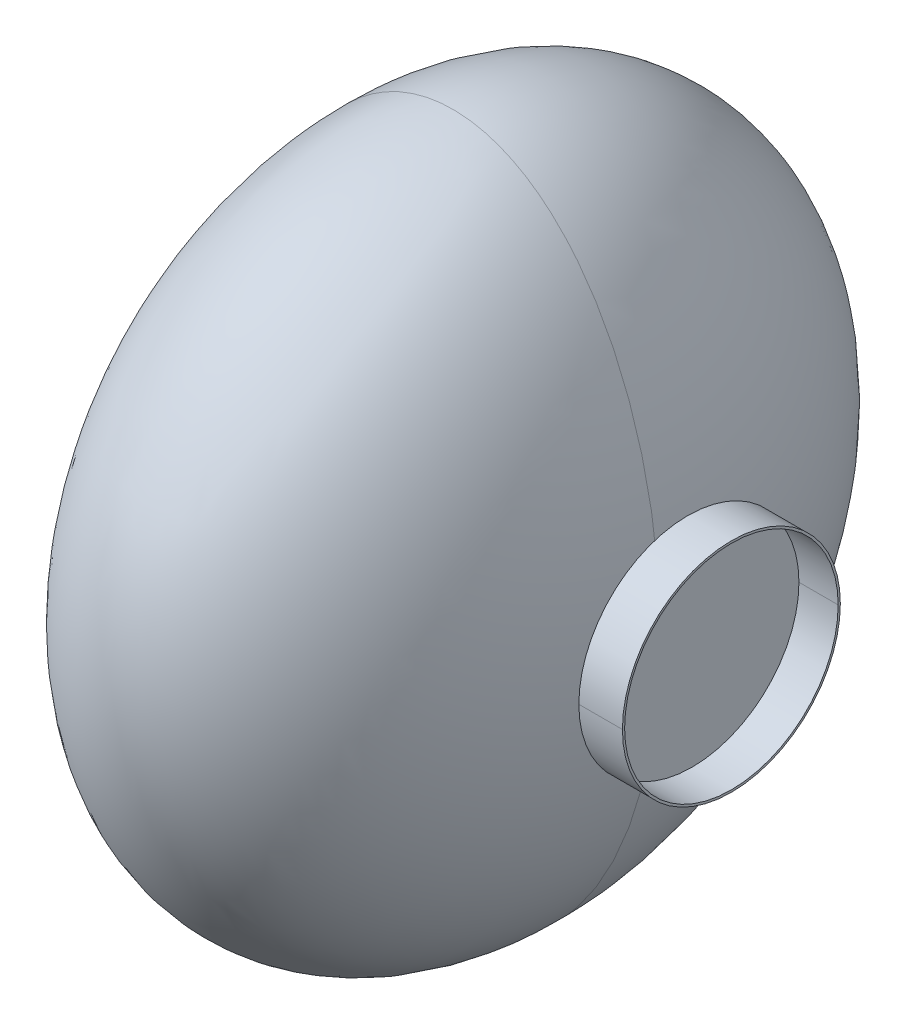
ISO-10303-21;
HEADER;
FILE_DESCRIPTION(('STEP AP214'),'2;1');
FILE_NAME('part.step','',(''),(''),'','','');
FILE_SCHEMA(('AUTOMOTIVE_DESIGN { 1 0 10303 214 1 1 1 1 }'));
ENDSEC;
DATA;
#1=APPLICATION_CONTEXT('core data for automotive mechanical design processes');
#2=APPLICATION_PROTOCOL_DEFINITION('international standard','automotive_design',2000,#1);
#3=PRODUCT_CONTEXT('',#1,'mechanical');
#4=PRODUCT('Part','Part','',(#3));
#5=PRODUCT_RELATED_PRODUCT_CATEGORY('part','',(#4));
#6=PRODUCT_DEFINITION_FORMATION('','',#4);
#7=PRODUCT_DEFINITION_CONTEXT('part definition',#1,'design');
#8=PRODUCT_DEFINITION('design','',#6,#7);
#9=PRODUCT_DEFINITION_SHAPE('','',#8);
#10=(LENGTH_UNIT() NAMED_UNIT(*) SI_UNIT(.MILLI.,.METRE.));
#11=(NAMED_UNIT(*) PLANE_ANGLE_UNIT() SI_UNIT($,.RADIAN.));
#12=(NAMED_UNIT(*) SI_UNIT($,.STERADIAN.) SOLID_ANGLE_UNIT());
#13=UNCERTAINTY_MEASURE_WITH_UNIT(LENGTH_MEASURE(1.E-05),#10,'distance_accuracy_value','');
#14=(GEOMETRIC_REPRESENTATION_CONTEXT(3) GLOBAL_UNCERTAINTY_ASSIGNED_CONTEXT((#13)) GLOBAL_UNIT_ASSIGNED_CONTEXT((#10,
#11,#12)) REPRESENTATION_CONTEXT('',''));
#15=CARTESIAN_POINT('',(0.,0.,0.));
#16=DIRECTION('',(0.,0.,1.));
#17=DIRECTION('',(1.,0.,0.));
#18=AXIS2_PLACEMENT_3D('',#15,#16,#17);
#19=CARTESIAN_POINT('',(84.448388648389,-3.01474610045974,0.));
#20=CARTESIAN_POINT('',(84.448388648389,-3.01474610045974,0.));
#21=CARTESIAN_POINT('',(84.448388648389,-3.01474610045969,0.));
#22=CARTESIAN_POINT('',(84.448388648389,-3.01474610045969,0.));
#23=CARTESIAN_POINT('',(84.448388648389,7.17361340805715,0.));
#24=CARTESIAN_POINT('',(84.448388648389,7.17361340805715,-20.3767190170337));
#25=CARTESIAN_POINT('',(84.4483886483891,-13.2031056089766,-20.3767190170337));
#26=CARTESIAN_POINT('',(84.448388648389,-13.2031056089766,0.));
#27=CARTESIAN_POINT('',(83.8801880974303,17.3617183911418,0.));
#28=CARTESIAN_POINT('',(83.8801880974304,17.3617183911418,-40.752928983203));
#29=CARTESIAN_POINT('',(83.8801880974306,-23.3912105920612,-40.752928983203));
#30=CARTESIAN_POINT('',(83.8801880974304,-23.3912105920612,0.));
#31=CARTESIAN_POINT('',(81.6242336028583,37.3760403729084,0.));
#32=CARTESIAN_POINT('',(81.6242336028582,37.3760403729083,-80.7815729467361));
#33=CARTESIAN_POINT('',(81.6242336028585,-43.4055325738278,-80.7815729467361));
#34=CARTESIAN_POINT('',(81.6242336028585,-43.4055325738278,0.));
#35=CARTESIAN_POINT('',(79.9366284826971,47.2017786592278,0.));
#36=CARTESIAN_POINT('',(79.9366284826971,47.2017786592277,-100.433049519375));
#37=CARTESIAN_POINT('',(79.9366284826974,-53.2312708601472,-100.433049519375));
#38=CARTESIAN_POINT('',(79.9366284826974,-53.2312708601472,0.));
#39=CARTESIAN_POINT('',(75.4904976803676,66.1439715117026,0.));
#40=CARTESIAN_POINT('',(75.4904976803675,66.1439715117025,-138.317435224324));
#41=CARTESIAN_POINT('',(75.490497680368,-72.1734637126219,-138.317435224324));
#42=CARTESIAN_POINT('',(75.490497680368,-72.173463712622,0.));
#43=CARTESIAN_POINT('',(72.7322887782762,75.2600716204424,0.));
#44=CARTESIAN_POINT('',(72.7322887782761,75.2600716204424,-156.549635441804));
#45=CARTESIAN_POINT('',(72.7322887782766,-81.2895638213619,-156.549635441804));
#46=CARTESIAN_POINT('',(72.7322887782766,-81.289563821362,0.));
#47=CARTESIAN_POINT('',(66.2184612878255,92.4635394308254,0.));
#48=CARTESIAN_POINT('',(66.2184612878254,92.4635394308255,-190.95657106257));
#49=CARTESIAN_POINT('',(66.218461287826,-98.493031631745,-190.95657106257));
#50=CARTESIAN_POINT('',(66.2184612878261,-98.493031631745,0.));
#51=CARTESIAN_POINT('',(62.463301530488,100.550900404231,0.));
#52=CARTESIAN_POINT('',(62.4633015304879,100.550900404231,-207.131293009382));
#53=CARTESIAN_POINT('',(62.4633015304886,-106.580392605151,-207.131293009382));
#54=CARTESIAN_POINT('',(62.4633015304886,-106.580392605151,0.));
#55=CARTESIAN_POINT('',(54.0420722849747,115.411893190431,0.));
#56=CARTESIAN_POINT('',(54.0420722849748,115.411893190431,-236.853278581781));
#57=CARTESIAN_POINT('',(54.0420722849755,-121.44138539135,-236.853278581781));
#58=CARTESIAN_POINT('',(54.0420722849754,-121.44138539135,0.));
#59=CARTESIAN_POINT('',(49.3762028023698,122.186326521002,0.));
#60=CARTESIAN_POINT('',(49.3762028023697,122.186326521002,-250.402145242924));
#61=CARTESIAN_POINT('',(49.3762028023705,-128.215818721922,-250.402145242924));
#62=CARTESIAN_POINT('',(49.3762028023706,-128.215818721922,0.));
#63=CARTESIAN_POINT('',(39.2207683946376,134.160992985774,0.));
#64=CARTESIAN_POINT('',(39.2207683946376,134.160992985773,-274.351478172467));
#65=CARTESIAN_POINT('',(39.2207683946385,-140.190485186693,-274.351478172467));
#66=CARTESIAN_POINT('',(39.2207683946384,-140.190485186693,0.));
#67=CARTESIAN_POINT('',(33.7294389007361,139.362907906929,0.));
#68=CARTESIAN_POINT('',(33.7294389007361,139.362907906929,-284.755308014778));
#69=CARTESIAN_POINT('',(33.729438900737,-145.392400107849,-284.755308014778));
#70=CARTESIAN_POINT('',(33.729438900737,-145.392400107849,0.));
#71=CARTESIAN_POINT('',(24.9517962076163,145.779058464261,0.));
#72=CARTESIAN_POINT('',(24.9517962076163,145.779058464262,-297.587609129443));
#73=CARTESIAN_POINT('',(24.9517962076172,-151.808550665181,-297.587609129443));
#74=CARTESIAN_POINT('',(24.9517962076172,-151.808550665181,0.));
#75=CARTESIAN_POINT('',(21.9360752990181,147.686290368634,0.));
#76=CARTESIAN_POINT('',(21.9360752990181,147.686290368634,-301.402072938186));
#77=CARTESIAN_POINT('',(21.936075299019,-153.715782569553,-301.402072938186));
#78=CARTESIAN_POINT('',(21.9360752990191,-153.715782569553,0.));
#79=CARTESIAN_POINT('',(15.7480911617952,150.998827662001,0.));
#80=CARTESIAN_POINT('',(15.7480911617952,150.998827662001,-308.027147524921));
#81=CARTESIAN_POINT('',(15.7480911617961,-157.02831986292,-308.027147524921));
#82=CARTESIAN_POINT('',(15.7480911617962,-157.02831986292,0.));
#83=CARTESIAN_POINT('',(12.5756507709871,152.403943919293,0.));
#84=CARTESIAN_POINT('',(12.5756507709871,152.403943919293,-310.837380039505));
#85=CARTESIAN_POINT('',(12.575650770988,-158.433436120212,-310.837380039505));
#86=CARTESIAN_POINT('',(12.5756507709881,-158.433436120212,0.));
#87=CARTESIAN_POINT('',(6.11066565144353,154.67329479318,0.));
#88=CARTESIAN_POINT('',(6.11066565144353,154.67329479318,-315.376081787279));
#89=CARTESIAN_POINT('',(6.11066565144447,-160.7027869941,-315.376081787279));
#90=CARTESIAN_POINT('',(6.11066565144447,-160.702786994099,0.));
#91=CARTESIAN_POINT('',(2.81812227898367,155.537191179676,0.));
#92=CARTESIAN_POINT('',(2.81812227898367,155.537191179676,-317.103874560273));
#93=CARTESIAN_POINT('',(2.81812227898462,-161.566683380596,-317.103874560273));
#94=CARTESIAN_POINT('',(2.81812227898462,-161.566683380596,0.));
#95=CARTESIAN_POINT('',(-3.83360985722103,156.693317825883,0.));
#96=CARTESIAN_POINT('',(-3.83360985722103,156.693317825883,-319.416127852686));
#97=CARTESIAN_POINT('',(-3.83360985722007,-162.722810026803,-319.416127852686));
#98=CARTESIAN_POINT('',(-3.83360985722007,-162.722810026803,0.));
#99=CARTESIAN_POINT('',(-7.19249420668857,156.98525389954,0.));
#100=CARTESIAN_POINT('',(-7.19249420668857,156.98525389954,-320.));
#101=CARTESIAN_POINT('',(-7.19249420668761,-163.01474610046,-320.));
#102=CARTESIAN_POINT('',(-7.19249420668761,-163.01474610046,0.));
#103=CARTESIAN_POINT('',(-13.9107284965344,156.98525389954,0.));
#104=CARTESIAN_POINT('',(-13.9107284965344,156.98525389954,-320.000000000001));
#105=CARTESIAN_POINT('',(-13.9107284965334,-163.01474610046,-320.000000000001));
#106=CARTESIAN_POINT('',(-13.9107284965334,-163.01474610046,0.));
#107=CARTESIAN_POINT('',(-17.2696128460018,156.693317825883,0.));
#108=CARTESIAN_POINT('',(-17.2696128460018,156.693317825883,-319.416127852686));
#109=CARTESIAN_POINT('',(-17.2696128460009,-162.722810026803,-319.416127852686));
#110=CARTESIAN_POINT('',(-17.2696128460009,-162.722810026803,0.));
#111=CARTESIAN_POINT('',(-23.9213449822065,155.537191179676,0.));
#112=CARTESIAN_POINT('',(-23.9213449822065,155.537191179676,-317.103874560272));
#113=CARTESIAN_POINT('',(-23.9213449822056,-161.566683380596,-317.103874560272));
#114=CARTESIAN_POINT('',(-23.9213449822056,-161.566683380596,0.));
#115=CARTESIAN_POINT('',(-27.2138883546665,154.673294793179,0.));
#116=CARTESIAN_POINT('',(-27.2138883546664,154.67329479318,-315.37608178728));
#117=CARTESIAN_POINT('',(-27.2138883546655,-160.7027869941,-315.37608178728));
#118=CARTESIAN_POINT('',(-27.2138883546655,-160.7027869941,0.));
#119=CARTESIAN_POINT('',(-33.67887347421,152.403943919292,0.));
#120=CARTESIAN_POINT('',(-33.67887347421,152.403943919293,-310.837380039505));
#121=CARTESIAN_POINT('',(-33.6788734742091,-158.433436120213,-310.837380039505));
#122=CARTESIAN_POINT('',(-33.6788734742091,-158.433436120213,0.));
#123=CARTESIAN_POINT('',(-36.851313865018,150.998827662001,0.));
#124=CARTESIAN_POINT('',(-36.851313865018,150.998827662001,-308.027147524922));
#125=CARTESIAN_POINT('',(-36.8513138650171,-157.028319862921,-308.027147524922));
#126=CARTESIAN_POINT('',(-36.8513138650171,-157.028319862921,0.));
#127=CARTESIAN_POINT('',(-43.039298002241,147.686290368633,0.));
#128=CARTESIAN_POINT('',(-43.0392980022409,147.686290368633,-301.402072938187));
#129=CARTESIAN_POINT('',(-43.03929800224,-153.715782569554,-301.402072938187));
#130=CARTESIAN_POINT('',(-43.0392980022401,-153.715782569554,0.));
#131=CARTESIAN_POINT('',(-46.0550189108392,145.779058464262,0.));
#132=CARTESIAN_POINT('',(-46.0550189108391,145.779058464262,-297.587609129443));
#133=CARTESIAN_POINT('',(-46.0550189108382,-151.808550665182,-297.587609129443));
#134=CARTESIAN_POINT('',(-46.0550189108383,-151.808550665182,0.));
#135=CARTESIAN_POINT('',(-54.832661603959,139.362907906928,0.));
#136=CARTESIAN_POINT('',(-54.8326616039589,139.362907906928,-284.755308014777));
#137=CARTESIAN_POINT('',(-54.8326616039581,-145.392400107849,-284.755308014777));
#138=CARTESIAN_POINT('',(-54.8326616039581,-145.392400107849,0.));
#139=CARTESIAN_POINT('',(-60.3239910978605,134.160992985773,0.));
#140=CARTESIAN_POINT('',(-60.3239910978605,134.160992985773,-274.351478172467));
#141=CARTESIAN_POINT('',(-60.3239910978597,-140.190485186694,-274.351478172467));
#142=CARTESIAN_POINT('',(-60.3239910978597,-140.190485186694,0.));
#143=CARTESIAN_POINT('',(-70.4794255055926,122.186326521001,0.));
#144=CARTESIAN_POINT('',(-70.4794255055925,122.186326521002,-250.402145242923));
#145=CARTESIAN_POINT('',(-70.4794255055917,-128.215818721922,-250.402145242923));
#146=CARTESIAN_POINT('',(-70.4794255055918,-128.215818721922,0.));
#147=CARTESIAN_POINT('',(-75.1452949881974,115.411893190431,0.));
#148=CARTESIAN_POINT('',(-75.1452949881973,115.411893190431,-236.853278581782));
#149=CARTESIAN_POINT('',(-75.1452949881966,-121.441385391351,-236.853278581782));
#150=CARTESIAN_POINT('',(-75.1452949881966,-121.441385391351,0.));
#151=CARTESIAN_POINT('',(-83.5665242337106,100.550900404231,0.));
#152=CARTESIAN_POINT('',(-83.5665242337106,100.550900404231,-207.131293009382));
#153=CARTESIAN_POINT('',(-83.56652423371,-106.580392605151,-207.131293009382));
#154=CARTESIAN_POINT('',(-83.56652423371,-106.580392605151,0.));
#155=CARTESIAN_POINT('',(-87.3216839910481,92.4635394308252,0.));
#156=CARTESIAN_POINT('',(-87.321683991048,92.4635394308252,-190.956571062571));
#157=CARTESIAN_POINT('',(-87.3216839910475,-98.4930316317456,-190.956571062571));
#158=CARTESIAN_POINT('',(-87.3216839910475,-98.4930316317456,0.));
#159=CARTESIAN_POINT('',(-93.8355114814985,75.2600716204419,0.));
#160=CARTESIAN_POINT('',(-93.8355114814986,75.2600716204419,-156.549635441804));
#161=CARTESIAN_POINT('',(-93.8355114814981,-81.2895638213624,-156.549635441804));
#162=CARTESIAN_POINT('',(-93.8355114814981,-81.2895638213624,0.));
#163=CARTESIAN_POINT('',(-96.5937203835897,66.1439715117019,0.));
#164=CARTESIAN_POINT('',(-96.5937203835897,66.1439715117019,-138.317435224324));
#165=CARTESIAN_POINT('',(-96.5937203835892,-72.1734637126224,-138.317435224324));
#166=CARTESIAN_POINT('',(-96.5937203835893,-72.1734637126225,0.));
#167=CARTESIAN_POINT('',(-101.039851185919,47.2017786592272,0.));
#168=CARTESIAN_POINT('',(-101.039851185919,47.2017786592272,-100.433049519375));
#169=CARTESIAN_POINT('',(-101.039851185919,-53.2312708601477,-100.433049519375));
#170=CARTESIAN_POINT('',(-101.039851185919,-53.2312708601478,0.));
#171=CARTESIAN_POINT('',(-102.72745630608,37.376040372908,0.));
#172=CARTESIAN_POINT('',(-102.72745630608,37.3760403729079,-80.7815729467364));
#173=CARTESIAN_POINT('',(-102.72745630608,-43.4055325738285,-80.7815729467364));
#174=CARTESIAN_POINT('',(-102.72745630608,-43.4055325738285,0.));
#175=CARTESIAN_POINT('',(-104.983410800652,17.3617183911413,0.));
#176=CARTESIAN_POINT('',(-104.983410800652,17.3617183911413,-40.7529289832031));
#177=CARTESIAN_POINT('',(-104.983410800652,-23.3912105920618,-40.7529289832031));
#178=CARTESIAN_POINT('',(-104.983410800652,-23.3912105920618,0.));
#179=CARTESIAN_POINT('',(-105.551611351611,7.17361340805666,0.));
#180=CARTESIAN_POINT('',(-105.551611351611,7.17361340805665,-20.3767190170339));
#181=CARTESIAN_POINT('',(-105.551611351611,-13.2031056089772,-20.3767190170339));
#182=CARTESIAN_POINT('',(-105.551611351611,-13.2031056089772,0.));
#183=CARTESIAN_POINT('',(-105.551611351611,-3.01474610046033,0.));
#184=CARTESIAN_POINT('',(-105.551611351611,-3.01474610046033,0.));
#185=CARTESIAN_POINT('',(-105.551611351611,-3.01474610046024,0.));
#186=CARTESIAN_POINT('',(-105.551611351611,-3.01474610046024,0.));
#187=(BOUNDED_SURFACE() B_SPLINE_SURFACE(3,3,((#19,#20,#21,#22),(#23,#24,#25,#26),(#27,#28,#29,
#30),(#31,#32,#33,#34),(#35,#36,#37,#38),(#39,#40,#41,#42),(#43,#44,#45,#46),(#47,#48,#49,#50),
(#51,#52,#53,#54),(#55,#56,#57,#58),(#59,#60,#61,#62),(#63,#64,#65,#66),(#67,#68,#69,#70),(#71,
#72,#73,#74),(#75,#76,#77,#78),(#79,#80,#81,#82),(#83,#84,#85,#86),(#87,#88,#89,#90),(#91,#92,
#93,#94),(#95,#96,#97,#98),(#99,#100,#101,#102),(#103,#104,#105,#106),(#107,#108,#109,#110),
(#111,#112,#113,#114),(#115,#116,#117,#118),(#119,#120,#121,#122),(#123,#124,#125,#126),(#127,
#128,#129,#130),(#131,#132,#133,#134),(#135,#136,#137,#138),(#139,#140,#141,#142),(#143,#144,
#145,#146),(#147,#148,#149,#150),(#151,#152,#153,#154),(#155,#156,#157,#158),(#159,#160,#161,
#162),(#163,#164,#165,#166),(#167,#168,#169,#170),(#171,#172,#173,#174),(#175,#176,#177,#178),
(#179,#180,#181,#182),(#183,#184,#185,#186)),.UNSPECIFIED.,.F.,.F.,
.F.) B_SPLINE_SURFACE_WITH_KNOTS((4,2,2,2,2,2,2,2,2,2,2,2,2,2,2,2,2,2,2,2,4),(4,4),(0.,0.0625,
0.125,0.1875,0.25,0.3125,0.375,0.40625,0.4375,0.46875,0.5,0.53125,0.5625,0.59375,0.625,0.6875,
0.75,0.8125,0.875,0.9375,1.),(0.,1.),
.UNSPECIFIED.) GEOMETRIC_REPRESENTATION_ITEM() RATIONAL_B_SPLINE_SURFACE(((1.,0.333333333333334,
0.333333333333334,1.),(1.,0.333333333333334,0.333333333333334,1.),(1.,0.333333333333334,
0.333333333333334,1.),(1.,0.333333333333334,0.333333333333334,1.),(1.,0.333333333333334,
0.333333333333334,1.),(1.,0.333333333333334,0.333333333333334,1.),(1.,0.333333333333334,
0.333333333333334,1.),(1.,0.333333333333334,0.333333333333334,1.),(1.,0.333333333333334,
0.333333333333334,1.),(1.,0.333333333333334,0.333333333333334,1.),(1.,0.333333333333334,
0.333333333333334,1.),(1.,0.333333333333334,0.333333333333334,1.),(1.,0.333333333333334,
0.333333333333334,1.),(1.,0.333333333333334,0.333333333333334,1.),(1.,0.333333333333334,
0.333333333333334,1.),(1.,0.333333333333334,0.333333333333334,1.),(1.,0.333333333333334,
0.333333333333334,1.),(1.,0.333333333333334,0.333333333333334,1.),(1.,0.333333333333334,
0.333333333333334,1.),(1.,0.333333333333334,0.333333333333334,1.),(1.,0.333333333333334,
0.333333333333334,1.),(1.,0.333333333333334,0.333333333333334,1.),(1.,0.333333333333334,
0.333333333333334,1.),(1.,0.333333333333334,0.333333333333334,1.),(1.,0.333333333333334,
0.333333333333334,1.),(1.,0.333333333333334,0.333333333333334,1.),(1.,0.333333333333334,
0.333333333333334,1.),(1.,0.333333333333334,0.333333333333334,1.),(1.,0.333333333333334,
0.333333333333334,1.),(1.,0.333333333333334,0.333333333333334,1.),(1.,0.333333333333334,
0.333333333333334,1.),(1.,0.333333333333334,0.333333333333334,1.),(1.,0.333333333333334,
0.333333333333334,1.),(1.,0.333333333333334,0.333333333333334,1.),(1.,0.333333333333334,
0.333333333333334,1.),(1.,0.333333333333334,0.333333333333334,1.),(1.,0.333333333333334,
0.333333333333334,1.),(1.,0.333333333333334,0.333333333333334,1.),(1.,0.333333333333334,
0.333333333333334,1.),(1.,0.333333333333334,0.333333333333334,1.),(1.,0.333333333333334,
0.333333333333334,1.),(1.,0.333333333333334,0.333333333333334,1.))) REPRESENTATION_ITEM('') SURFACE());
#188=CARTESIAN_POINT('',(84.448388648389,-3.01474610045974,0.));
#189=CARTESIAN_POINT('',(84.448388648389,-13.2031056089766,0.));
#190=CARTESIAN_POINT('',(83.8801880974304,-23.3912105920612,0.));
#191=CARTESIAN_POINT('',(81.6242336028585,-43.4055325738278,0.));
#192=CARTESIAN_POINT('',(79.9366284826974,-53.2312708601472,0.));
#193=CARTESIAN_POINT('',(75.490497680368,-72.173463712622,0.));
#194=CARTESIAN_POINT('',(72.7322887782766,-81.289563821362,0.));
#195=CARTESIAN_POINT('',(66.2184612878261,-98.493031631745,0.));
#196=CARTESIAN_POINT('',(62.4633015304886,-106.580392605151,0.));
#197=CARTESIAN_POINT('',(54.0420722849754,-121.44138539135,0.));
#198=CARTESIAN_POINT('',(49.3762028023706,-128.215818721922,0.));
#199=CARTESIAN_POINT('',(39.2207683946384,-140.190485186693,0.));
#200=CARTESIAN_POINT('',(33.729438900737,-145.392400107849,0.));
#201=CARTESIAN_POINT('',(24.9517962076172,-151.808550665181,0.));
#202=CARTESIAN_POINT('',(21.9360752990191,-153.715782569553,0.));
#203=CARTESIAN_POINT('',(15.7480911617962,-157.02831986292,0.));
#204=CARTESIAN_POINT('',(12.5756507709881,-158.433436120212,0.));
#205=CARTESIAN_POINT('',(6.11066565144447,-160.702786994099,0.));
#206=CARTESIAN_POINT('',(2.81812227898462,-161.566683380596,0.));
#207=CARTESIAN_POINT('',(-3.83360985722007,-162.722810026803,0.));
#208=CARTESIAN_POINT('',(-7.19249420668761,-163.01474610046,0.));
#209=CARTESIAN_POINT('',(-13.9107284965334,-163.01474610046,0.));
#210=CARTESIAN_POINT('',(-17.2696128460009,-162.722810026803,0.));
#211=CARTESIAN_POINT('',(-23.9213449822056,-161.566683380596,0.));
#212=CARTESIAN_POINT('',(-27.2138883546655,-160.7027869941,0.));
#213=CARTESIAN_POINT('',(-33.6788734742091,-158.433436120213,0.));
#214=CARTESIAN_POINT('',(-36.8513138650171,-157.028319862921,0.));
#215=CARTESIAN_POINT('',(-43.0392980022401,-153.715782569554,0.));
#216=CARTESIAN_POINT('',(-46.0550189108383,-151.808550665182,0.));
#217=CARTESIAN_POINT('',(-54.8326616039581,-145.392400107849,0.));
#218=CARTESIAN_POINT('',(-60.3239910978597,-140.190485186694,0.));
#219=CARTESIAN_POINT('',(-70.4794255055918,-128.215818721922,0.));
#220=CARTESIAN_POINT('',(-75.1452949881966,-121.441385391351,0.));
#221=CARTESIAN_POINT('',(-83.56652423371,-106.580392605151,0.));
#222=CARTESIAN_POINT('',(-87.3216839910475,-98.4930316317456,0.));
#223=CARTESIAN_POINT('',(-93.8355114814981,-81.2895638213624,0.));
#224=CARTESIAN_POINT('',(-96.5937203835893,-72.1734637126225,0.));
#225=CARTESIAN_POINT('',(-101.039851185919,-53.2312708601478,0.));
#226=CARTESIAN_POINT('',(-102.72745630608,-43.4055325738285,0.));
#227=CARTESIAN_POINT('',(-104.983410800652,-23.3912105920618,0.));
#228=CARTESIAN_POINT('',(-105.551611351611,-13.2031056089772,0.));
#229=CARTESIAN_POINT('',(-105.551611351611,-3.01474610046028,0.));
#230=(BOUNDED_CURVE() B_SPLINE_CURVE(3,(#188,#189,#190,#191,#192,#193,#194,#195,#196,#197,#198,
#199,#200,#201,#202,#203,#204,#205,#206,#207,#208,#209,#210,#211,#212,#213,#214,#215,#216,#217,
#218,#219,#220,#221,#222,#223,#224,#225,#226,#227,#228,#229),.UNSPECIFIED.,.F.,
.F.) B_SPLINE_CURVE_WITH_KNOTS((4,2,2,2,2,2,2,2,2,2,2,2,2,2,2,2,2,2,2,2,4),(0.,0.0625,0.125,
0.1875,0.25,0.3125,0.375,0.40625,0.4375,0.46875,0.5,0.53125,0.5625,0.59375,0.625,0.6875,0.75,
0.8125,0.875,0.9375,1.),
.UNSPECIFIED.) CURVE() GEOMETRIC_REPRESENTATION_ITEM() RATIONAL_B_SPLINE_CURVE((1.,1.,1.,1.,1.,
1.,1.,1.,1.,1.,1.,1.,1.,1.,1.,1.,1.,1.,1.,1.,1.,1.,1.,1.,1.,1.,1.,1.,1.,1.,1.,1.,1.,1.,1.,1.,1.,
1.,1.,1.,1.,1.)) REPRESENTATION_ITEM(''));
#231=CARTESIAN_POINT('',(84.448388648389,-3.01474610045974,0.));
#232=VERTEX_POINT('',#231);
#233=CARTESIAN_POINT('',(-103.772677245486,-34.1235512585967,0.));
#234=VERTEX_POINT('',#233);
#235=EDGE_CURVE('P0_E114',#232,#234,#230,.T.);
#236=CARTESIAN_POINT('',(-103.772677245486,-34.1235512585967,0.));
#237=CARTESIAN_POINT('',(-103.766935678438,-34.1732711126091,-0.579151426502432));
#238=CARTESIAN_POINT('',(-103.761193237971,-34.2066652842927,-1.15970100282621));
#239=CARTESIAN_POINT('',(-103.749725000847,-34.2407768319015,-2.32173230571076));
#240=CARTESIAN_POINT('',(-103.743999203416,-34.2414957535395,-2.90321398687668));
#241=CARTESIAN_POINT('',(-103.732582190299,-34.2102363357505,-4.06529093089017));
#242=CARTESIAN_POINT('',(-103.726890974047,-34.1782585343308,-4.64588620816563));
#243=CARTESIAN_POINT('',(-103.715565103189,-34.0817493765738,-5.80394940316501));
#244=CARTESIAN_POINT('',(-103.709930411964,-34.0172407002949,-6.38141921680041));
#245=CARTESIAN_POINT('',(-103.698731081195,-33.8558756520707,-7.53184870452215));
#246=CARTESIAN_POINT('',(-103.693166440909,-33.7590196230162,-8.10480842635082));
#247=CARTESIAN_POINT('',(-103.684886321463,-33.5897300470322,-8.95939599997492));
#248=CARTESIAN_POINT('',(-103.682137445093,-33.529299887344,-9.24344744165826));
#249=CARTESIAN_POINT('',(-103.676663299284,-33.4004720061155,-9.8097962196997));
#250=CARTESIAN_POINT('',(-103.673938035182,-33.3320725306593,-10.0920931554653));
#251=CARTESIAN_POINT('',(-103.663088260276,-33.0426128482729,-11.2173551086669));
#252=CARTESIAN_POINT('',(-103.655066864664,-32.7898412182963,-12.0524114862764));
#253=CARTESIAN_POINT('',(-103.639317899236,-32.2147924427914,-13.6983259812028));
#254=CARTESIAN_POINT('',(-103.631590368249,-31.8925061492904,-14.5091808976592));
#255=CARTESIAN_POINT('',(-103.620263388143,-31.35882037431,-15.702720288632));
#256=CARTESIAN_POINT('',(-103.616531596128,-31.1725382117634,-16.0967958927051));
#257=CARTESIAN_POINT('',(-103.609162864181,-30.783570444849,-16.8766563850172));
#258=CARTESIAN_POINT('',(-103.605525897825,-30.580889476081,-17.2624435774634));
#259=CARTESIAN_POINT('',(-103.598352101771,-30.1594224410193,-18.0251701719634));
#260=CARTESIAN_POINT('',(-103.594815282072,-29.9406347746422,-18.4021086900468));
#261=CARTESIAN_POINT('',(-103.587848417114,-29.4873654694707,-19.1464344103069));
#262=CARTESIAN_POINT('',(-103.584418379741,-29.2528826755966,-19.5138209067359));
#263=CARTESIAN_POINT('',(-103.574298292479,-28.5265304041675,-20.6006060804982));
#264=CARTESIAN_POINT('',(-103.567776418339,-28.0116483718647,-21.3048270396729));
#265=CARTESIAN_POINT('',(-103.555232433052,-26.9244563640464,-22.6672985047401));
#266=CARTESIAN_POINT('',(-103.54921032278,-26.3521462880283,-23.3255489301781));
#267=CARTESIAN_POINT('',(-103.537706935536,-25.1539978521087,-24.5916237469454));
#268=CARTESIAN_POINT('',(-103.532225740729,-24.5281513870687,-25.1994404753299));
#269=CARTESIAN_POINT('',(-103.521844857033,-23.2274760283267,-26.3601784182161));
#270=CARTESIAN_POINT('',(-103.516945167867,-22.5526471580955,-26.9130996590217));
#271=CARTESIAN_POINT('',(-103.507762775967,-21.1588624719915,-27.9600763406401));
#272=CARTESIAN_POINT('',(-103.503480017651,-20.4399106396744,-28.4541370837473));
#273=CARTESIAN_POINT('',(-103.495561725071,-18.9629380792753,-29.3799345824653));
#274=CARTESIAN_POINT('',(-103.491926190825,-18.2049173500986,-29.8116713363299));
#275=CARTESIAN_POINT('',(-103.485328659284,-16.6552461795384,-30.6097252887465));
#276=CARTESIAN_POINT('',(-103.482366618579,-15.8635979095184,-30.976046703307));
#277=CARTESIAN_POINT('',(-103.477137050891,-14.2522542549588,-31.6406990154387));
#278=CARTESIAN_POINT('',(-103.47486952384,-13.4325588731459,-31.9390299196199));
#279=CARTESIAN_POINT('',(-103.471045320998,-11.7709690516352,-32.4655733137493));
#280=CARTESIAN_POINT('',(-103.469488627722,-10.9290751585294,-32.6937875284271));
#281=CARTESIAN_POINT('',(-103.467097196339,-9.22905428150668,-33.0784846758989));
#282=CARTESIAN_POINT('',(-103.466262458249,-8.37092729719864,-33.2349676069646));
#283=CARTESIAN_POINT('',(-103.465320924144,-6.64451871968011,-33.4750925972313));
#284=CARTESIAN_POINT('',(-103.465214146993,-5.77623686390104,-33.5587327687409));
#285=CARTESIAN_POINT('',(-103.465729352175,-4.03571381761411,-33.652570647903));
#286=CARTESIAN_POINT('',(-103.466351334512,-3.16347262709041,-33.6627683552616));
#287=CARTESIAN_POINT('',(-103.468319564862,-1.42125324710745,-33.6096495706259));
#288=CARTESIAN_POINT('',(-103.46966579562,-0.551275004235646,-33.5463348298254));
#289=CARTESIAN_POINT('',(-103.473072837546,1.18025422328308,-33.3466444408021));
#290=CARTESIAN_POINT('',(-103.47513364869,2.0418052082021,-33.2102687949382));
#291=CARTESIAN_POINT('',(-103.479954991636,3.75033592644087,-32.8654303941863));
#292=CARTESIAN_POINT('',(-103.482715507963,4.59731598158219,-32.6569692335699));
#293=CARTESIAN_POINT('',(-103.48891645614,6.27070327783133,-32.1694416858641));
#294=CARTESIAN_POINT('',(-103.492356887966,7.09711051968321,-31.8903753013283));
#295=CARTESIAN_POINT('',(-103.499892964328,8.72347744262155,-31.2636218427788));
#296=CARTESIAN_POINT('',(-103.503988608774,9.52343712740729,-30.9159347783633));
#297=CARTESIAN_POINT('',(-103.512805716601,11.0912227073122,-30.1544122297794));
#298=CARTESIAN_POINT('',(-103.517527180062,11.8590485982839,-29.7405767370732));
#299=CARTESIAN_POINT('',(-103.5275622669,13.3571401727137,-28.849681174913));
#300=CARTESIAN_POINT('',(-103.532875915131,14.0874042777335,-28.3726184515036));
#301=CARTESIAN_POINT('',(-103.544057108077,15.5051463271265,-27.3586742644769));
#302=CARTESIAN_POINT('',(-103.54992465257,16.1926242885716,-26.8217928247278));
#303=CARTESIAN_POINT('',(-103.562171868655,17.5199374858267,-25.6920030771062));
#304=CARTESIAN_POINT('',(-103.568551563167,18.159770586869,-25.0990922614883));
#305=CARTESIAN_POINT('',(-103.581777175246,19.3872131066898,-23.8614786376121));
#306=CARTESIAN_POINT('',(-103.588623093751,19.9748224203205,-23.21677572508));
#307=CARTESIAN_POINT('',(-103.60273175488,21.0936080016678,-21.8802002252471));
#308=CARTESIAN_POINT('',(-103.609994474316,21.6247874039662,-21.1883302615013));
#309=CARTESIAN_POINT('',(-103.62488509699,22.6269713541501,-19.762312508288));
#310=CARTESIAN_POINT('',(-103.632512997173,23.0979764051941,-19.0281650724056));
#311=CARTESIAN_POINT('',(-103.648080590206,23.9765299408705,-17.5227043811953));
#312=CARTESIAN_POINT('',(-103.656020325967,24.384069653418,-16.7513860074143));
#313=CARTESIAN_POINT('',(-103.672154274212,25.1327311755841,-15.1771253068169));
#314=CARTESIAN_POINT('',(-103.680348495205,25.4738507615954,-14.3741819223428));
#315=CARTESIAN_POINT('',(-103.696931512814,26.0871947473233,-12.7425219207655));
#316=CARTESIAN_POINT('',(-103.705320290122,26.3594259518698,-11.9138078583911));
#317=CARTESIAN_POINT('',(-103.722233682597,26.833090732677,-10.2363937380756));
#318=CARTESIAN_POINT('',(-103.73075828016,27.0345334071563,-9.38769626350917));
#319=CARTESIAN_POINT('',(-103.743999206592,27.2902473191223,-8.06444669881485));
#320=CARTESIAN_POINT('',(-103.748690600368,27.36984253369,-7.59464340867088));
#321=CARTESIAN_POINT('',(-103.758085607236,27.5072966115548,-6.65189309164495));
#322=CARTESIAN_POINT('',(-103.762789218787,27.5651580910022,-6.17894645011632));
#323=CARTESIAN_POINT('',(-103.772198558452,27.6590207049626,-5.23092473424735));
#324=CARTESIAN_POINT('',(-103.77690428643,27.6950230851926,-4.75584978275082));
#325=CARTESIAN_POINT('',(-103.786304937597,27.7450824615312,-3.80487715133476));
#326=CARTESIAN_POINT('',(-103.790999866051,27.7591548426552,-3.32898028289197));
#327=CARTESIAN_POINT('',(-103.800372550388,27.7653694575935,-2.37701273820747));
#328=CARTESIAN_POINT('',(-103.80505030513,27.7575102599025,-1.9009420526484));
#329=CARTESIAN_POINT('',(-103.814379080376,27.7198826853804,-0.949601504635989));
#330=CARTESIAN_POINT('',(-103.819030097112,27.6901112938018,-0.47433176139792));
#331=CARTESIAN_POINT('',(-103.823662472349,27.6493969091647,0.));
#332=B_SPLINE_CURVE_WITH_KNOTS('',3,(#236,#237,#238,#239,#240,#241,#242,#243,#244,#245,#246,
#247,#248,#249,#250,#251,#252,#253,#254,#255,#256,#257,#258,#259,#260,#261,#262,#263,#264,#265,
#266,#267,#268,#269,#270,#271,#272,#273,#274,#275,#276,#277,#278,#279,#280,#281,#282,#283,#284,
#285,#286,#287,#288,#289,#290,#291,#292,#293,#294,#295,#296,#297,#298,#299,#300,#301,#302,#303,
#304,#305,#306,#307,#308,#309,#310,#311,#312,#313,#314,#315,#316,#317,#318,#319,#320,#321,#322,
#323,#324,#325,#326,#327,#328,#329,#330,#331),.UNSPECIFIED.,.F.,.F.,(4,2,2,2,2,2,2,2,2,2,2,2,2,
2,2,2,2,2,2,2,2,2,2,2,2,2,2,2,2,2,2,2,2,2,2,2,2,2,2,2,2,2,2,2,2,2,2,4),(0.,1.74369517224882,
3.48730785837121,5.23089185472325,6.97326192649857,8.71561352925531,9.58677439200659,
10.4581273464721,13.0722736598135,15.6867641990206,16.9941436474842,18.3011548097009,
19.6082959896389,20.9155334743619,23.5293366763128,26.143144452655,28.7573486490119,
31.3715515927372,33.9855188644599,36.599486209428,39.2132850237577,41.8270835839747,
44.4408178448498,47.0545521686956,49.6683542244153,52.2821562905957,54.8958960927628,
57.5096358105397,60.1233177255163,62.7369995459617,65.3506810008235,67.96436279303,
70.578154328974,73.1919448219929,75.8058523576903,78.4197651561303,81.0335326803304,
83.6472783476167,86.261384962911,88.8755790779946,91.4895148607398,94.1031145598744,
95.5322486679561,96.9612106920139,98.3900912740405,99.8179689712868,101.245939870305,
102.674107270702),.UNSPECIFIED.);
#333=CARTESIAN_POINT('',(-103.823662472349,27.6493969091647,0.));
#334=VERTEX_POINT('',#333);
#335=EDGE_CURVE('P0_E89',#234,#334,#332,.T.);
#336=CARTESIAN_POINT('',(84.448388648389,-3.01474610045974,0.));
#337=CARTESIAN_POINT('',(84.448388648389,7.17361340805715,0.));
#338=CARTESIAN_POINT('',(83.8801880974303,17.3617183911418,0.));
#339=CARTESIAN_POINT('',(81.6242336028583,37.3760403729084,0.));
#340=CARTESIAN_POINT('',(79.9366284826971,47.2017786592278,0.));
#341=CARTESIAN_POINT('',(75.4904976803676,66.1439715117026,0.));
#342=CARTESIAN_POINT('',(72.7322887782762,75.2600716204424,0.));
#343=CARTESIAN_POINT('',(66.2184612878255,92.4635394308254,0.));
#344=CARTESIAN_POINT('',(62.463301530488,100.550900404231,0.));
#345=CARTESIAN_POINT('',(54.0420722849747,115.411893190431,0.));
#346=CARTESIAN_POINT('',(49.3762028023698,122.186326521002,0.));
#347=CARTESIAN_POINT('',(39.2207683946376,134.160992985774,0.));
#348=CARTESIAN_POINT('',(33.7294389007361,139.362907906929,0.));
#349=CARTESIAN_POINT('',(24.9517962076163,145.779058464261,0.));
#350=CARTESIAN_POINT('',(21.9360752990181,147.686290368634,0.));
#351=CARTESIAN_POINT('',(15.7480911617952,150.998827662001,0.));
#352=CARTESIAN_POINT('',(12.5756507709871,152.403943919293,0.));
#353=CARTESIAN_POINT('',(6.11066565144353,154.67329479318,0.));
#354=CARTESIAN_POINT('',(2.81812227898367,155.537191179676,0.));
#355=CARTESIAN_POINT('',(-3.83360985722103,156.693317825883,0.));
#356=CARTESIAN_POINT('',(-7.19249420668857,156.98525389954,0.));
#357=CARTESIAN_POINT('',(-13.9107284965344,156.98525389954,0.));
#358=CARTESIAN_POINT('',(-17.2696128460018,156.693317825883,0.));
#359=CARTESIAN_POINT('',(-23.9213449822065,155.537191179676,0.));
#360=CARTESIAN_POINT('',(-27.2138883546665,154.673294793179,0.));
#361=CARTESIAN_POINT('',(-33.67887347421,152.403943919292,0.));
#362=CARTESIAN_POINT('',(-36.851313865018,150.998827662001,0.));
#363=CARTESIAN_POINT('',(-43.039298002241,147.686290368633,0.));
#364=CARTESIAN_POINT('',(-46.0550189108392,145.779058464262,0.));
#365=CARTESIAN_POINT('',(-54.832661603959,139.362907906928,0.));
#366=CARTESIAN_POINT('',(-60.3239910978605,134.160992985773,0.));
#367=CARTESIAN_POINT('',(-70.4794255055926,122.186326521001,0.));
#368=CARTESIAN_POINT('',(-75.1452949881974,115.411893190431,0.));
#369=CARTESIAN_POINT('',(-83.5665242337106,100.550900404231,0.));
#370=CARTESIAN_POINT('',(-87.3216839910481,92.4635394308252,0.));
#371=CARTESIAN_POINT('',(-93.8355114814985,75.2600716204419,0.));
#372=CARTESIAN_POINT('',(-96.5937203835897,66.1439715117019,0.));
#373=CARTESIAN_POINT('',(-101.039851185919,47.2017786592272,0.));
#374=CARTESIAN_POINT('',(-102.72745630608,37.376040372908,0.));
#375=CARTESIAN_POINT('',(-104.983410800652,17.3617183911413,0.));
#376=CARTESIAN_POINT('',(-105.551611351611,7.17361340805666,0.));
#377=CARTESIAN_POINT('',(-105.551611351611,-3.01474610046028,0.));
#378=(BOUNDED_CURVE() B_SPLINE_CURVE(3,(#336,#337,#338,#339,#340,#341,#342,#343,#344,#345,#346,
#347,#348,#349,#350,#351,#352,#353,#354,#355,#356,#357,#358,#359,#360,#361,#362,#363,#364,#365,
#366,#367,#368,#369,#370,#371,#372,#373,#374,#375,#376,#377),.UNSPECIFIED.,.F.,
.F.) B_SPLINE_CURVE_WITH_KNOTS((4,2,2,2,2,2,2,2,2,2,2,2,2,2,2,2,2,2,2,2,4),(0.,0.0625,0.125,
0.1875,0.25,0.3125,0.375,0.40625,0.4375,0.46875,0.5,0.53125,0.5625,0.59375,0.625,0.6875,0.75,
0.8125,0.875,0.9375,1.),
.UNSPECIFIED.) CURVE() GEOMETRIC_REPRESENTATION_ITEM() RATIONAL_B_SPLINE_CURVE((1.,1.,1.,1.,1.,
1.,1.,1.,1.,1.,1.,1.,1.,1.,1.,1.,1.,1.,1.,1.,1.,1.,1.,1.,1.,1.,1.,1.,1.,1.,1.,1.,1.,1.,1.,1.,1.,
1.,1.,1.,1.,1.)) REPRESENTATION_ITEM(''));
#379=EDGE_CURVE('P0_E101',#232,#334,#378,.T.);
#380=ORIENTED_EDGE('',*,*,#235,.T.);
#381=ORIENTED_EDGE('',*,*,#335,.T.);
#382=ORIENTED_EDGE('',*,*,#379,.F.);
#383=EDGE_LOOP('',(#380,#381,#382));
#384=FACE_BOUND('',#383,.T.);
#385=ADVANCED_FACE('P0_F66',(#384),#187,.F.);
#386=CARTESIAN_POINT('',(84.448388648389,-3.01474610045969,0.));
#387=CARTESIAN_POINT('',(84.448388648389,-3.01474610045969,0.));
#388=CARTESIAN_POINT('',(84.448388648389,-3.01474610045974,0.));
#389=CARTESIAN_POINT('',(84.448388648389,-3.01474610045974,0.));
#390=CARTESIAN_POINT('',(84.448388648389,-13.2031056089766,0.));
#391=CARTESIAN_POINT('',(84.4483886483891,-13.2031056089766,20.3767190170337));
#392=CARTESIAN_POINT('',(84.448388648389,7.17361340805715,20.3767190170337));
#393=CARTESIAN_POINT('',(84.448388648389,7.17361340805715,0.));
#394=CARTESIAN_POINT('',(83.8801880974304,-23.3912105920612,0.));
#395=CARTESIAN_POINT('',(83.8801880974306,-23.3912105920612,40.752928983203));
#396=CARTESIAN_POINT('',(83.8801880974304,17.3617183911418,40.752928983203));
#397=CARTESIAN_POINT('',(83.8801880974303,17.3617183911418,0.));
#398=CARTESIAN_POINT('',(81.6242336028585,-43.4055325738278,0.));
#399=CARTESIAN_POINT('',(81.6242336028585,-43.4055325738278,80.7815729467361));
#400=CARTESIAN_POINT('',(81.6242336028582,37.3760403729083,80.7815729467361));
#401=CARTESIAN_POINT('',(81.6242336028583,37.3760403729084,0.));
#402=CARTESIAN_POINT('',(79.9366284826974,-53.2312708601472,0.));
#403=CARTESIAN_POINT('',(79.9366284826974,-53.2312708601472,100.433049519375));
#404=CARTESIAN_POINT('',(79.9366284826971,47.2017786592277,100.433049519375));
#405=CARTESIAN_POINT('',(79.9366284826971,47.2017786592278,0.));
#406=CARTESIAN_POINT('',(75.490497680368,-72.173463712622,0.));
#407=CARTESIAN_POINT('',(75.490497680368,-72.1734637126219,138.317435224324));
#408=CARTESIAN_POINT('',(75.4904976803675,66.1439715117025,138.317435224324));
#409=CARTESIAN_POINT('',(75.4904976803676,66.1439715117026,0.));
#410=CARTESIAN_POINT('',(72.7322887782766,-81.289563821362,0.));
#411=CARTESIAN_POINT('',(72.7322887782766,-81.2895638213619,156.549635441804));
#412=CARTESIAN_POINT('',(72.7322887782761,75.2600716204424,156.549635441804));
#413=CARTESIAN_POINT('',(72.7322887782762,75.2600716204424,0.));
#414=CARTESIAN_POINT('',(66.2184612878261,-98.493031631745,0.));
#415=CARTESIAN_POINT('',(66.218461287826,-98.493031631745,190.95657106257));
#416=CARTESIAN_POINT('',(66.2184612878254,92.4635394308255,190.95657106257));
#417=CARTESIAN_POINT('',(66.2184612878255,92.4635394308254,0.));
#418=CARTESIAN_POINT('',(62.4633015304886,-106.580392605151,0.));
#419=CARTESIAN_POINT('',(62.4633015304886,-106.580392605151,207.131293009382));
#420=CARTESIAN_POINT('',(62.4633015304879,100.550900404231,207.131293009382));
#421=CARTESIAN_POINT('',(62.463301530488,100.550900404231,0.));
#422=CARTESIAN_POINT('',(54.0420722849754,-121.44138539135,0.));
#423=CARTESIAN_POINT('',(54.0420722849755,-121.441385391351,236.853278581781));
#424=CARTESIAN_POINT('',(54.0420722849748,115.411893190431,236.853278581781));
#425=CARTESIAN_POINT('',(54.0420722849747,115.411893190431,0.));
#426=CARTESIAN_POINT('',(49.3762028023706,-128.215818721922,0.));
#427=CARTESIAN_POINT('',(49.3762028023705,-128.215818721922,250.402145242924));
#428=CARTESIAN_POINT('',(49.3762028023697,122.186326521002,250.402145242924));
#429=CARTESIAN_POINT('',(49.3762028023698,122.186326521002,0.));
#430=CARTESIAN_POINT('',(39.2207683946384,-140.190485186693,0.));
#431=CARTESIAN_POINT('',(39.2207683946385,-140.190485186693,274.351478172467));
#432=CARTESIAN_POINT('',(39.2207683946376,134.160992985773,274.351478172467));
#433=CARTESIAN_POINT('',(39.2207683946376,134.160992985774,0.));
#434=CARTESIAN_POINT('',(33.729438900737,-145.392400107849,0.));
#435=CARTESIAN_POINT('',(33.729438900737,-145.392400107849,284.755308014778));
#436=CARTESIAN_POINT('',(33.7294389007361,139.362907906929,284.755308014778));
#437=CARTESIAN_POINT('',(33.7294389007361,139.362907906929,0.));
#438=CARTESIAN_POINT('',(24.9517962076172,-151.808550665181,0.));
#439=CARTESIAN_POINT('',(24.9517962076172,-151.808550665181,297.587609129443));
#440=CARTESIAN_POINT('',(24.9517962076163,145.779058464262,297.587609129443));
#441=CARTESIAN_POINT('',(24.9517962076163,145.779058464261,0.));
#442=CARTESIAN_POINT('',(21.9360752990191,-153.715782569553,0.));
#443=CARTESIAN_POINT('',(21.936075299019,-153.715782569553,301.402072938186));
#444=CARTESIAN_POINT('',(21.9360752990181,147.686290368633,301.402072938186));
#445=CARTESIAN_POINT('',(21.9360752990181,147.686290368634,0.));
#446=CARTESIAN_POINT('',(15.7480911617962,-157.02831986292,0.));
#447=CARTESIAN_POINT('',(15.7480911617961,-157.028319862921,308.027147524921));
#448=CARTESIAN_POINT('',(15.7480911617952,150.998827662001,308.027147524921));
#449=CARTESIAN_POINT('',(15.7480911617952,150.998827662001,0.));
#450=CARTESIAN_POINT('',(12.5756507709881,-158.433436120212,0.));
#451=CARTESIAN_POINT('',(12.575650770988,-158.433436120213,310.837380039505));
#452=CARTESIAN_POINT('',(12.5756507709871,152.403943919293,310.837380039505));
#453=CARTESIAN_POINT('',(12.5756507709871,152.403943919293,0.));
#454=CARTESIAN_POINT('',(6.11066565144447,-160.702786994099,0.));
#455=CARTESIAN_POINT('',(6.11066565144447,-160.7027869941,315.376081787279));
#456=CARTESIAN_POINT('',(6.11066565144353,154.67329479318,315.376081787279));
#457=CARTESIAN_POINT('',(6.11066565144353,154.67329479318,0.));
#458=CARTESIAN_POINT('',(2.81812227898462,-161.566683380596,0.));
#459=CARTESIAN_POINT('',(2.81812227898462,-161.566683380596,317.103874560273));
#460=CARTESIAN_POINT('',(2.81812227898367,155.537191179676,317.103874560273));
#461=CARTESIAN_POINT('',(2.81812227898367,155.537191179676,0.));
#462=CARTESIAN_POINT('',(-3.83360985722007,-162.722810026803,0.));
#463=CARTESIAN_POINT('',(-3.83360985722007,-162.722810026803,319.416127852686));
#464=CARTESIAN_POINT('',(-3.83360985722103,156.693317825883,319.416127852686));
#465=CARTESIAN_POINT('',(-3.83360985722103,156.693317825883,0.));
#466=CARTESIAN_POINT('',(-7.19249420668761,-163.01474610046,0.));
#467=CARTESIAN_POINT('',(-7.19249420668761,-163.01474610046,320.));
#468=CARTESIAN_POINT('',(-7.19249420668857,156.98525389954,320.));
#469=CARTESIAN_POINT('',(-7.19249420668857,156.98525389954,0.));
#470=CARTESIAN_POINT('',(-13.9107284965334,-163.01474610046,0.));
#471=CARTESIAN_POINT('',(-13.9107284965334,-163.01474610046,320.000000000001));
#472=CARTESIAN_POINT('',(-13.9107284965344,156.98525389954,320.000000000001));
#473=CARTESIAN_POINT('',(-13.9107284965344,156.98525389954,0.));
#474=CARTESIAN_POINT('',(-17.2696128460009,-162.722810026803,0.));
#475=CARTESIAN_POINT('',(-17.2696128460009,-162.722810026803,319.416127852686));
#476=CARTESIAN_POINT('',(-17.2696128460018,156.693317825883,319.416127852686));
#477=CARTESIAN_POINT('',(-17.2696128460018,156.693317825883,0.));
#478=CARTESIAN_POINT('',(-23.9213449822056,-161.566683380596,0.));
#479=CARTESIAN_POINT('',(-23.9213449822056,-161.566683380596,317.103874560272));
#480=CARTESIAN_POINT('',(-23.9213449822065,155.537191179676,317.103874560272));
#481=CARTESIAN_POINT('',(-23.9213449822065,155.537191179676,0.));
#482=CARTESIAN_POINT('',(-27.2138883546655,-160.7027869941,0.));
#483=CARTESIAN_POINT('',(-27.2138883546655,-160.7027869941,315.37608178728));
#484=CARTESIAN_POINT('',(-27.2138883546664,154.67329479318,315.37608178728));
#485=CARTESIAN_POINT('',(-27.2138883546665,154.673294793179,0.));
#486=CARTESIAN_POINT('',(-33.6788734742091,-158.433436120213,0.));
#487=CARTESIAN_POINT('',(-33.6788734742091,-158.433436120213,310.837380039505));
#488=CARTESIAN_POINT('',(-33.67887347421,152.403943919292,310.837380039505));
#489=CARTESIAN_POINT('',(-33.67887347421,152.403943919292,0.));
#490=CARTESIAN_POINT('',(-36.8513138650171,-157.028319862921,0.));
#491=CARTESIAN_POINT('',(-36.8513138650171,-157.028319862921,308.027147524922));
#492=CARTESIAN_POINT('',(-36.851313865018,150.998827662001,308.027147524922));
#493=CARTESIAN_POINT('',(-36.851313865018,150.998827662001,0.));
#494=CARTESIAN_POINT('',(-43.0392980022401,-153.715782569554,0.));
#495=CARTESIAN_POINT('',(-43.03929800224,-153.715782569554,301.402072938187));
#496=CARTESIAN_POINT('',(-43.0392980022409,147.686290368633,301.402072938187));
#497=CARTESIAN_POINT('',(-43.039298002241,147.686290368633,0.));
#498=CARTESIAN_POINT('',(-46.0550189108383,-151.808550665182,0.));
#499=CARTESIAN_POINT('',(-46.0550189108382,-151.808550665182,297.587609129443));
#500=CARTESIAN_POINT('',(-46.0550189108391,145.779058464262,297.587609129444));
#501=CARTESIAN_POINT('',(-46.0550189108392,145.779058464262,0.));
#502=CARTESIAN_POINT('',(-54.8326616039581,-145.392400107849,0.));
#503=CARTESIAN_POINT('',(-54.8326616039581,-145.392400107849,284.755308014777));
#504=CARTESIAN_POINT('',(-54.8326616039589,139.362907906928,284.755308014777));
#505=CARTESIAN_POINT('',(-54.832661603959,139.362907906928,0.));
#506=CARTESIAN_POINT('',(-60.3239910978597,-140.190485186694,0.));
#507=CARTESIAN_POINT('',(-60.3239910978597,-140.190485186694,274.351478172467));
#508=CARTESIAN_POINT('',(-60.3239910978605,134.160992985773,274.351478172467));
#509=CARTESIAN_POINT('',(-60.3239910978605,134.160992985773,0.));
#510=CARTESIAN_POINT('',(-70.4794255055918,-128.215818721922,0.));
#511=CARTESIAN_POINT('',(-70.4794255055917,-128.215818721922,250.402145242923));
#512=CARTESIAN_POINT('',(-70.4794255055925,122.186326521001,250.402145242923));
#513=CARTESIAN_POINT('',(-70.4794255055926,122.186326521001,0.));
#514=CARTESIAN_POINT('',(-75.1452949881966,-121.441385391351,0.));
#515=CARTESIAN_POINT('',(-75.1452949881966,-121.441385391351,236.853278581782));
#516=CARTESIAN_POINT('',(-75.1452949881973,115.411893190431,236.853278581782));
#517=CARTESIAN_POINT('',(-75.1452949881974,115.411893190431,0.));
#518=CARTESIAN_POINT('',(-83.56652423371,-106.580392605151,0.));
#519=CARTESIAN_POINT('',(-83.56652423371,-106.580392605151,207.131293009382));
#520=CARTESIAN_POINT('',(-83.5665242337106,100.550900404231,207.131293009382));
#521=CARTESIAN_POINT('',(-83.5665242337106,100.550900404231,0.));
#522=CARTESIAN_POINT('',(-87.3216839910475,-98.4930316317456,0.));
#523=CARTESIAN_POINT('',(-87.3216839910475,-98.4930316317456,190.956571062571));
#524=CARTESIAN_POINT('',(-87.321683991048,92.4635394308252,190.956571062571));
#525=CARTESIAN_POINT('',(-87.3216839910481,92.4635394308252,0.));
#526=CARTESIAN_POINT('',(-93.8355114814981,-81.2895638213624,0.));
#527=CARTESIAN_POINT('',(-93.8355114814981,-81.2895638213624,156.549635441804));
#528=CARTESIAN_POINT('',(-93.8355114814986,75.2600716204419,156.549635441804));
#529=CARTESIAN_POINT('',(-93.8355114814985,75.2600716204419,0.));
#530=CARTESIAN_POINT('',(-96.5937203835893,-72.1734637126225,0.));
#531=CARTESIAN_POINT('',(-96.5937203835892,-72.1734637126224,138.317435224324));
#532=CARTESIAN_POINT('',(-96.5937203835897,66.1439715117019,138.317435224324));
#533=CARTESIAN_POINT('',(-96.5937203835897,66.1439715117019,0.));
#534=CARTESIAN_POINT('',(-101.039851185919,-53.2312708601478,0.));
#535=CARTESIAN_POINT('',(-101.039851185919,-53.2312708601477,100.433049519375));
#536=CARTESIAN_POINT('',(-101.039851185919,47.2017786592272,100.433049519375));
#537=CARTESIAN_POINT('',(-101.039851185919,47.2017786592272,0.));
#538=CARTESIAN_POINT('',(-102.72745630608,-43.4055325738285,0.));
#539=CARTESIAN_POINT('',(-102.72745630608,-43.4055325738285,80.7815729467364));
#540=CARTESIAN_POINT('',(-102.72745630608,37.3760403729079,80.7815729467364));
#541=CARTESIAN_POINT('',(-102.72745630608,37.376040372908,0.));
#542=CARTESIAN_POINT('',(-104.983410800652,-23.3912105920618,0.));
#543=CARTESIAN_POINT('',(-104.983410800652,-23.3912105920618,40.7529289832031));
#544=CARTESIAN_POINT('',(-104.983410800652,17.3617183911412,40.7529289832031));
#545=CARTESIAN_POINT('',(-104.983410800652,17.3617183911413,0.));
#546=CARTESIAN_POINT('',(-105.551611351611,-13.2031056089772,0.));
#547=CARTESIAN_POINT('',(-105.551611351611,-13.2031056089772,20.3767190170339));
#548=CARTESIAN_POINT('',(-105.551611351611,7.17361340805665,20.3767190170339));
#549=CARTESIAN_POINT('',(-105.551611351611,7.17361340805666,0.));
#550=CARTESIAN_POINT('',(-105.551611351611,-3.01474610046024,0.));
#551=CARTESIAN_POINT('',(-105.551611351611,-3.01474610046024,0.));
#552=CARTESIAN_POINT('',(-105.551611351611,-3.01474610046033,0.));
#553=CARTESIAN_POINT('',(-105.551611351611,-3.01474610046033,0.));
#554=(BOUNDED_SURFACE() B_SPLINE_SURFACE(3,3,((#386,#387,#388,#389),(#390,#391,#392,#393),(#394,
#395,#396,#397),(#398,#399,#400,#401),(#402,#403,#404,#405),(#406,#407,#408,#409),(#410,#411,
#412,#413),(#414,#415,#416,#417),(#418,#419,#420,#421),(#422,#423,#424,#425),(#426,#427,#428,
#429),(#430,#431,#432,#433),(#434,#435,#436,#437),(#438,#439,#440,#441),(#442,#443,#444,#445),
(#446,#447,#448,#449),(#450,#451,#452,#453),(#454,#455,#456,#457),(#458,#459,#460,#461),(#462,
#463,#464,#465),(#466,#467,#468,#469),(#470,#471,#472,#473),(#474,#475,#476,#477),(#478,#479,
#480,#481),(#482,#483,#484,#485),(#486,#487,#488,#489),(#490,#491,#492,#493),(#494,#495,#496,
#497),(#498,#499,#500,#501),(#502,#503,#504,#505),(#506,#507,#508,#509),(#510,#511,#512,#513),
(#514,#515,#516,#517),(#518,#519,#520,#521),(#522,#523,#524,#525),(#526,#527,#528,#529),(#530,
#531,#532,#533),(#534,#535,#536,#537),(#538,#539,#540,#541),(#542,#543,#544,#545),(#546,#547,
#548,#549),(#550,#551,#552,#553)),.UNSPECIFIED.,.F.,.F.,.F.) B_SPLINE_SURFACE_WITH_KNOTS((4,2,2,
2,2,2,2,2,2,2,2,2,2,2,2,2,2,2,2,2,4),(4,4),(0.,0.0625,0.125,0.1875,0.25,0.3125,0.375,0.40625,
0.4375,0.46875,0.5,0.53125,0.5625,0.59375,0.625,0.6875,0.75,0.8125,0.875,0.9375,1.),(0.,1.),
.UNSPECIFIED.) GEOMETRIC_REPRESENTATION_ITEM() RATIONAL_B_SPLINE_SURFACE(((1.,0.333333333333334,
0.333333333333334,1.),(1.,0.333333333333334,0.333333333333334,1.),(1.,0.333333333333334,
0.333333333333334,1.),(1.,0.333333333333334,0.333333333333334,1.),(1.,0.333333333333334,
0.333333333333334,1.),(1.,0.333333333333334,0.333333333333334,1.),(1.,0.333333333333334,
0.333333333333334,1.),(1.,0.333333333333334,0.333333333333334,1.),(1.,0.333333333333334,
0.333333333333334,1.),(1.,0.333333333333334,0.333333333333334,1.),(1.,0.333333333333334,
0.333333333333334,1.),(1.,0.333333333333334,0.333333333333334,1.),(1.,0.333333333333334,
0.333333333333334,1.),(1.,0.333333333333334,0.333333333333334,1.),(1.,0.333333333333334,
0.333333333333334,1.),(1.,0.333333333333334,0.333333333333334,1.),(1.,0.333333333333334,
0.333333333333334,1.),(1.,0.333333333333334,0.333333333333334,1.),(1.,0.333333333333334,
0.333333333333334,1.),(1.,0.333333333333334,0.333333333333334,1.),(1.,0.333333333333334,
0.333333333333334,1.),(1.,0.333333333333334,0.333333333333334,1.),(1.,0.333333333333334,
0.333333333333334,1.),(1.,0.333333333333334,0.333333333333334,1.),(1.,0.333333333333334,
0.333333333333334,1.),(1.,0.333333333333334,0.333333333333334,1.),(1.,0.333333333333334,
0.333333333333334,1.),(1.,0.333333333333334,0.333333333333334,1.),(1.,0.333333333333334,
0.333333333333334,1.),(1.,0.333333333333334,0.333333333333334,1.),(1.,0.333333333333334,
0.333333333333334,1.),(1.,0.333333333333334,0.333333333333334,1.),(1.,0.333333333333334,
0.333333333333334,1.),(1.,0.333333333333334,0.333333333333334,1.),(1.,0.333333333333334,
0.333333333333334,1.),(1.,0.333333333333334,0.333333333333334,1.),(1.,0.333333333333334,
0.333333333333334,1.),(1.,0.333333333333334,0.333333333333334,1.),(1.,0.333333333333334,
0.333333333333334,1.),(1.,0.333333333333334,0.333333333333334,1.),(1.,0.333333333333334,
0.333333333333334,1.),(1.,0.333333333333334,0.333333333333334,1.))) REPRESENTATION_ITEM('') SURFACE());
#555=CARTESIAN_POINT('',(-103.823662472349,27.6493969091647,0.));
#556=CARTESIAN_POINT('',(-103.82931850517,27.5997142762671,0.579146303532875));
#557=CARTESIAN_POINT('',(-103.834946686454,27.5337068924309,1.15688905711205));
#558=CARTESIAN_POINT('',(-103.846129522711,27.3693350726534,2.3077263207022));
#559=CARTESIAN_POINT('',(-103.851684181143,27.2709721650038,2.88082104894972));
#560=CARTESIAN_POINT('',(-103.862702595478,27.0421788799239,4.02056679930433));
#561=CARTESIAN_POINT('',(-103.868166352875,26.91174902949,4.58721792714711));
#562=CARTESIAN_POINT('',(-103.878981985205,26.6193451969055,5.71189273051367));
#563=CARTESIAN_POINT('',(-103.884333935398,26.4573932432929,6.26992213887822));
#564=CARTESIAN_POINT('',(-103.894913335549,26.102383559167,7.37602606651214));
#565=CARTESIAN_POINT('',(-103.900140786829,25.9093261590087,7.92410069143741));
#566=CARTESIAN_POINT('',(-103.907875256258,25.5969125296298,8.737342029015));
#567=CARTESIAN_POINT('',(-103.910435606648,25.488971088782,9.00694176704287));
#568=CARTESIAN_POINT('',(-103.915519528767,25.2655361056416,9.54305544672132));
#569=CARTESIAN_POINT('',(-103.918043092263,25.1500409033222,9.80956869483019));
#570=CARTESIAN_POINT('',(-103.928060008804,24.6730991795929,10.8690513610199));
#571=CARTESIAN_POINT('',(-103.935398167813,24.2817527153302,11.6488254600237));
#572=CARTESIAN_POINT('',(-103.949669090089,23.4346940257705,13.1726882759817));
#573=CARTESIAN_POINT('',(-103.956601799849,22.9789733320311,13.9167722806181));
#574=CARTESIAN_POINT('',(-103.966657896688,22.2497459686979,15.0019262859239));
#575=CARTESIAN_POINT('',(-103.969952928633,21.9990483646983,15.3584998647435));
#576=CARTESIAN_POINT('',(-103.976422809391,21.48290222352,16.0606830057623));
#577=CARTESIAN_POINT('',(-103.979597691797,21.2174578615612,16.4062956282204));
#578=CARTESIAN_POINT('',(-103.985822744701,20.6722070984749,17.0860587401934));
#579=CARTESIAN_POINT('',(-103.988872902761,20.3923992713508,17.4202080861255));
#580=CARTESIAN_POINT('',(-103.994842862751,19.8189465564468,18.0764214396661));
#581=CARTESIAN_POINT('',(-103.997762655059,19.5253006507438,18.3984845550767));
#582=CARTESIAN_POINT('',(-104.006318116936,18.6244178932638,19.3456178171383));
#583=CARTESIAN_POINT('',(-104.011751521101,17.9970914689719,19.9518120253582));
#584=CARTESIAN_POINT('',(-104.022036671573,16.693683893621,21.1091193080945));
#585=CARTESIAN_POINT('',(-104.026888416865,16.0176026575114,21.6602322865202));
#586=CARTESIAN_POINT('',(-104.035977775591,14.6212885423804,22.7036501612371));
#587=CARTESIAN_POINT('',(-104.040215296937,13.9010490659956,23.1959462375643));
#588=CARTESIAN_POINT('',(-104.048045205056,12.4216581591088,24.1181020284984));
#589=CARTESIAN_POINT('',(-104.05163759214,11.6625067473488,24.5479617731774));
#590=CARTESIAN_POINT('',(-104.058151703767,10.1107554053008,25.3421587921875));
#591=CARTESIAN_POINT('',(-104.061073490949,9.31815860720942,25.7065021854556));
#592=CARTESIAN_POINT('',(-104.066226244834,7.70508730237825,26.3671226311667));
#593=CARTESIAN_POINT('',(-104.068457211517,6.88461279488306,26.6633996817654));
#594=CARTESIAN_POINT('',(-104.072212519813,5.22166735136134,27.1857658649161));
#595=CARTESIAN_POINT('',(-104.073736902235,4.37919768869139,27.4118590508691));
#596=CARTESIAN_POINT('',(-104.076068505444,2.67820606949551,27.792272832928));
#597=CARTESIAN_POINT('',(-104.076875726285,1.81968411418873,27.9465934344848));
#598=CARTESIAN_POINT('',(-104.077767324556,0.0926982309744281,28.1823638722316));
#599=CARTESIAN_POINT('',(-104.077851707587,-0.775765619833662,28.263814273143));
#600=CARTESIAN_POINT('',(-104.077297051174,-2.51646752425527,28.3532672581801));
#601=CARTESIAN_POINT('',(-104.07665801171,-3.38870557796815,28.3612698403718));
#602=CARTESIAN_POINT('',(-104.074661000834,-5.13075912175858,28.3037702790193));
#603=CARTESIAN_POINT('',(-104.073303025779,-6.00057459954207,28.2382677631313));
#604=CARTESIAN_POINT('',(-104.069877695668,-7.73159457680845,28.0342233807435));
#605=CARTESIAN_POINT('',(-104.067810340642,-8.5927990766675,27.8956815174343));
#606=CARTESIAN_POINT('',(-104.06298085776,-10.3004533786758,27.5465481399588));
#607=CARTESIAN_POINT('',(-104.06021874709,-11.1469035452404,27.3359584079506));
#608=CARTESIAN_POINT('',(-104.05401916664,-12.8190538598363,26.8442261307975));
#609=CARTESIAN_POINT('',(-104.050581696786,-13.6447540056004,26.5630835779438));
#610=CARTESIAN_POINT('',(-104.043055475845,-15.269560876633,25.9322346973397));
#611=CARTESIAN_POINT('',(-104.038966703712,-16.0686667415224,25.5825261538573));
#612=CARTESIAN_POINT('',(-104.030166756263,-17.6345759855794,24.8170380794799));
#613=CARTESIAN_POINT('',(-104.025455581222,-18.4013793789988,24.4012585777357));
#614=CARTESIAN_POINT('',(-104.015443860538,-19.8972570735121,23.5065707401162));
#615=CARTESIAN_POINT('',(-104.010143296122,-20.6263301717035,23.0276603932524));
#616=CARTESIAN_POINT('',(-103.998990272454,-22.0415398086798,22.0101254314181));
#617=CARTESIAN_POINT('',(-103.993137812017,-22.7276762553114,21.4715006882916));
#618=CARTESIAN_POINT('',(-103.980922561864,-24.0521036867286,20.3383933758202));
#619=CARTESIAN_POINT('',(-103.974559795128,-24.6903968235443,19.7439133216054));
#620=CARTESIAN_POINT('',(-103.961368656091,-25.9146298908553,18.5033062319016));
#621=CARTESIAN_POINT('',(-103.954540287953,-26.5005702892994,17.8571796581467));
#622=CARTESIAN_POINT('',(-103.940465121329,-27.6160197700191,16.5177740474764));
#623=CARTESIAN_POINT('',(-103.933218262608,-28.1455206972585,15.8244882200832));
#624=CARTESIAN_POINT('',(-103.918357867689,-29.1442512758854,14.3957416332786));
#625=CARTESIAN_POINT('',(-103.91074431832,-29.6134787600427,13.6602793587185));
#626=CARTESIAN_POINT('',(-103.895205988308,-30.4882377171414,12.1525637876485));
#627=CARTESIAN_POINT('',(-103.887281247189,-30.8937772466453,11.3803151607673));
#628=CARTESIAN_POINT('',(-103.871175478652,-31.6383402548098,9.8044056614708));
#629=CARTESIAN_POINT('',(-103.862994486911,-31.977372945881,9.00074915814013));
#630=CARTESIAN_POINT('',(-103.850271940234,-32.4453940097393,7.74618253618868));
#631=CARTESIAN_POINT('',(-103.845799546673,-32.5989424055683,7.30427658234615));
#632=CARTESIAN_POINT('',(-103.836807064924,-32.8858808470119,6.41399780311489));
#633=CARTESIAN_POINT('',(-103.832286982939,-33.0192734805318,5.9656258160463));
#634=CARTESIAN_POINT('',(-103.823208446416,-33.2656253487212,5.06334175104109));
#635=CARTESIAN_POINT('',(-103.818649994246,-33.3785858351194,4.60943001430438));
#636=CARTESIAN_POINT('',(-103.809507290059,-33.5837762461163,3.69732105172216));
#637=CARTESIAN_POINT('',(-103.804923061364,-33.6760225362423,3.23912750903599));
#638=CARTESIAN_POINT('',(-103.795734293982,-33.8397120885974,2.31900781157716));
#639=CARTESIAN_POINT('',(-103.791129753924,-33.9111539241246,1.85708140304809));
#640=CARTESIAN_POINT('',(-103.781909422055,-34.0330981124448,0.930405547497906));
#641=CARTESIAN_POINT('',(-103.777293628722,-34.0835974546,0.465655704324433));
#642=CARTESIAN_POINT('',(-103.772677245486,-34.1235512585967,0.));
#643=B_SPLINE_CURVE_WITH_KNOTS('',3,(#555,#556,#557,#558,#559,#560,#561,#562,#563,#564,#565,
#566,#567,#568,#569,#570,#571,#572,#573,#574,#575,#576,#577,#578,#579,#580,#581,#582,#583,#584,
#585,#586,#587,#588,#589,#590,#591,#592,#593,#594,#595,#596,#597,#598,#599,#600,#601,#602,#603,
#604,#605,#606,#607,#608,#609,#610,#611,#612,#613,#614,#615,#616,#617,#618,#619,#620,#621,#622,
#623,#624,#625,#626,#627,#628,#629,#630,#631,#632,#633,#634,#635,#636,#637,#638,#639,#640,#641,
#642),.UNSPECIFIED.,.F.,.F.,(4,2,2,2,2,2,2,2,2,2,2,2,2,2,2,2,2,2,2,2,2,2,2,2,2,2,2,2,2,2,2,2,2,
2,2,2,2,2,2,2,2,2,2,4),(0.,1.74366781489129,3.48725328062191,5.23081009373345,6.97315280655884,
8.71547701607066,9.58662417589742,10.4579634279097,13.0720694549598,15.6865196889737,
16.9938795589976,18.3008711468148,19.6079927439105,20.9152106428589,23.5289557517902,
26.1427054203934,28.7568465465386,31.3709864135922,33.9848820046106,36.598777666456,
39.2125223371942,41.8262668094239,44.4399910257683,47.0537153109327,49.6674528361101,
52.2811902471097,54.8948630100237,57.5085360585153,60.1222935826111,62.7360499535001,
65.3498896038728,67.963734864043,70.5774624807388,73.1911667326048,75.8052481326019,
78.4194234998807,81.0332679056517,83.6467499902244,85.0498781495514,86.4528260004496,
87.8556878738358,89.2574374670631,90.6592831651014,92.0613303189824),.UNSPECIFIED.);
#644=EDGE_CURVE('P0_E72',#334,#234,#643,.T.);
#645=ORIENTED_EDGE('',*,*,#379,.T.);
#646=ORIENTED_EDGE('',*,*,#644,.T.);
#647=ORIENTED_EDGE('',*,*,#235,.F.);
#648=EDGE_LOOP('',(#645,#646,#647));
#649=FACE_BOUND('',#648,.T.);
#650=ADVANCED_FACE('P0_F119',(#649),#554,.F.);
#651=CARTESIAN_POINT('',(-103.459893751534,-3.237077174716,-2.650607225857));
#652=DIRECTION('',(-1.,0.,0.));
#653=DIRECTION('',(0.,0.,1.));
#654=AXIS2_PLACEMENT_3D('',#651,#652,#653);
#655=CYLINDRICAL_SURFACE('',#654,31.);
#656=CARTESIAN_POINT('',(-103.459893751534,-3.237077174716,-2.650607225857));
#657=DIRECTION('',(-1.,0.,0.));
#658=DIRECTION('',(0.,0.,1.));
#659=AXIS2_PLACEMENT_3D('',#656,#657,#658);
#660=CIRCLE('',#659,31.);
#661=CARTESIAN_POINT('',(-103.459893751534,-3.237077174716,28.349392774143));
#662=VERTEX_POINT('',#661);
#663=EDGE_CURVE('P0_E117',#662,#662,#660,.T.);
#664=ORIENTED_EDGE('',*,*,#663,.F.);
#665=EDGE_LOOP('',(#664));
#666=FACE_BOUND('',#665,.T.);
#667=ORIENTED_EDGE('',*,*,#644,.F.);
#668=ORIENTED_EDGE('',*,*,#335,.F.);
#669=EDGE_LOOP('',(#667,#668));
#670=FACE_BOUND('',#669,.T.);
#671=ADVANCED_FACE('P0_F111',(#666,#670),#655,.F.);
#672=CARTESIAN_POINT('',(-103.459893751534,-3.237077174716,-2.650607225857));
#673=DIRECTION('',(1.,0.,0.));
#674=DIRECTION('',(0.,0.,1.));
#675=AXIS2_PLACEMENT_3D('',#672,#673,#674);
#676=CONICAL_SURFACE('',#675,31.,0.785398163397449);
#677=CARTESIAN_POINT('',(-105.459893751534,-3.237077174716,-2.650607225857));
#678=DIRECTION('',(-1.,0.,0.));
#679=DIRECTION('',(0.,0.,1.));
#680=AXIS2_PLACEMENT_3D('',#677,#678,#679);
#681=CIRCLE('',#680,29.);
#682=CARTESIAN_POINT('',(-105.459893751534,-3.237077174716,26.349392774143));
#683=VERTEX_POINT('',#682);
#684=EDGE_CURVE('P0_E213',#683,#683,#681,.T.);
#685=ORIENTED_EDGE('',*,*,#684,.F.);
#686=EDGE_LOOP('',(#685));
#687=FACE_BOUND('',#686,.T.);
#688=ORIENTED_EDGE('',*,*,#663,.T.);
#689=EDGE_LOOP('',(#688));
#690=FACE_BOUND('',#689,.T.);
#691=ADVANCED_FACE('P0_F202',(#687,#690),#676,.T.);
#692=CARTESIAN_POINT('',(-105.459893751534,-3.237077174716,-2.650607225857));
#693=DIRECTION('',(-1.,0.,0.));
#694=DIRECTION('',(0.,0.,1.));
#695=AXIS2_PLACEMENT_3D('',#692,#693,#694);
#696=PLANE('',#695);
#697=CARTESIAN_POINT('',(-105.459893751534,-3.237077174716,-2.650607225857));
#698=DIRECTION('',(-1.,0.,0.));
#699=DIRECTION('',(0.,0.,1.));
#700=AXIS2_PLACEMENT_3D('',#697,#698,#699);
#701=CIRCLE('',#700,25.8247501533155);
#702=CARTESIAN_POINT('',(-105.459893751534,-3.237077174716,23.1741429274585));
#703=VERTEX_POINT('',#702);
#704=EDGE_CURVE('P0_E12',#703,#703,#701,.T.);
#705=ORIENTED_EDGE('',*,*,#704,.F.);
#706=EDGE_LOOP('',(#705));
#707=FACE_BOUND('',#706,.T.);
#708=ORIENTED_EDGE('',*,*,#684,.T.);
#709=EDGE_LOOP('',(#708));
#710=FACE_BOUND('',#709,.T.);
#711=ADVANCED_FACE('P0_F207',(#707,#710),#696,.T.);
#712=CARTESIAN_POINT('',(-108.459893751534,-3.237077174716,-2.650607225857));
#713=DIRECTION('',(1.,0.,0.));
#714=DIRECTION('',(0.,0.,-1.));
#715=AXIS2_PLACEMENT_3D('',#712,#713,#714);
#716=CYLINDRICAL_SURFACE('',#715,25.8247501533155);
#717=CARTESIAN_POINT('',(-108.459893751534,-3.237077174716,-2.650607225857));
#718=DIRECTION('',(-1.,0.,0.));
#719=DIRECTION('',(0.,0.,1.));
#720=AXIS2_PLACEMENT_3D('',#717,#718,#719);
#721=CIRCLE('',#720,25.8247501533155);
#722=CARTESIAN_POINT('',(-108.459893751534,-3.237077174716,23.1741429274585));
#723=VERTEX_POINT('',#722);
#724=EDGE_CURVE('P0_E216',#723,#723,#721,.T.);
#725=ORIENTED_EDGE('',*,*,#724,.F.);
#726=EDGE_LOOP('',(#725));
#727=FACE_BOUND('',#726,.T.);
#728=ORIENTED_EDGE('',*,*,#704,.T.);
#729=EDGE_LOOP('',(#728));
#730=FACE_BOUND('',#729,.T.);
#731=ADVANCED_FACE('P0_F226',(#727,#730),#716,.T.);
#732=CARTESIAN_POINT('',(-108.459893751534,-3.237077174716,-2.650607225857));
#733=DIRECTION('',(-1.,0.,0.));
#734=DIRECTION('',(0.,0.,1.));
#735=AXIS2_PLACEMENT_3D('',#732,#733,#734);
#736=PLANE('',#735);
#737=ORIENTED_EDGE('',*,*,#724,.T.);
#738=EDGE_LOOP('',(#737));
#739=FACE_BOUND('',#738,.T.);
#740=ADVANCED_FACE('P0_F224',(#739),#736,.T.);
#741=CLOSED_SHELL('',(#385,#650,#671,#691,#711,#731,#740));
#742=CARTESIAN_POINT('',(74.448388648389,-3.01474610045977,0.));
#743=CARTESIAN_POINT('',(74.448388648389,-3.01474610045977,0.));
#744=CARTESIAN_POINT('',(74.448388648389,-3.01474610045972,0.));
#745=CARTESIAN_POINT('',(74.448388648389,-3.01474610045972,0.));
#746=CARTESIAN_POINT('',(74.4483886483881,296.98525389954,0.));
#747=CARTESIAN_POINT('',(74.4483886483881,296.98525389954,-600.));
#748=CARTESIAN_POINT('',(74.4483886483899,-303.01474610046,-600.));
#749=CARTESIAN_POINT('',(74.4483886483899,-303.01474610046,0.));
#750=CARTESIAN_POINT('',(-95.5516113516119,296.98525389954,0.));
#751=CARTESIAN_POINT('',(-95.5516113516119,296.98525389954,-600.));
#752=CARTESIAN_POINT('',(-95.5516113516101,-303.01474610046,-600.));
#753=CARTESIAN_POINT('',(-95.5516113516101,-303.01474610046,0.));
#754=CARTESIAN_POINT('',(-95.551611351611,-3.01474610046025,0.));
#755=CARTESIAN_POINT('',(-95.551611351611,-3.01474610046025,0.));
#756=CARTESIAN_POINT('',(-95.551611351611,-3.01474610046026,0.));
#757=CARTESIAN_POINT('',(-95.551611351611,-3.01474610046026,0.));
#758=(BOUNDED_SURFACE() B_SPLINE_SURFACE(3,3,((#742,#743,#744,#745),(#746,#747,#748,#749),(#750,
#751,#752,#753),(#754,#755,#756,#757)),.UNSPECIFIED.,.F.,.F.,
.F.) B_SPLINE_SURFACE_WITH_KNOTS((4,4),(4,4),(0.,1.),(0.,1.),
.UNSPECIFIED.) GEOMETRIC_REPRESENTATION_ITEM() RATIONAL_B_SPLINE_SURFACE(((1.,0.333333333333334,
0.333333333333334,1.),(0.333333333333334,0.111111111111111,0.111111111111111,0.333333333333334),
(0.333333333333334,0.111111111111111,0.111111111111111,0.333333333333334),(1.,0.333333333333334,
0.333333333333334,1.))) REPRESENTATION_ITEM('') SURFACE());
#759=CARTESIAN_POINT('',(74.448388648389,-3.01474610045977,0.));
#760=CARTESIAN_POINT('',(74.4483886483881,296.98525389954,0.));
#761=CARTESIAN_POINT('',(-95.5516113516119,296.98525389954,0.));
#762=CARTESIAN_POINT('',(-95.551611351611,-3.01474610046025,0.));
#763=(BOUNDED_CURVE() B_SPLINE_CURVE(3,(#759,#760,#761,#762),.UNSPECIFIED.,.F.,
.F.) B_SPLINE_CURVE_WITH_KNOTS((4,4),(4.71238898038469,7.85398163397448),
.UNSPECIFIED.) CURVE() GEOMETRIC_REPRESENTATION_ITEM() RATIONAL_B_SPLINE_CURVE((1.,
0.333333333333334,0.333333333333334,1.)) REPRESENTATION_ITEM(''));
#764=CARTESIAN_POINT('',(74.448388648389,-3.01474610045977,0.));
#765=VERTEX_POINT('',#764);
#766=CARTESIAN_POINT('',(-95.551611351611,-3.01474610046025,0.));
#767=VERTEX_POINT('',#766);
#768=EDGE_CURVE('P0_E121',#765,#767,#763,.T.);
#769=CARTESIAN_POINT('',(74.448388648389,-3.01474610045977,0.));
#770=CARTESIAN_POINT('',(74.4483886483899,-303.01474610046,0.));
#771=CARTESIAN_POINT('',(-95.5516113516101,-303.01474610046,0.));
#772=CARTESIAN_POINT('',(-95.551611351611,-3.01474610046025,0.));
#773=(BOUNDED_CURVE() B_SPLINE_CURVE(3,(#769,#770,#771,#772),.UNSPECIFIED.,.F.,
.F.) B_SPLINE_CURVE_WITH_KNOTS((4,4),(4.71238898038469,7.85398163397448),
.UNSPECIFIED.) CURVE() GEOMETRIC_REPRESENTATION_ITEM() RATIONAL_B_SPLINE_CURVE((1.,
0.333333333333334,0.333333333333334,1.)) REPRESENTATION_ITEM(''));
#774=EDGE_CURVE('P0_E116',#765,#767,#773,.T.);
#775=ORIENTED_EDGE('',*,*,#768,.T.);
#776=ORIENTED_EDGE('',*,*,#774,.F.);
#777=EDGE_LOOP('',(#775,#776));
#778=FACE_BOUND('',#777,.T.);
#779=ADVANCED_FACE('P0_F68',(#778),#758,.T.);
#780=CARTESIAN_POINT('',(74.448388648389,-3.01474610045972,0.));
#781=CARTESIAN_POINT('',(74.448388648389,-3.01474610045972,0.));
#782=CARTESIAN_POINT('',(74.448388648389,-3.01474610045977,0.));
#783=CARTESIAN_POINT('',(74.448388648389,-3.01474610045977,0.));
#784=CARTESIAN_POINT('',(74.4483886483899,-303.01474610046,0.));
#785=CARTESIAN_POINT('',(74.4483886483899,-303.01474610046,600.));
#786=CARTESIAN_POINT('',(74.4483886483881,296.98525389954,600.));
#787=CARTESIAN_POINT('',(74.4483886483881,296.98525389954,0.));
#788=CARTESIAN_POINT('',(-95.5516113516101,-303.01474610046,0.));
#789=CARTESIAN_POINT('',(-95.5516113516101,-303.01474610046,600.));
#790=CARTESIAN_POINT('',(-95.5516113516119,296.985253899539,600.));
#791=CARTESIAN_POINT('',(-95.5516113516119,296.98525389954,0.));
#792=CARTESIAN_POINT('',(-95.551611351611,-3.01474610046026,0.));
#793=CARTESIAN_POINT('',(-95.551611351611,-3.01474610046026,0.));
#794=CARTESIAN_POINT('',(-95.551611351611,-3.01474610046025,0.));
#795=CARTESIAN_POINT('',(-95.551611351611,-3.01474610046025,0.));
#796=(BOUNDED_SURFACE() B_SPLINE_SURFACE(3,3,((#780,#781,#782,#783),(#784,#785,#786,#787),(#788,
#789,#790,#791),(#792,#793,#794,#795)),.UNSPECIFIED.,.F.,.F.,
.F.) B_SPLINE_SURFACE_WITH_KNOTS((4,4),(4,4),(0.,1.),(0.,1.),
.UNSPECIFIED.) GEOMETRIC_REPRESENTATION_ITEM() RATIONAL_B_SPLINE_SURFACE(((1.,0.333333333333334,
0.333333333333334,1.),(0.333333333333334,0.111111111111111,0.111111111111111,0.333333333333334),
(0.333333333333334,0.111111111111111,0.111111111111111,0.333333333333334),(1.,0.333333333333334,
0.333333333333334,1.))) REPRESENTATION_ITEM('') SURFACE());
#797=ORIENTED_EDGE('',*,*,#774,.T.);
#798=ORIENTED_EDGE('',*,*,#768,.F.);
#799=EDGE_LOOP('',(#797,#798));
#800=FACE_BOUND('',#799,.T.);
#801=ADVANCED_FACE('P0_F160',(#800),#796,.T.);
#802=CLOSED_SHELL('',(#779,#801));
#803=ORIENTED_CLOSED_SHELL('',*,#802,.T.);
#804=BREP_WITH_VOIDS('P0_B2',#741,(#803));
#805=CARTESIAN_POINT('',(84.540106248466,-3.237077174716,-2.650607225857));
#806=DIRECTION('',(-1.,0.,0.));
#807=DIRECTION('',(0.,0.,1.));
#808=AXIS2_PLACEMENT_3D('',#805,#806,#807);
#809=CYLINDRICAL_SURFACE('',#808,30.);
#810=DIRECTION('',(-1.,0.,0.));
#811=VECTOR('',#810,1.);
#812=CARTESIAN_POINT('',(84.540106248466,-0.890886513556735,-32.5587230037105));
#813=LINE('',#812,#811);
#814=CARTESIAN_POINT('',(84.540106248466,-0.890886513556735,-32.5587230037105));
#815=VERTEX_POINT('',#814);
#816=CARTESIAN_POINT('',(-103.459893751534,-0.890886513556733,-32.5587230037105));
#817=VERTEX_POINT('',#816);
#818=EDGE_CURVE('P0_E769',#815,#817,#813,.T.);
#819=ORIENTED_EDGE('',*,*,#818,.T.);
#820=CARTESIAN_POINT('',(-103.459893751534,-3.237077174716,-2.650607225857));
#821=DIRECTION('',(-1.,0.,0.));
#822=DIRECTION('',(0.,0.,1.));
#823=AXIS2_PLACEMENT_3D('',#820,#821,#822);
#824=CIRCLE('',#823,30.);
#825=CARTESIAN_POINT('',(-103.459893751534,4.12748743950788,-31.7326152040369));
#826=VERTEX_POINT('',#825);
#827=EDGE_CURVE('P0_E1541',#817,#826,#824,.F.);
#828=ORIENTED_EDGE('',*,*,#827,.T.);
#829=DIRECTION('',(-1.,0.,0.));
#830=VECTOR('',#829,1.);
#831=CARTESIAN_POINT('',(84.540106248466,4.12748743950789,-31.732615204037));
#832=LINE('',#831,#830);
#833=CARTESIAN_POINT('',(84.540106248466,4.12748743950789,-31.732615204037));
#834=VERTEX_POINT('',#833);
#835=EDGE_CURVE('P0_E953',#834,#826,#832,.T.);
#836=ORIENTED_EDGE('',*,*,#835,.F.);
#837=CARTESIAN_POINT('',(84.540106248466,-3.237077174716,-2.650607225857));
#838=DIRECTION('',(-1.,0.,0.));
#839=DIRECTION('',(0.,0.,-1.));
#840=AXIS2_PLACEMENT_3D('',#837,#838,#839);
#841=CIRCLE('',#840,30.);
#842=EDGE_CURVE('P0_E401',#834,#815,#841,.T.);
#843=ORIENTED_EDGE('',*,*,#842,.T.);
#844=EDGE_LOOP('',(#819,#828,#836,#843));
#845=FACE_BOUND('',#844,.T.);
#846=ADVANCED_FACE('P0_F372',(#845),#809,.T.);
#847=CARTESIAN_POINT('',(84.540106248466,-3.23707717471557,-2.65060722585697));
#848=DIRECTION('',(0.,-0.996937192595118,-0.0782063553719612));
#849=DIRECTION('',(0.,0.0782063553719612,-0.996937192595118));
#850=AXIS2_PLACEMENT_3D('',#847,#848,#849);
#851=PLANE('',#850);
#852=DIRECTION('',(-1.,0.,0.));
#853=VECTOR('',#852,1.);
#854=CARTESIAN_POINT('',(84.540106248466,-0.969092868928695,-31.5617858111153));
#855=LINE('',#854,#853);
#856=CARTESIAN_POINT('',(84.540106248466,-0.969092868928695,-31.5617858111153));
#857=VERTEX_POINT('',#856);
#858=CARTESIAN_POINT('',(-103.459893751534,-0.969092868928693,-31.5617858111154));
#859=VERTEX_POINT('',#858);
#860=EDGE_CURVE('P0_E746',#857,#859,#855,.T.);
#861=ORIENTED_EDGE('',*,*,#860,.T.);
#862=DIRECTION('',(0.,0.0782063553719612,-0.996937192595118));
#863=VECTOR('',#862,1.);
#864=CARTESIAN_POINT('',(-103.459893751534,-3.23707717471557,-2.65060722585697));
#865=LINE('',#864,#863);
#866=EDGE_CURVE('P0_E1537',#859,#817,#865,.T.);
#867=ORIENTED_EDGE('',*,*,#866,.T.);
#868=ORIENTED_EDGE('',*,*,#818,.F.);
#869=DIRECTION('',(0.,-0.0782063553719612,0.996937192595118));
#870=VECTOR('',#869,1.);
#871=CARTESIAN_POINT('',(84.540106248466,-3.23707717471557,-2.65060722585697));
#872=LINE('',#871,#870);
#873=EDGE_CURVE('P0_E903',#815,#857,#872,.T.);
#874=ORIENTED_EDGE('',*,*,#873,.T.);
#875=EDGE_LOOP('',(#861,#867,#868,#874));
#876=FACE_BOUND('',#875,.T.);
#877=ADVANCED_FACE('P0_F2671',(#876),#851,.T.);
#878=CARTESIAN_POINT('',(84.540106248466,-3.237077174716,-2.650607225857));
#879=DIRECTION('',(-1.,0.,0.));
#880=DIRECTION('',(0.,0.,1.));
#881=AXIS2_PLACEMENT_3D('',#878,#879,#880);
#882=CYLINDRICAL_SURFACE('',#881,29.);
#883=DIRECTION('',(-1.,0.,0.));
#884=VECTOR('',#883,1.);
#885=CARTESIAN_POINT('',(84.540106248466,-5.63187819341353,-31.5515575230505));
#886=LINE('',#885,#884);
#887=CARTESIAN_POINT('',(84.540106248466,-5.63187819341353,-31.5515575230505));
#888=VERTEX_POINT('',#887);
#889=CARTESIAN_POINT('',(-103.459893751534,-5.63187819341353,-31.5515575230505));
#890=VERTEX_POINT('',#889);
#891=EDGE_CURVE('P0_E719',#888,#890,#886,.T.);
#892=ORIENTED_EDGE('',*,*,#891,.T.);
#893=CARTESIAN_POINT('',(-103.459893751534,-3.237077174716,-2.650607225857));
#894=DIRECTION('',(-1.,0.,0.));
#895=DIRECTION('',(0.,0.,1.));
#896=AXIS2_PLACEMENT_3D('',#893,#894,#895);
#897=CIRCLE('',#896,29.);
#898=EDGE_CURVE('P0_E1533',#890,#859,#897,.F.);
#899=ORIENTED_EDGE('',*,*,#898,.T.);
#900=ORIENTED_EDGE('',*,*,#860,.F.);
#901=CARTESIAN_POINT('',(84.540106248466,-3.237077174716,-2.650607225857));
#902=DIRECTION('',(-1.,0.,0.));
#903=DIRECTION('',(0.,0.,-1.));
#904=AXIS2_PLACEMENT_3D('',#901,#902,#903);
#905=CIRCLE('',#904,29.);
#906=EDGE_CURVE('P0_E750',#857,#888,#905,.T.);
#907=ORIENTED_EDGE('',*,*,#906,.T.);
#908=EDGE_LOOP('',(#892,#899,#900,#907));
#909=FACE_BOUND('',#908,.T.);
#910=ADVANCED_FACE('P0_F2676',(#909),#882,.T.);
#911=CARTESIAN_POINT('',(84.540106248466,-3.23707717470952,-2.65060722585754));
#912=DIRECTION('',(0.,0.996584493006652,-0.0825793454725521));
#913=DIRECTION('',(-1.,0.,0.));
#914=AXIS2_PLACEMENT_3D('',#911,#912,#913);
#915=PLANE('',#914);
#916=DIRECTION('',(-1.,0.,0.));
#917=VECTOR('',#916,1.);
#918=CARTESIAN_POINT('',(84.540106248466,-5.71445753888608,-32.5481420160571));
#919=LINE('',#918,#917);
#920=CARTESIAN_POINT('',(84.540106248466,-5.71445753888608,-32.5481420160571));
#921=VERTEX_POINT('',#920);
#922=CARTESIAN_POINT('',(-103.459893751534,-5.71445753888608,-32.5481420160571));
#923=VERTEX_POINT('',#922);
#924=EDGE_CURVE('P0_E720',#921,#923,#919,.T.);
#925=ORIENTED_EDGE('',*,*,#924,.T.);
#926=DIRECTION('',(0.,0.0825793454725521,0.996584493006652));
#927=VECTOR('',#926,1.);
#928=CARTESIAN_POINT('',(-103.459893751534,-3.23707717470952,-2.65060722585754));
#929=LINE('',#928,#927);
#930=EDGE_CURVE('P0_E1529',#923,#890,#929,.T.);
#931=ORIENTED_EDGE('',*,*,#930,.T.);
#932=ORIENTED_EDGE('',*,*,#891,.F.);
#933=DIRECTION('',(0.,-0.0825793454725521,-0.996584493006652));
#934=VECTOR('',#933,1.);
#935=CARTESIAN_POINT('',(84.540106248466,-3.23707717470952,-2.65060722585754));
#936=LINE('',#935,#934);
#937=EDGE_CURVE('P0_E751',#888,#921,#936,.T.);
#938=ORIENTED_EDGE('',*,*,#937,.T.);
#939=EDGE_LOOP('',(#925,#931,#932,#938));
#940=FACE_BOUND('',#939,.T.);
#941=ADVANCED_FACE('P0_F2772',(#940),#915,.T.);
#942=CARTESIAN_POINT('',(84.540106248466,-3.237077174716,-2.650607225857));
#943=DIRECTION('',(-1.,0.,0.));
#944=DIRECTION('',(0.,0.,1.));
#945=AXIS2_PLACEMENT_3D('',#942,#943,#944);
#946=CYLINDRICAL_SURFACE('',#945,30.);
#947=DIRECTION('',(-1.,0.,0.));
#948=VECTOR('',#947,1.);
#949=CARTESIAN_POINT('',(84.540106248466,-10.7291589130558,-31.700025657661));
#950=LINE('',#949,#948);
#951=CARTESIAN_POINT('',(84.540106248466,-10.7291589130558,-31.7000256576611));
#952=VERTEX_POINT('',#951);
#953=CARTESIAN_POINT('',(-103.459893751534,-10.7291589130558,-31.7000256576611));
#954=VERTEX_POINT('',#953);
#955=EDGE_CURVE('P0_E933',#952,#954,#950,.T.);
#956=ORIENTED_EDGE('',*,*,#955,.T.);
#957=CARTESIAN_POINT('',(-103.459893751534,-3.237077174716,-2.650607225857));
#958=DIRECTION('',(-1.,0.,0.));
#959=DIRECTION('',(0.,0.,1.));
#960=AXIS2_PLACEMENT_3D('',#957,#958,#959);
#961=CIRCLE('',#960,30.);
#962=EDGE_CURVE('P0_E1525',#954,#923,#961,.F.);
#963=ORIENTED_EDGE('',*,*,#962,.T.);
#964=ORIENTED_EDGE('',*,*,#924,.F.);
#965=CARTESIAN_POINT('',(84.540106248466,-3.237077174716,-2.650607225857));
#966=DIRECTION('',(-1.,0.,0.));
#967=DIRECTION('',(0.,0.,-1.));
#968=AXIS2_PLACEMENT_3D('',#965,#966,#967);
#969=CIRCLE('',#968,30.);
#970=EDGE_CURVE('P0_E715',#921,#952,#969,.T.);
#971=ORIENTED_EDGE('',*,*,#970,.T.);
#972=EDGE_LOOP('',(#956,#963,#964,#971));
#973=FACE_BOUND('',#972,.T.);
#974=ADVANCED_FACE('P0_F2732',(#973),#946,.T.);
#975=CARTESIAN_POINT('',(84.540106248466,-3.2370771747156,-2.6506072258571));
#976=DIRECTION('',(0.,-0.968313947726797,0.249736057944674));
#977=DIRECTION('',(-1.,0.,0.));
#978=AXIS2_PLACEMENT_3D('',#975,#976,#977);
#979=PLANE('',#978);
#980=DIRECTION('',(-1.,0.,0.));
#981=VECTOR('',#980,1.);
#982=CARTESIAN_POINT('',(84.540106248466,-10.4794228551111,-30.7317117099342));
#983=LINE('',#982,#981);
#984=CARTESIAN_POINT('',(84.540106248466,-10.4794228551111,-30.7317117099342));
#985=VERTEX_POINT('',#984);
#986=CARTESIAN_POINT('',(-103.459893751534,-10.4794228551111,-30.7317117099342));
#987=VERTEX_POINT('',#986);
#988=EDGE_CURVE('P0_E934',#985,#987,#983,.T.);
#989=ORIENTED_EDGE('',*,*,#988,.T.);
#990=DIRECTION('',(0.,-0.249736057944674,-0.968313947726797));
#991=VECTOR('',#990,1.);
#992=CARTESIAN_POINT('',(-103.459893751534,-3.2370771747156,-2.6506072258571));
#993=LINE('',#992,#991);
#994=EDGE_CURVE('P0_E1521',#987,#954,#993,.T.);
#995=ORIENTED_EDGE('',*,*,#994,.T.);
#996=ORIENTED_EDGE('',*,*,#955,.F.);
#997=DIRECTION('',(0.,0.249736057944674,0.968313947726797));
#998=VECTOR('',#997,1.);
#999=CARTESIAN_POINT('',(84.540106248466,-3.2370771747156,-2.6506072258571));
#1000=LINE('',#999,#998);
#1001=EDGE_CURVE('P0_E1040',#952,#985,#1000,.T.);
#1002=ORIENTED_EDGE('',*,*,#1001,.T.);
#1003=EDGE_LOOP('',(#989,#995,#996,#1002));
#1004=FACE_BOUND('',#1003,.T.);
#1005=ADVANCED_FACE('P0_F2692',(#1004),#979,.T.);
#1006=CARTESIAN_POINT('',(84.540106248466,-3.237077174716,-2.650607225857));
#1007=DIRECTION('',(-1.,0.,0.));
#1008=DIRECTION('',(0.,0.,1.));
#1009=AXIS2_PLACEMENT_3D('',#1006,#1007,#1008);
#1010=CYLINDRICAL_SURFACE('',#1009,29.);
#1011=DIRECTION('',(-1.,0.,0.));
#1012=VECTOR('',#1011,1.);
#1013=CARTESIAN_POINT('',(84.540106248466,-14.8862444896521,-29.2080336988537));
#1014=LINE('',#1013,#1012);
#1015=CARTESIAN_POINT('',(84.540106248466,-14.8862444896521,-29.2080336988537));
#1016=VERTEX_POINT('',#1015);
#1017=CARTESIAN_POINT('',(-103.459893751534,-14.8862444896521,-29.2080336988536));
#1018=VERTEX_POINT('',#1017);
#1019=EDGE_CURVE('P0_E685',#1016,#1018,#1014,.T.);
#1020=ORIENTED_EDGE('',*,*,#1019,.T.);
#1021=CARTESIAN_POINT('',(-103.459893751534,-3.237077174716,-2.650607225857));
#1022=DIRECTION('',(-1.,0.,0.));
#1023=DIRECTION('',(0.,0.,1.));
#1024=AXIS2_PLACEMENT_3D('',#1021,#1022,#1023);
#1025=CIRCLE('',#1024,29.);
#1026=EDGE_CURVE('P0_E1517',#1018,#987,#1025,.F.);
#1027=ORIENTED_EDGE('',*,*,#1026,.T.);
#1028=ORIENTED_EDGE('',*,*,#988,.F.);
#1029=CARTESIAN_POINT('',(84.540106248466,-3.237077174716,-2.650607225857));
#1030=DIRECTION('',(1.,0.,0.));
#1031=DIRECTION('',(0.,0.,-1.));
#1032=AXIS2_PLACEMENT_3D('',#1029,#1030,#1031);
#1033=CIRCLE('',#1032,29.);
#1034=EDGE_CURVE('P0_E929',#1016,#985,#1033,.T.);
#1035=ORIENTED_EDGE('',*,*,#1034,.F.);
#1036=EDGE_LOOP('',(#1020,#1027,#1028,#1035));
#1037=FACE_BOUND('',#1036,.T.);
#1038=ADVANCED_FACE('P0_F2688',(#1037),#1010,.T.);
#1039=CARTESIAN_POINT('',(84.540106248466,-3.23707717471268,-2.65060722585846));
#1040=DIRECTION('',(0.,0.915773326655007,-0.401695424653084));
#1041=DIRECTION('',(-1.,0.,0.));
#1042=AXIS2_PLACEMENT_3D('',#1039,#1040,#1041);
#1043=PLANE('',#1042);
#1044=DIRECTION('',(-1.,0.,0.));
#1045=VECTOR('',#1044,1.);
#1046=CARTESIAN_POINT('',(84.540106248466,-15.2879399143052,-30.1238070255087));
#1047=LINE('',#1046,#1045);
#1048=CARTESIAN_POINT('',(84.540106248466,-15.2879399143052,-30.1238070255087));
#1049=VERTEX_POINT('',#1048);
#1050=CARTESIAN_POINT('',(-103.459893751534,-15.2879399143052,-30.1238070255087));
#1051=VERTEX_POINT('',#1050);
#1052=EDGE_CURVE('P0_E686',#1049,#1051,#1047,.T.);
#1053=ORIENTED_EDGE('',*,*,#1052,.T.);
#1054=DIRECTION('',(0.,0.401695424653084,0.915773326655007));
#1055=VECTOR('',#1054,1.);
#1056=CARTESIAN_POINT('',(-103.459893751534,-3.23707717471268,-2.65060722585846));
#1057=LINE('',#1056,#1055);
#1058=EDGE_CURVE('P0_E1513',#1051,#1018,#1057,.T.);
#1059=ORIENTED_EDGE('',*,*,#1058,.T.);
#1060=ORIENTED_EDGE('',*,*,#1019,.F.);
#1061=DIRECTION('',(0.,-0.401695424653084,-0.915773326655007));
#1062=VECTOR('',#1061,1.);
#1063=CARTESIAN_POINT('',(84.540106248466,-3.23707717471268,-2.65060722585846));
#1064=LINE('',#1063,#1062);
#1065=EDGE_CURVE('P0_E1008',#1016,#1049,#1064,.T.);
#1066=ORIENTED_EDGE('',*,*,#1065,.T.);
#1067=EDGE_LOOP('',(#1053,#1059,#1060,#1066));
#1068=FACE_BOUND('',#1067,.T.);
#1069=ADVANCED_FACE('P0_F2691',(#1068),#1043,.T.);
#1070=CARTESIAN_POINT('',(84.540106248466,-3.237077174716,-2.650607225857));
#1071=DIRECTION('',(-1.,0.,0.));
#1072=DIRECTION('',(0.,0.,1.));
#1073=AXIS2_PLACEMENT_3D('',#1070,#1071,#1072);
#1074=CYLINDRICAL_SURFACE('',#1073,30.);
#1075=DIRECTION('',(-1.,0.,0.));
#1076=VECTOR('',#1075,1.);
#1077=CARTESIAN_POINT('',(84.540106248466,-19.7555480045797,-27.6933730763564));
#1078=LINE('',#1077,#1076);
#1079=CARTESIAN_POINT('',(84.540106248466,-19.7555480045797,-27.6933730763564));
#1080=VERTEX_POINT('',#1079);
#1081=CARTESIAN_POINT('',(-103.459893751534,-19.7555480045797,-27.6933730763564));
#1082=VERTEX_POINT('',#1081);
#1083=EDGE_CURVE('P0_E1029',#1080,#1082,#1078,.T.);
#1084=ORIENTED_EDGE('',*,*,#1083,.T.);
#1085=CARTESIAN_POINT('',(-103.459893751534,-3.237077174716,-2.650607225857));
#1086=DIRECTION('',(-1.,0.,0.));
#1087=DIRECTION('',(0.,0.,1.));
#1088=AXIS2_PLACEMENT_3D('',#1085,#1086,#1087);
#1089=CIRCLE('',#1088,30.);
#1090=EDGE_CURVE('P0_E1509',#1082,#1051,#1089,.F.);
#1091=ORIENTED_EDGE('',*,*,#1090,.T.);
#1092=ORIENTED_EDGE('',*,*,#1052,.F.);
#1093=CARTESIAN_POINT('',(84.540106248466,-3.237077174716,-2.650607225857));
#1094=DIRECTION('',(-1.,0.,0.));
#1095=DIRECTION('',(0.,0.,-1.));
#1096=AXIS2_PLACEMENT_3D('',#1093,#1094,#1095);
#1097=CIRCLE('',#1096,30.);
#1098=EDGE_CURVE('P0_E682',#1049,#1080,#1097,.T.);
#1099=ORIENTED_EDGE('',*,*,#1098,.T.);
#1100=EDGE_LOOP('',(#1084,#1091,#1092,#1099));
#1101=FACE_BOUND('',#1100,.T.);
#1102=ADVANCED_FACE('P0_F2725',(#1101),#1074,.T.);
#1103=CARTESIAN_POINT('',(84.540106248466,-3.23707717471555,-2.6506072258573));
#1104=DIRECTION('',(0.,-0.834758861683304,0.550615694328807));
#1105=DIRECTION('',(-1.,0.,0.));
#1106=AXIS2_PLACEMENT_3D('',#1103,#1104,#1105);
#1107=PLANE('',#1106);
#1108=DIRECTION('',(-1.,0.,0.));
#1109=VECTOR('',#1108,1.);
#1110=CARTESIAN_POINT('',(84.540106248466,-19.2049323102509,-26.8586142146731));
#1111=LINE('',#1110,#1109);
#1112=CARTESIAN_POINT('',(84.540106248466,-19.2049323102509,-26.8586142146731));
#1113=VERTEX_POINT('',#1112);
#1114=CARTESIAN_POINT('',(-103.459893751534,-19.204932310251,-26.8586142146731));
#1115=VERTEX_POINT('',#1114);
#1116=EDGE_CURVE('P0_E738',#1113,#1115,#1111,.T.);
#1117=ORIENTED_EDGE('',*,*,#1116,.T.);
#1118=DIRECTION('',(0.,-0.550615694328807,-0.834758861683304));
#1119=VECTOR('',#1118,1.);
#1120=CARTESIAN_POINT('',(-103.459893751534,-3.23707717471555,-2.6506072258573));
#1121=LINE('',#1120,#1119);
#1122=EDGE_CURVE('P0_E1505',#1115,#1082,#1121,.T.);
#1123=ORIENTED_EDGE('',*,*,#1122,.T.);
#1124=ORIENTED_EDGE('',*,*,#1083,.F.);
#1125=DIRECTION('',(0.,0.550615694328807,0.834758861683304));
#1126=VECTOR('',#1125,1.);
#1127=CARTESIAN_POINT('',(84.540106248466,-3.23707717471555,-2.6506072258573));
#1128=LINE('',#1127,#1126);
#1129=EDGE_CURVE('P0_E1023',#1080,#1113,#1128,.T.);
#1130=ORIENTED_EDGE('',*,*,#1129,.T.);
#1131=EDGE_LOOP('',(#1117,#1123,#1124,#1130));
#1132=FACE_BOUND('',#1131,.T.);
#1133=ADVANCED_FACE('P0_F2807',(#1132),#1107,.T.);
#1134=CARTESIAN_POINT('',(84.540106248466,-3.237077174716,-2.650607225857));
#1135=DIRECTION('',(-1.,0.,0.));
#1136=DIRECTION('',(0.,0.,1.));
#1137=AXIS2_PLACEMENT_3D('',#1134,#1135,#1136);
#1138=CYLINDRICAL_SURFACE('',#1137,29.);
#1139=DIRECTION('',(-1.,0.,0.));
#1140=VECTOR('',#1139,1.);
#1141=CARTESIAN_POINT('',(84.540106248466,-22.8782427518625,-23.9866006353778));
#1142=LINE('',#1141,#1140);
#1143=CARTESIAN_POINT('',(84.540106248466,-22.8782427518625,-23.9866006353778));
#1144=VERTEX_POINT('',#1143);
#1145=CARTESIAN_POINT('',(-103.459893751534,-22.8782427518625,-23.9866006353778));
#1146=VERTEX_POINT('',#1145);
#1147=EDGE_CURVE('P0_E739',#1144,#1146,#1142,.T.);
#1148=ORIENTED_EDGE('',*,*,#1147,.T.);
#1149=CARTESIAN_POINT('',(-103.459893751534,-3.237077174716,-2.650607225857));
#1150=DIRECTION('',(-1.,0.,0.));
#1151=DIRECTION('',(0.,0.,1.));
#1152=AXIS2_PLACEMENT_3D('',#1149,#1150,#1151);
#1153=CIRCLE('',#1152,29.);
#1154=EDGE_CURVE('P0_E1501',#1146,#1115,#1153,.F.);
#1155=ORIENTED_EDGE('',*,*,#1154,.T.);
#1156=ORIENTED_EDGE('',*,*,#1116,.F.);
#1157=CARTESIAN_POINT('',(84.540106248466,-3.237077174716,-2.650607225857));
#1158=DIRECTION('',(1.,0.,0.));
#1159=DIRECTION('',(0.,0.,-1.));
#1160=AXIS2_PLACEMENT_3D('',#1157,#1158,#1159);
#1161=CIRCLE('',#1160,29.);
#1162=EDGE_CURVE('P0_E1053',#1144,#1113,#1161,.T.);
#1163=ORIENTED_EDGE('',*,*,#1162,.F.);
#1164=EDGE_LOOP('',(#1148,#1155,#1156,#1163));
#1165=FACE_BOUND('',#1164,.T.);
#1166=ADVANCED_FACE('P0_F2750',(#1165),#1138,.T.);
#1167=CARTESIAN_POINT('',(84.540106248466,-3.23707717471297,-2.65060722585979));
#1168=DIRECTION('',(0.,0.735723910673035,-0.677281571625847));
#1169=DIRECTION('',(-1.,0.,0.));
#1170=AXIS2_PLACEMENT_3D('',#1167,#1168,#1169);
#1171=PLANE('',#1170);
#1172=DIRECTION('',(-1.,0.,0.));
#1173=VECTOR('',#1172,1.);
#1174=CARTESIAN_POINT('',(84.540106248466,-23.5555243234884,-24.7223245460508));
#1175=LINE('',#1174,#1173);
#1176=CARTESIAN_POINT('',(84.540106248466,-23.5555243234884,-24.7223245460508));
#1177=VERTEX_POINT('',#1176);
#1178=CARTESIAN_POINT('',(-103.459893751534,-23.5555243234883,-24.7223245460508));
#1179=VERTEX_POINT('',#1178);
#1180=EDGE_CURVE('P0_E1033',#1177,#1179,#1175,.T.);
#1181=ORIENTED_EDGE('',*,*,#1180,.T.);
#1182=DIRECTION('',(0.,0.677281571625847,0.735723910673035));
#1183=VECTOR('',#1182,1.);
#1184=CARTESIAN_POINT('',(-103.459893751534,-3.23707717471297,-2.65060722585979));
#1185=LINE('',#1184,#1183);
#1186=EDGE_CURVE('P0_E1497',#1179,#1146,#1185,.T.);
#1187=ORIENTED_EDGE('',*,*,#1186,.T.);
#1188=ORIENTED_EDGE('',*,*,#1147,.F.);
#1189=DIRECTION('',(0.,-0.677281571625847,-0.735723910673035));
#1190=VECTOR('',#1189,1.);
#1191=CARTESIAN_POINT('',(84.540106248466,-3.23707717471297,-2.65060722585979));
#1192=LINE('',#1191,#1190);
#1193=EDGE_CURVE('P0_E734',#1144,#1177,#1192,.T.);
#1194=ORIENTED_EDGE('',*,*,#1193,.T.);
#1195=EDGE_LOOP('',(#1181,#1187,#1188,#1194));
#1196=FACE_BOUND('',#1195,.T.);
#1197=ADVANCED_FACE('P0_F2746',(#1196),#1171,.T.);
#1198=CARTESIAN_POINT('',(84.540106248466,-3.237077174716,-2.650607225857));
#1199=DIRECTION('',(-1.,0.,0.));
#1200=DIRECTION('',(0.,0.,1.));
#1201=AXIS2_PLACEMENT_3D('',#1198,#1199,#1200);
#1202=CYLINDRICAL_SURFACE('',#1201,30.);
#1203=DIRECTION('',(-1.,0.,0.));
#1204=VECTOR('',#1203,1.);
#1205=CARTESIAN_POINT('',(84.540106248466,-26.9919044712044,-20.9729482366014));
#1206=LINE('',#1205,#1204);
#1207=CARTESIAN_POINT('',(84.540106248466,-26.9919044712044,-20.9729482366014));
#1208=VERTEX_POINT('',#1207);
#1209=CARTESIAN_POINT('',(-103.459893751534,-26.9919044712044,-20.9729482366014));
#1210=VERTEX_POINT('',#1209);
#1211=EDGE_CURVE('P0_E879',#1208,#1210,#1206,.T.);
#1212=ORIENTED_EDGE('',*,*,#1211,.T.);
#1213=CARTESIAN_POINT('',(-103.459893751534,-3.237077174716,-2.650607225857));
#1214=DIRECTION('',(-1.,0.,0.));
#1215=DIRECTION('',(0.,0.,1.));
#1216=AXIS2_PLACEMENT_3D('',#1213,#1214,#1215);
#1217=CIRCLE('',#1216,30.);
#1218=EDGE_CURVE('P0_E1493',#1210,#1179,#1217,.F.);
#1219=ORIENTED_EDGE('',*,*,#1218,.T.);
#1220=ORIENTED_EDGE('',*,*,#1180,.F.);
#1221=CARTESIAN_POINT('',(84.540106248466,-3.237077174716,-2.650607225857));
#1222=DIRECTION('',(-1.,0.,0.));
#1223=DIRECTION('',(0.,0.,-1.));
#1224=AXIS2_PLACEMENT_3D('',#1221,#1222,#1223);
#1225=CIRCLE('',#1224,30.);
#1226=EDGE_CURVE('P0_E811',#1177,#1208,#1225,.T.);
#1227=ORIENTED_EDGE('',*,*,#1226,.T.);
#1228=EDGE_LOOP('',(#1212,#1219,#1220,#1227));
#1229=FACE_BOUND('',#1228,.T.);
#1230=ADVANCED_FACE('P0_F2749',(#1229),#1202,.T.);
#1231=CARTESIAN_POINT('',(84.540106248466,-3.23707717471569,-2.6506072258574));
#1232=DIRECTION('',(0.,-0.610744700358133,0.791827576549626));
#1233=DIRECTION('',(-1.,0.,0.));
#1234=AXIS2_PLACEMENT_3D('',#1231,#1232,#1233);
#1235=PLANE('',#1234);
#1236=DIRECTION('',(-1.,0.,0.));
#1237=VECTOR('',#1236,1.);
#1238=CARTESIAN_POINT('',(84.540106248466,-26.2000768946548,-20.3622035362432));
#1239=LINE('',#1238,#1237);
#1240=CARTESIAN_POINT('',(84.540106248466,-26.2000768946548,-20.3622035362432));
#1241=VERTEX_POINT('',#1240);
#1242=CARTESIAN_POINT('',(-103.459893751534,-26.2000768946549,-20.3622035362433));
#1243=VERTEX_POINT('',#1242);
#1244=EDGE_CURVE('P0_E880',#1241,#1243,#1239,.T.);
#1245=ORIENTED_EDGE('',*,*,#1244,.T.);
#1246=DIRECTION('',(0.,-0.791827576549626,-0.610744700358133));
#1247=VECTOR('',#1246,1.);
#1248=CARTESIAN_POINT('',(-103.459893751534,-3.23707717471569,-2.6506072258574));
#1249=LINE('',#1248,#1247);
#1250=EDGE_CURVE('P0_E1489',#1243,#1210,#1249,.T.);
#1251=ORIENTED_EDGE('',*,*,#1250,.T.);
#1252=ORIENTED_EDGE('',*,*,#1211,.F.);
#1253=DIRECTION('',(0.,0.791827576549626,0.610744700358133));
#1254=VECTOR('',#1253,1.);
#1255=CARTESIAN_POINT('',(84.540106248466,-3.23707717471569,-2.6506072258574));
#1256=LINE('',#1255,#1254);
#1257=EDGE_CURVE('P0_E928',#1208,#1241,#1256,.T.);
#1258=ORIENTED_EDGE('',*,*,#1257,.T.);
#1259=EDGE_LOOP('',(#1245,#1251,#1252,#1258));
#1260=FACE_BOUND('',#1259,.T.);
#1261=ADVANCED_FACE('P0_F2794',(#1260),#1235,.T.);
#1262=CARTESIAN_POINT('',(84.540106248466,-3.237077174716,-2.650607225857));
#1263=DIRECTION('',(-1.,0.,0.));
#1264=DIRECTION('',(0.,0.,1.));
#1265=AXIS2_PLACEMENT_3D('',#1262,#1263,#1264);
#1266=CYLINDRICAL_SURFACE('',#1265,29.);
#1267=DIRECTION('',(-1.,0.,0.));
#1268=VECTOR('',#1267,1.);
#1269=CARTESIAN_POINT('',(84.540106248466,-28.7418159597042,-16.4530816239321));
#1270=LINE('',#1269,#1268);
#1271=CARTESIAN_POINT('',(84.540106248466,-28.7418159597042,-16.4530816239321));
#1272=VERTEX_POINT('',#1271);
#1273=CARTESIAN_POINT('',(-103.459893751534,-28.7418159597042,-16.4530816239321));
#1274=VERTEX_POINT('',#1273);
#1275=EDGE_CURVE('P0_E704',#1272,#1274,#1270,.T.);
#1276=ORIENTED_EDGE('',*,*,#1275,.T.);
#1277=CARTESIAN_POINT('',(-103.459893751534,-3.237077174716,-2.650607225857));
#1278=DIRECTION('',(-1.,0.,0.));
#1279=DIRECTION('',(0.,0.,1.));
#1280=AXIS2_PLACEMENT_3D('',#1277,#1278,#1279);
#1281=CIRCLE('',#1280,29.);
#1282=EDGE_CURVE('P0_E1485',#1274,#1243,#1281,.F.);
#1283=ORIENTED_EDGE('',*,*,#1282,.T.);
#1284=ORIENTED_EDGE('',*,*,#1244,.F.);
#1285=CARTESIAN_POINT('',(84.540106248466,-3.237077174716,-2.650607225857));
#1286=DIRECTION('',(1.,0.,0.));
#1287=DIRECTION('',(0.,0.,-1.));
#1288=AXIS2_PLACEMENT_3D('',#1285,#1286,#1287);
#1289=CIRCLE('',#1288,29.);
#1290=EDGE_CURVE('P0_E875',#1272,#1241,#1289,.T.);
#1291=ORIENTED_EDGE('',*,*,#1290,.F.);
#1292=EDGE_LOOP('',(#1276,#1283,#1284,#1291));
#1293=FACE_BOUND('',#1292,.T.);
#1294=ADVANCED_FACE('P0_F2791',(#1293),#1266,.T.);
#1295=CARTESIAN_POINT('',(84.540106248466,-3.23707717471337,-2.65060722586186));
#1296=DIRECTION('',(0.,0.475947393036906,-0.87947375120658));
#1297=DIRECTION('',(-1.,0.,0.));
#1298=AXIS2_PLACEMENT_3D('',#1295,#1296,#1297);
#1299=PLANE('',#1298);
#1300=DIRECTION('',(-1.,0.,0.));
#1301=VECTOR('',#1300,1.);
#1302=CARTESIAN_POINT('',(84.540106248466,-29.6212897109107,-16.929029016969));
#1303=LINE('',#1302,#1301);
#1304=CARTESIAN_POINT('',(84.540106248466,-29.6212897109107,-16.929029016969));
#1305=VERTEX_POINT('',#1304);
#1306=CARTESIAN_POINT('',(-103.459893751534,-29.6212897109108,-16.929029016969));
#1307=VERTEX_POINT('',#1306);
#1308=EDGE_CURVE('P0_E806',#1305,#1307,#1303,.T.);
#1309=ORIENTED_EDGE('',*,*,#1308,.T.);
#1310=DIRECTION('',(0.,0.87947375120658,0.475947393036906));
#1311=VECTOR('',#1310,1.);
#1312=CARTESIAN_POINT('',(-103.459893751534,-3.23707717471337,-2.65060722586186));
#1313=LINE('',#1312,#1311);
#1314=EDGE_CURVE('P0_E1481',#1307,#1274,#1313,.T.);
#1315=ORIENTED_EDGE('',*,*,#1314,.T.);
#1316=ORIENTED_EDGE('',*,*,#1275,.F.);
#1317=DIRECTION('',(0.,-0.87947375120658,-0.475947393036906));
#1318=VECTOR('',#1317,1.);
#1319=CARTESIAN_POINT('',(84.540106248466,-3.23707717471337,-2.65060722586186));
#1320=LINE('',#1319,#1318);
#1321=EDGE_CURVE('P0_E708',#1272,#1305,#1320,.T.);
#1322=ORIENTED_EDGE('',*,*,#1321,.T.);
#1323=EDGE_LOOP('',(#1309,#1315,#1316,#1322));
#1324=FACE_BOUND('',#1323,.T.);
#1325=ADVANCED_FACE('P0_F2741',(#1324),#1299,.T.);
#1326=CARTESIAN_POINT('',(84.540106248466,-3.237077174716,-2.650607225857));
#1327=DIRECTION('',(-1.,0.,0.));
#1328=DIRECTION('',(0.,0.,1.));
#1329=AXIS2_PLACEMENT_3D('',#1326,#1327,#1328);
#1330=CYLINDRICAL_SURFACE('',#1329,30.);
#1331=DIRECTION('',(-1.,0.,0.));
#1332=VECTOR('',#1331,1.);
#1333=CARTESIAN_POINT('',(84.540106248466,-31.6540568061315,-12.2670134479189));
#1334=LINE('',#1333,#1332);
#1335=CARTESIAN_POINT('',(84.540106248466,-31.6540568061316,-12.2670134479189));
#1336=VERTEX_POINT('',#1335);
#1337=CARTESIAN_POINT('',(-103.459893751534,-31.6540568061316,-12.267013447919));
#1338=VERTEX_POINT('',#1337);
#1339=EDGE_CURVE('P0_E807',#1336,#1338,#1334,.T.);
#1340=ORIENTED_EDGE('',*,*,#1339,.T.);
#1341=CARTESIAN_POINT('',(-103.459893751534,-3.237077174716,-2.650607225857));
#1342=DIRECTION('',(-1.,0.,0.));
#1343=DIRECTION('',(0.,0.,1.));
#1344=AXIS2_PLACEMENT_3D('',#1341,#1342,#1343);
#1345=CIRCLE('',#1344,30.);
#1346=EDGE_CURVE('P0_E1477',#1338,#1307,#1345,.F.);
#1347=ORIENTED_EDGE('',*,*,#1346,.T.);
#1348=ORIENTED_EDGE('',*,*,#1308,.F.);
#1349=CARTESIAN_POINT('',(84.540106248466,-3.237077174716,-2.650607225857));
#1350=DIRECTION('',(-1.,0.,0.));
#1351=DIRECTION('',(0.,0.,-1.));
#1352=AXIS2_PLACEMENT_3D('',#1349,#1350,#1351);
#1353=CIRCLE('',#1352,30.);
#1354=EDGE_CURVE('P0_E709',#1305,#1336,#1353,.T.);
#1355=ORIENTED_EDGE('',*,*,#1354,.T.);
#1356=EDGE_LOOP('',(#1340,#1347,#1348,#1355));
#1357=FACE_BOUND('',#1356,.T.);
#1358=ADVANCED_FACE('P0_F2737',(#1357),#1330,.T.);
#1359=CARTESIAN_POINT('',(84.540106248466,-3.23707717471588,-2.65060722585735));
#1360=DIRECTION('',(0.,-0.32054687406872,0.947232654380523));
#1361=DIRECTION('',(-1.,0.,0.));
#1362=AXIS2_PLACEMENT_3D('',#1359,#1360,#1361);
#1363=PLANE('',#1362);
#1364=DIRECTION('',(-1.,0.,0.));
#1365=VECTOR('',#1364,1.);
#1366=CARTESIAN_POINT('',(84.540106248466,-30.7068241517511,-11.9464665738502));
#1367=LINE('',#1366,#1365);
#1368=CARTESIAN_POINT('',(84.540106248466,-30.7068241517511,-11.9464665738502));
#1369=VERTEX_POINT('',#1368);
#1370=CARTESIAN_POINT('',(-103.459893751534,-30.7068241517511,-11.9464665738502));
#1371=VERTEX_POINT('',#1370);
#1372=EDGE_CURVE('P0_E825',#1369,#1371,#1367,.T.);
#1373=ORIENTED_EDGE('',*,*,#1372,.T.);
#1374=DIRECTION('',(0.,-0.947232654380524,-0.32054687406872));
#1375=VECTOR('',#1374,1.);
#1376=CARTESIAN_POINT('',(-103.459893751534,-3.23707717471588,-2.65060722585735));
#1377=LINE('',#1376,#1375);
#1378=EDGE_CURVE('P0_E1473',#1371,#1338,#1377,.T.);
#1379=ORIENTED_EDGE('',*,*,#1378,.T.);
#1380=ORIENTED_EDGE('',*,*,#1339,.F.);
#1381=DIRECTION('',(0.,0.947232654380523,0.32054687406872));
#1382=VECTOR('',#1381,1.);
#1383=CARTESIAN_POINT('',(84.540106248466,-3.23707717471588,-2.65060722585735));
#1384=LINE('',#1383,#1382);
#1385=EDGE_CURVE('P0_E803',#1336,#1369,#1384,.T.);
#1386=ORIENTED_EDGE('',*,*,#1385,.T.);
#1387=EDGE_LOOP('',(#1373,#1379,#1380,#1386));
#1388=FACE_BOUND('',#1387,.T.);
#1389=ADVANCED_FACE('P0_F2740',(#1388),#1363,.T.);
#1390=CARTESIAN_POINT('',(84.540106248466,-3.237077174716,-2.650607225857));
#1391=DIRECTION('',(-1.,0.,0.));
#1392=DIRECTION('',(0.,0.,1.));
#1393=AXIS2_PLACEMENT_3D('',#1390,#1391,#1392);
#1394=CYLINDRICAL_SURFACE('',#1393,29.);
#1395=DIRECTION('',(-1.,0.,0.));
#1396=VECTOR('',#1395,1.);
#1397=CARTESIAN_POINT('',(84.540106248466,-31.8415549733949,-7.42385034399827));
#1398=LINE('',#1397,#1396);
#1399=CARTESIAN_POINT('',(84.540106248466,-31.8415549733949,-7.42385034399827));
#1400=VERTEX_POINT('',#1399);
#1401=CARTESIAN_POINT('',(-103.459893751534,-31.8415549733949,-7.42385034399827));
#1402=VERTEX_POINT('',#1401);
#1403=EDGE_CURVE('P0_E756',#1400,#1402,#1398,.T.);
#1404=ORIENTED_EDGE('',*,*,#1403,.T.);
#1405=CARTESIAN_POINT('',(-103.459893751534,-3.237077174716,-2.650607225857));
#1406=DIRECTION('',(-1.,0.,0.));
#1407=DIRECTION('',(0.,0.,1.));
#1408=AXIS2_PLACEMENT_3D('',#1405,#1406,#1407);
#1409=CIRCLE('',#1408,29.);
#1410=EDGE_CURVE('P0_E1469',#1402,#1371,#1409,.F.);
#1411=ORIENTED_EDGE('',*,*,#1410,.T.);
#1412=ORIENTED_EDGE('',*,*,#1372,.F.);
#1413=CARTESIAN_POINT('',(84.540106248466,-3.237077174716,-2.650607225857));
#1414=DIRECTION('',(1.,0.,0.));
#1415=DIRECTION('',(0.,0.,-1.));
#1416=AXIS2_PLACEMENT_3D('',#1413,#1414,#1415);
#1417=CIRCLE('',#1416,29.);
#1418=EDGE_CURVE('P0_E968',#1400,#1369,#1417,.T.);
#1419=ORIENTED_EDGE('',*,*,#1418,.F.);
#1420=EDGE_LOOP('',(#1404,#1411,#1412,#1419));
#1421=FACE_BOUND('',#1420,.T.);
#1422=ADVANCED_FACE('P0_F2418',(#1421),#1394,.T.);
#1423=CARTESIAN_POINT('',(84.540106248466,-3.23707717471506,-2.65060722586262));
#1424=DIRECTION('',(0.,0.164594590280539,-0.986361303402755));
#1425=DIRECTION('',(-1.,0.,0.));
#1426=AXIS2_PLACEMENT_3D('',#1423,#1424,#1425);
#1427=PLANE('',#1426);
#1428=DIRECTION('',(-1.,0.,0.));
#1429=VECTOR('',#1428,1.);
#1430=CARTESIAN_POINT('',(84.540106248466,-32.8279162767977,-7.58844493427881));
#1431=LINE('',#1430,#1429);
#1432=CARTESIAN_POINT('',(84.540106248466,-32.8279162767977,-7.58844493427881));
#1433=VERTEX_POINT('',#1432);
#1434=CARTESIAN_POINT('',(-103.459893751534,-32.8279162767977,-7.58844493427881));
#1435=VERTEX_POINT('',#1434);
#1436=EDGE_CURVE('P0_E757',#1433,#1435,#1431,.T.);
#1437=ORIENTED_EDGE('',*,*,#1436,.T.);
#1438=DIRECTION('',(0.,0.986361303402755,0.164594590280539));
#1439=VECTOR('',#1438,1.);
#1440=CARTESIAN_POINT('',(-103.459893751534,-3.23707717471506,-2.65060722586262));
#1441=LINE('',#1440,#1439);
#1442=EDGE_CURVE('P0_E1465',#1435,#1402,#1441,.T.);
#1443=ORIENTED_EDGE('',*,*,#1442,.T.);
#1444=ORIENTED_EDGE('',*,*,#1403,.F.);
#1445=DIRECTION('',(0.,-0.986361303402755,-0.164594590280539));
#1446=VECTOR('',#1445,1.);
#1447=CARTESIAN_POINT('',(84.540106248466,-3.23707717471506,-2.65060722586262));
#1448=LINE('',#1447,#1446);
#1449=EDGE_CURVE('P0_E822',#1400,#1433,#1448,.T.);
#1450=ORIENTED_EDGE('',*,*,#1449,.T.);
#1451=EDGE_LOOP('',(#1437,#1443,#1444,#1450));
#1452=FACE_BOUND('',#1451,.T.);
#1453=ADVANCED_FACE('P0_F2423',(#1452),#1427,.T.);
#1454=CARTESIAN_POINT('',(84.540106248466,-3.237077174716,-2.650607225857));
#1455=DIRECTION('',(-1.,0.,0.));
#1456=DIRECTION('',(0.,0.,1.));
#1457=AXIS2_PLACEMENT_3D('',#1454,#1455,#1456);
#1458=CYLINDRICAL_SURFACE('',#1457,30.);
#1459=DIRECTION('',(-1.,0.,0.));
#1460=VECTOR('',#1459,1.);
#1461=CARTESIAN_POINT('',(84.540106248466,-33.237077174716,-2.65060722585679));
#1462=LINE('',#1461,#1460);
#1463=CARTESIAN_POINT('',(84.540106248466,-33.237077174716,-2.65060722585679));
#1464=VERTEX_POINT('',#1463);
#1465=CARTESIAN_POINT('',(-103.459893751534,-33.237077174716,-2.65060722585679));
#1466=VERTEX_POINT('',#1465);
#1467=EDGE_CURVE('P0_E830',#1464,#1466,#1462,.T.);
#1468=ORIENTED_EDGE('',*,*,#1467,.T.);
#1469=CARTESIAN_POINT('',(-103.459893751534,-3.237077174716,-2.650607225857));
#1470=DIRECTION('',(-1.,0.,0.));
#1471=DIRECTION('',(0.,0.,1.));
#1472=AXIS2_PLACEMENT_3D('',#1469,#1470,#1471);
#1473=CIRCLE('',#1472,30.);
#1474=EDGE_CURVE('P0_E1461',#1466,#1435,#1473,.F.);
#1475=ORIENTED_EDGE('',*,*,#1474,.T.);
#1476=ORIENTED_EDGE('',*,*,#1436,.F.);
#1477=CARTESIAN_POINT('',(84.540106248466,-3.237077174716,-2.650607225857));
#1478=DIRECTION('',(-1.,0.,0.));
#1479=DIRECTION('',(0.,0.,-1.));
#1480=AXIS2_PLACEMENT_3D('',#1477,#1478,#1479);
#1481=CIRCLE('',#1480,30.);
#1482=EDGE_CURVE('P0_E752',#1433,#1464,#1481,.T.);
#1483=ORIENTED_EDGE('',*,*,#1482,.T.);
#1484=EDGE_LOOP('',(#1468,#1475,#1476,#1483));
#1485=FACE_BOUND('',#1484,.T.);
#1486=ADVANCED_FACE('P0_F2435',(#1485),#1458,.T.);
#1487=CARTESIAN_POINT('',(84.540106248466,-3.237077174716,-2.650607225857));
#1488=DIRECTION('',(0.,0.,-1.));
#1489=DIRECTION('',(0.,-1.,0.));
#1490=AXIS2_PLACEMENT_3D('',#1487,#1488,#1489);
#1491=PLANE('',#1490);
#1492=DIRECTION('',(0.,1.,0.));
#1493=VECTOR('',#1492,1.);
#1494=CARTESIAN_POINT('',(-103.459893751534,-3.237077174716,-2.650607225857));
#1495=LINE('',#1494,#1493);
#1496=CARTESIAN_POINT('',(-103.459893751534,-32.237077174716,-2.6506072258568));
#1497=VERTEX_POINT('',#1496);
#1498=EDGE_CURVE('P0_E1457',#1466,#1497,#1495,.T.);
#1499=ORIENTED_EDGE('',*,*,#1498,.F.);
#1500=ORIENTED_EDGE('',*,*,#1467,.F.);
#1501=DIRECTION('',(0.,-1.,0.));
#1502=VECTOR('',#1501,1.);
#1503=CARTESIAN_POINT('',(84.540106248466,-3.237077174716,-2.650607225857));
#1504=LINE('',#1503,#1502);
#1505=CARTESIAN_POINT('',(84.540106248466,-32.237077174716,-2.6506072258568));
#1506=VERTEX_POINT('',#1505);
#1507=EDGE_CURVE('P0_E826',#1506,#1464,#1504,.T.);
#1508=ORIENTED_EDGE('',*,*,#1507,.F.);
#1509=DIRECTION('',(-1.,0.,0.));
#1510=VECTOR('',#1509,1.);
#1511=CARTESIAN_POINT('',(84.540106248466,-32.237077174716,-2.6506072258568));
#1512=LINE('',#1511,#1510);
#1513=EDGE_CURVE('P0_E648',#1506,#1497,#1512,.T.);
#1514=ORIENTED_EDGE('',*,*,#1513,.T.);
#1515=EDGE_LOOP('',(#1499,#1500,#1508,#1514));
#1516=FACE_BOUND('',#1515,.T.);
#1517=ADVANCED_FACE('P0_F2438',(#1516),#1491,.F.);
#1518=CARTESIAN_POINT('',(84.540106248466,-3.237077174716,-2.650607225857));
#1519=DIRECTION('',(-1.,0.,0.));
#1520=DIRECTION('',(0.,0.,1.));
#1521=AXIS2_PLACEMENT_3D('',#1518,#1519,#1520);
#1522=CYLINDRICAL_SURFACE('',#1521,29.);
#1523=DIRECTION('',(-1.,0.,0.));
#1524=VECTOR('',#1523,1.);
#1525=CARTESIAN_POINT('',(84.540106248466,-31.8415549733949,2.12263589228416));
#1526=LINE('',#1525,#1524);
#1527=CARTESIAN_POINT('',(84.540106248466,-31.8415549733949,2.12263589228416));
#1528=VERTEX_POINT('',#1527);
#1529=CARTESIAN_POINT('',(-103.459893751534,-31.8415549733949,2.12263589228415));
#1530=VERTEX_POINT('',#1529);
#1531=EDGE_CURVE('P0_E681',#1528,#1530,#1526,.T.);
#1532=ORIENTED_EDGE('',*,*,#1531,.T.);
#1533=CARTESIAN_POINT('',(-103.459893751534,-3.237077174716,-2.650607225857));
#1534=DIRECTION('',(-1.,0.,0.));
#1535=DIRECTION('',(0.,0.,1.));
#1536=AXIS2_PLACEMENT_3D('',#1533,#1534,#1535);
#1537=CIRCLE('',#1536,29.);
#1538=EDGE_CURVE('P0_E1453',#1530,#1497,#1537,.F.);
#1539=ORIENTED_EDGE('',*,*,#1538,.T.);
#1540=ORIENTED_EDGE('',*,*,#1513,.F.);
#1541=CARTESIAN_POINT('',(84.540106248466,-3.237077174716,-2.650607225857));
#1542=DIRECTION('',(-1.,0.,0.));
#1543=DIRECTION('',(0.,0.,-1.));
#1544=AXIS2_PLACEMENT_3D('',#1541,#1542,#1543);
#1545=CIRCLE('',#1544,29.);
#1546=EDGE_CURVE('P0_E860',#1506,#1528,#1545,.T.);
#1547=ORIENTED_EDGE('',*,*,#1546,.T.);
#1548=EDGE_LOOP('',(#1532,#1539,#1540,#1547));
#1549=FACE_BOUND('',#1548,.T.);
#1550=ADVANCED_FACE('P0_F2445',(#1549),#1522,.T.);
#1551=CARTESIAN_POINT('',(84.540106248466,-3.2370771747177,-2.65060722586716));
#1552=DIRECTION('',(0.,-0.16459459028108,-0.986361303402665));
#1553=DIRECTION('',(0.,-0.986361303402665,0.16459459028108));
#1554=AXIS2_PLACEMENT_3D('',#1551,#1552,#1553);
#1555=PLANE('',#1554);
#1556=DIRECTION('',(-1.,0.,0.));
#1557=VECTOR('',#1556,1.);
#1558=CARTESIAN_POINT('',(84.540106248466,-32.8279162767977,2.28723048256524));
#1559=LINE('',#1558,#1557);
#1560=CARTESIAN_POINT('',(84.540106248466,-32.8279162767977,2.28723048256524));
#1561=VERTEX_POINT('',#1560);
#1562=CARTESIAN_POINT('',(-103.459893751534,-32.8279162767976,2.28723048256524));
#1563=VERTEX_POINT('',#1562);
#1564=EDGE_CURVE('P0_E766',#1561,#1563,#1559,.T.);
#1565=ORIENTED_EDGE('',*,*,#1564,.T.);
#1566=DIRECTION('',(0.,0.986361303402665,-0.16459459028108));
#1567=VECTOR('',#1566,1.);
#1568=CARTESIAN_POINT('',(-103.459893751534,-3.2370771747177,-2.65060722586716));
#1569=LINE('',#1568,#1567);
#1570=EDGE_CURVE('P0_E1449',#1563,#1530,#1569,.T.);
#1571=ORIENTED_EDGE('',*,*,#1570,.T.);
#1572=ORIENTED_EDGE('',*,*,#1531,.F.);
#1573=DIRECTION('',(0.,-0.986361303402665,0.16459459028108));
#1574=VECTOR('',#1573,1.);
#1575=CARTESIAN_POINT('',(84.540106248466,-3.2370771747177,-2.65060722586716));
#1576=LINE('',#1575,#1574);
#1577=EDGE_CURVE('P0_E678',#1528,#1561,#1576,.T.);
#1578=ORIENTED_EDGE('',*,*,#1577,.T.);
#1579=EDGE_LOOP('',(#1565,#1571,#1572,#1578));
#1580=FACE_BOUND('',#1579,.T.);
#1581=ADVANCED_FACE('P0_F2451',(#1580),#1555,.T.);
#1582=CARTESIAN_POINT('',(84.540106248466,-3.237077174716,-2.650607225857));
#1583=DIRECTION('',(-1.,0.,0.));
#1584=DIRECTION('',(0.,0.,1.));
#1585=AXIS2_PLACEMENT_3D('',#1582,#1583,#1584);
#1586=CYLINDRICAL_SURFACE('',#1585,30.);
#1587=DIRECTION('',(-1.,0.,0.));
#1588=VECTOR('',#1587,1.);
#1589=CARTESIAN_POINT('',(84.540106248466,-31.5685859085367,7.21476721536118));
#1590=LINE('',#1589,#1588);
#1591=CARTESIAN_POINT('',(84.540106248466,-31.5685859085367,7.21476721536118));
#1592=VERTEX_POINT('',#1591);
#1593=CARTESIAN_POINT('',(-103.459893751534,-31.5685859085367,7.21476721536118));
#1594=VERTEX_POINT('',#1593);
#1595=EDGE_CURVE('P0_E654',#1592,#1594,#1590,.T.);
#1596=ORIENTED_EDGE('',*,*,#1595,.T.);
#1597=CARTESIAN_POINT('',(-103.459893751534,-3.237077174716,-2.650607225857));
#1598=DIRECTION('',(-1.,0.,0.));
#1599=DIRECTION('',(0.,0.,1.));
#1600=AXIS2_PLACEMENT_3D('',#1597,#1598,#1599);
#1601=CIRCLE('',#1600,30.);
#1602=EDGE_CURVE('P0_E1445',#1594,#1563,#1601,.F.);
#1603=ORIENTED_EDGE('',*,*,#1602,.T.);
#1604=ORIENTED_EDGE('',*,*,#1564,.F.);
#1605=CARTESIAN_POINT('',(84.540106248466,-3.237077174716,-2.650607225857));
#1606=DIRECTION('',(-1.,0.,0.));
#1607=DIRECTION('',(0.,0.,-1.));
#1608=AXIS2_PLACEMENT_3D('',#1605,#1606,#1607);
#1609=CIRCLE('',#1608,30.);
#1610=EDGE_CURVE('P0_E762',#1561,#1592,#1609,.T.);
#1611=ORIENTED_EDGE('',*,*,#1610,.T.);
#1612=EDGE_LOOP('',(#1596,#1603,#1604,#1611));
#1613=FACE_BOUND('',#1612,.T.);
#1614=ADVANCED_FACE('P0_F2459',(#1613),#1586,.T.);
#1615=CARTESIAN_POINT('',(84.540106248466,-3.23707717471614,-2.65060722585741));
#1616=DIRECTION('',(0.,0.328845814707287,0.944383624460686));
#1617=DIRECTION('',(1.,0.,0.));
#1618=AXIS2_PLACEMENT_3D('',#1615,#1616,#1617);
#1619=PLANE('',#1618);
#1620=DIRECTION('',(-1.,0.,0.));
#1621=VECTOR('',#1620,1.);
#1622=CARTESIAN_POINT('',(84.540106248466,-30.624202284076,6.88592140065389));
#1623=LINE('',#1622,#1621);
#1624=CARTESIAN_POINT('',(84.540106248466,-30.624202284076,6.88592140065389));
#1625=VERTEX_POINT('',#1624);
#1626=CARTESIAN_POINT('',(-103.459893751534,-30.624202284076,6.8859214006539));
#1627=VERTEX_POINT('',#1626);
#1628=EDGE_CURVE('P0_E655',#1625,#1627,#1623,.T.);
#1629=ORIENTED_EDGE('',*,*,#1628,.T.);
#1630=DIRECTION('',(0.,-0.944383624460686,0.328845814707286));
#1631=VECTOR('',#1630,1.);
#1632=CARTESIAN_POINT('',(-103.459893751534,-3.23707717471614,-2.65060722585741));
#1633=LINE('',#1632,#1631);
#1634=EDGE_CURVE('P0_E1441',#1627,#1594,#1633,.T.);
#1635=ORIENTED_EDGE('',*,*,#1634,.T.);
#1636=ORIENTED_EDGE('',*,*,#1595,.F.);
#1637=DIRECTION('',(0.,0.944383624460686,-0.328845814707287));
#1638=VECTOR('',#1637,1.);
#1639=CARTESIAN_POINT('',(84.540106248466,-3.23707717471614,-2.65060722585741));
#1640=LINE('',#1639,#1638);
#1641=EDGE_CURVE('P0_E914',#1592,#1625,#1640,.T.);
#1642=ORIENTED_EDGE('',*,*,#1641,.T.);
#1643=EDGE_LOOP('',(#1629,#1635,#1636,#1642));
#1644=FACE_BOUND('',#1643,.T.);
#1645=ADVANCED_FACE('P0_F2465',(#1644),#1619,.T.);
#1646=CARTESIAN_POINT('',(84.540106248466,-3.237077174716,-2.650607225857));
#1647=DIRECTION('',(-1.,0.,0.));
#1648=DIRECTION('',(0.,0.,1.));
#1649=AXIS2_PLACEMENT_3D('',#1646,#1647,#1648);
#1650=CYLINDRICAL_SURFACE('',#1649,29.);
#1651=DIRECTION('',(-1.,0.,0.));
#1652=VECTOR('',#1651,1.);
#1653=CARTESIAN_POINT('',(84.540106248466,-28.7418159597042,11.1518671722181));
#1654=LINE('',#1653,#1652);
#1655=CARTESIAN_POINT('',(84.540106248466,-28.7418159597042,11.1518671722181));
#1656=VERTEX_POINT('',#1655);
#1657=CARTESIAN_POINT('',(-103.459893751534,-28.7418159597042,11.1518671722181));
#1658=VERTEX_POINT('',#1657);
#1659=EDGE_CURVE('P0_E1000',#1656,#1658,#1654,.T.);
#1660=ORIENTED_EDGE('',*,*,#1659,.T.);
#1661=CARTESIAN_POINT('',(-103.459893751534,-3.237077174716,-2.650607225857));
#1662=DIRECTION('',(-1.,0.,0.));
#1663=DIRECTION('',(0.,0.,1.));
#1664=AXIS2_PLACEMENT_3D('',#1661,#1662,#1663);
#1665=CIRCLE('',#1664,29.);
#1666=EDGE_CURVE('P0_E1432',#1658,#1627,#1665,.F.);
#1667=ORIENTED_EDGE('',*,*,#1666,.T.);
#1668=ORIENTED_EDGE('',*,*,#1628,.F.);
#1669=CARTESIAN_POINT('',(84.540106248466,-3.237077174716,-2.650607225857));
#1670=DIRECTION('',(1.,0.,0.));
#1671=DIRECTION('',(0.,0.,-1.));
#1672=AXIS2_PLACEMENT_3D('',#1669,#1670,#1671);
#1673=CIRCLE('',#1672,29.);
#1674=EDGE_CURVE('P0_E650',#1656,#1625,#1673,.T.);
#1675=ORIENTED_EDGE('',*,*,#1674,.F.);
#1676=EDGE_LOOP('',(#1660,#1667,#1668,#1675));
#1677=FACE_BOUND('',#1676,.T.);
#1678=ADVANCED_FACE('P0_F2470',(#1677),#1650,.T.);
#1679=CARTESIAN_POINT('',(84.540106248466,-3.23707717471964,-2.65060722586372));
#1680=DIRECTION('',(0.,-0.475947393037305,-0.879473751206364));
#1681=DIRECTION('',(0.,-0.879473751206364,0.475947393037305));
#1682=AXIS2_PLACEMENT_3D('',#1679,#1680,#1681);
#1683=PLANE('',#1682);
#1684=DIRECTION('',(-1.,0.,0.));
#1685=VECTOR('',#1684,1.);
#1686=CARTESIAN_POINT('',(84.540106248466,-29.6212897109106,11.6278145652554));
#1687=LINE('',#1686,#1685);
#1688=CARTESIAN_POINT('',(84.540106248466,-29.6212897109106,11.6278145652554));
#1689=VERTEX_POINT('',#1688);
#1690=CARTESIAN_POINT('',(-103.459893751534,-29.6212897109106,11.6278145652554));
#1691=VERTEX_POINT('',#1690);
#1692=EDGE_CURVE('P0_E983',#1689,#1691,#1687,.T.);
#1693=ORIENTED_EDGE('',*,*,#1692,.T.);
#1694=DIRECTION('',(0.,0.879473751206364,-0.475947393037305));
#1695=VECTOR('',#1694,1.);
#1696=CARTESIAN_POINT('',(-103.459893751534,-3.23707717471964,-2.65060722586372));
#1697=LINE('',#1696,#1695);
#1698=EDGE_CURVE('P0_E1427',#1691,#1658,#1697,.T.);
#1699=ORIENTED_EDGE('',*,*,#1698,.T.);
#1700=ORIENTED_EDGE('',*,*,#1659,.F.);
#1701=DIRECTION('',(0.,-0.879473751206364,0.475947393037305));
#1702=VECTOR('',#1701,1.);
#1703=CARTESIAN_POINT('',(84.540106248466,-3.23707717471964,-2.65060722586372));
#1704=LINE('',#1703,#1702);
#1705=EDGE_CURVE('P0_E1080',#1656,#1689,#1704,.T.);
#1706=ORIENTED_EDGE('',*,*,#1705,.T.);
#1707=EDGE_LOOP('',(#1693,#1699,#1700,#1706));
#1708=FACE_BOUND('',#1707,.T.);
#1709=ADVANCED_FACE('P0_F1409',(#1708),#1683,.T.);
#1710=CARTESIAN_POINT('',(84.540106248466,-3.237077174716,-2.650607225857));
#1711=DIRECTION('',(-1.,0.,0.));
#1712=DIRECTION('',(0.,0.,1.));
#1713=AXIS2_PLACEMENT_3D('',#1710,#1711,#1712);
#1714=CYLINDRICAL_SURFACE('',#1713,30.);
#1715=DIRECTION('',(-1.,0.,0.));
#1716=VECTOR('',#1715,1.);
#1717=CARTESIAN_POINT('',(84.540106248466,-26.8302247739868,15.8794598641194));
#1718=LINE('',#1717,#1716);
#1719=CARTESIAN_POINT('',(84.540106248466,-26.8302247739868,15.8794598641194));
#1720=VERTEX_POINT('',#1719);
#1721=CARTESIAN_POINT('',(-103.459893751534,-26.8302247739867,15.8794598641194));
#1722=VERTEX_POINT('',#1721);
#1723=EDGE_CURVE('P0_E774',#1720,#1722,#1718,.T.);
#1724=ORIENTED_EDGE('',*,*,#1723,.T.);
#1725=CARTESIAN_POINT('',(-103.459893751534,-3.237077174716,-2.650607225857));
#1726=DIRECTION('',(-1.,0.,0.));
#1727=DIRECTION('',(0.,0.,1.));
#1728=AXIS2_PLACEMENT_3D('',#1725,#1726,#1727);
#1729=CIRCLE('',#1728,30.);
#1730=EDGE_CURVE('P0_E1419',#1722,#1691,#1729,.F.);
#1731=ORIENTED_EDGE('',*,*,#1730,.T.);
#1732=ORIENTED_EDGE('',*,*,#1692,.F.);
#1733=CARTESIAN_POINT('',(84.540106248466,-3.237077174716,-2.650607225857));
#1734=DIRECTION('',(-1.,0.,0.));
#1735=DIRECTION('',(0.,0.,-1.));
#1736=AXIS2_PLACEMENT_3D('',#1733,#1734,#1735);
#1737=CIRCLE('',#1736,30.);
#1738=EDGE_CURVE('P0_E987',#1689,#1720,#1737,.T.);
#1739=ORIENTED_EDGE('',*,*,#1738,.T.);
#1740=EDGE_LOOP('',(#1724,#1731,#1732,#1739));
#1741=FACE_BOUND('',#1740,.T.);
#1742=ADVANCED_FACE('P0_F1417',(#1741),#1714,.T.);
#1743=CARTESIAN_POINT('',(84.540106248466,-3.23707717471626,-2.65060722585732));
#1744=DIRECTION('',(0.,0.617668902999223,0.786438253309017));
#1745=DIRECTION('',(1.,0.,0.));
#1746=AXIS2_PLACEMENT_3D('',#1743,#1744,#1745);
#1747=PLANE('',#1746);
#1748=DIRECTION('',(-1.,0.,0.));
#1749=VECTOR('',#1748,1.);
#1750=CARTESIAN_POINT('',(84.540106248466,-26.0437865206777,15.2617909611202));
#1751=LINE('',#1750,#1749);
#1752=CARTESIAN_POINT('',(84.540106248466,-26.0437865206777,15.2617909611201));
#1753=VERTEX_POINT('',#1752);
#1754=CARTESIAN_POINT('',(-103.459893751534,-26.0437865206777,15.2617909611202));
#1755=VERTEX_POINT('',#1754);
#1756=EDGE_CURVE('P0_E775',#1753,#1755,#1751,.T.);
#1757=ORIENTED_EDGE('',*,*,#1756,.T.);
#1758=DIRECTION('',(0.,-0.786438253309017,0.617668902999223));
#1759=VECTOR('',#1758,1.);
#1760=CARTESIAN_POINT('',(-103.459893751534,-3.23707717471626,-2.65060722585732));
#1761=LINE('',#1760,#1759);
#1762=EDGE_CURVE('P0_E1428',#1755,#1722,#1761,.T.);
#1763=ORIENTED_EDGE('',*,*,#1762,.T.);
#1764=ORIENTED_EDGE('',*,*,#1723,.F.);
#1765=DIRECTION('',(0.,0.786438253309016,-0.617668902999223));
#1766=VECTOR('',#1765,1.);
#1767=CARTESIAN_POINT('',(84.540106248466,-3.23707717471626,-2.65060722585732));
#1768=LINE('',#1767,#1766);
#1769=EDGE_CURVE('P0_E964',#1720,#1753,#1768,.T.);
#1770=ORIENTED_EDGE('',*,*,#1769,.T.);
#1771=EDGE_LOOP('',(#1757,#1763,#1764,#1770));
#1772=FACE_BOUND('',#1771,.T.);
#1773=ADVANCED_FACE('P0_F2947',(#1772),#1747,.T.);
#1774=CARTESIAN_POINT('',(84.540106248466,-3.237077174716,-2.650607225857));
#1775=DIRECTION('',(-1.,0.,0.));
#1776=DIRECTION('',(0.,0.,1.));
#1777=AXIS2_PLACEMENT_3D('',#1774,#1775,#1776);
#1778=CYLINDRICAL_SURFACE('',#1777,29.);
#1779=DIRECTION('',(-1.,0.,0.));
#1780=VECTOR('',#1779,1.);
#1781=CARTESIAN_POINT('',(84.540106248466,-22.8782427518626,18.6853861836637));
#1782=LINE('',#1781,#1780);
#1783=CARTESIAN_POINT('',(84.540106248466,-22.8782427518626,18.6853861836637));
#1784=VERTEX_POINT('',#1783);
#1785=CARTESIAN_POINT('',(-103.459893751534,-22.8782427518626,18.6853861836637));
#1786=VERTEX_POINT('',#1785);
#1787=EDGE_CURVE('P0_E801',#1784,#1786,#1782,.T.);
#1788=ORIENTED_EDGE('',*,*,#1787,.T.);
#1789=CARTESIAN_POINT('',(-103.459893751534,-3.237077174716,-2.650607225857));
#1790=DIRECTION('',(-1.,0.,0.));
#1791=DIRECTION('',(0.,0.,1.));
#1792=AXIS2_PLACEMENT_3D('',#1789,#1790,#1791);
#1793=CIRCLE('',#1792,29.);
#1794=EDGE_CURVE('P0_E1435',#1786,#1755,#1793,.F.);
#1795=ORIENTED_EDGE('',*,*,#1794,.T.);
#1796=ORIENTED_EDGE('',*,*,#1756,.F.);
#1797=CARTESIAN_POINT('',(84.540106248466,-3.237077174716,-2.650607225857));
#1798=DIRECTION('',(1.,0.,0.));
#1799=DIRECTION('',(0.,0.,-1.));
#1800=AXIS2_PLACEMENT_3D('',#1797,#1798,#1799);
#1801=CIRCLE('',#1800,29.);
#1802=EDGE_CURVE('P0_E770',#1784,#1753,#1801,.T.);
#1803=ORIENTED_EDGE('',*,*,#1802,.F.);
#1804=EDGE_LOOP('',(#1788,#1795,#1796,#1803));
#1805=FACE_BOUND('',#1804,.T.);
#1806=ADVANCED_FACE('P0_F2828',(#1805),#1778,.T.);
#1807=CARTESIAN_POINT('',(84.540106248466,-3.23707717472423,-2.65060722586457));
#1808=DIRECTION('',(0.,-0.73572391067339,-0.67728157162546));
#1809=DIRECTION('',(0.,0.67728157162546,-0.73572391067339));
#1810=AXIS2_PLACEMENT_3D('',#1807,#1808,#1809);
#1811=PLANE('',#1810);
#1812=DIRECTION('',(-1.,0.,0.));
#1813=VECTOR('',#1812,1.);
#1814=CARTESIAN_POINT('',(84.540106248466,-23.555524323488,19.4211100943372));
#1815=LINE('',#1814,#1813);
#1816=CARTESIAN_POINT('',(84.540106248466,-23.5555243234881,19.4211100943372));
#1817=VERTEX_POINT('',#1816);
#1818=CARTESIAN_POINT('',(-103.459893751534,-23.555524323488,19.4211100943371));
#1819=VERTEX_POINT('',#1818);
#1820=EDGE_CURVE('P0_E802',#1817,#1819,#1815,.T.);
#1821=ORIENTED_EDGE('',*,*,#1820,.T.);
#1822=DIRECTION('',(0.,0.67728157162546,-0.73572391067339));
#1823=VECTOR('',#1822,1.);
#1824=CARTESIAN_POINT('',(-103.459893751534,-3.23707717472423,-2.65060722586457));
#1825=LINE('',#1824,#1823);
#1826=EDGE_CURVE('P0_E1860',#1819,#1786,#1825,.T.);
#1827=ORIENTED_EDGE('',*,*,#1826,.T.);
#1828=ORIENTED_EDGE('',*,*,#1787,.F.);
#1829=DIRECTION('',(0.,-0.67728157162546,0.73572391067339));
#1830=VECTOR('',#1829,1.);
#1831=CARTESIAN_POINT('',(84.540106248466,-3.23707717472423,-2.65060722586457));
#1832=LINE('',#1831,#1830);
#1833=EDGE_CURVE('P0_E794',#1784,#1817,#1832,.T.);
#1834=ORIENTED_EDGE('',*,*,#1833,.T.);
#1835=EDGE_LOOP('',(#1821,#1827,#1828,#1834));
#1836=FACE_BOUND('',#1835,.T.);
#1837=ADVANCED_FACE('P0_F2686',(#1836),#1811,.T.);
#1838=CARTESIAN_POINT('',(84.540106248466,-3.237077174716,-2.650607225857));
#1839=DIRECTION('',(-1.,0.,0.));
#1840=DIRECTION('',(0.,0.,1.));
#1841=AXIS2_PLACEMENT_3D('',#1838,#1839,#1840);
#1842=CYLINDRICAL_SURFACE('',#1841,30.);
#1843=DIRECTION('',(-1.,0.,0.));
#1844=VECTOR('',#1843,1.);
#1845=CARTESIAN_POINT('',(84.540106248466,-19.5351800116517,22.5361322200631));
#1846=LINE('',#1845,#1844);
#1847=CARTESIAN_POINT('',(84.540106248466,-19.5351800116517,22.5361322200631));
#1848=VERTEX_POINT('',#1847);
#1849=CARTESIAN_POINT('',(-103.459893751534,-19.5351800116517,22.5361322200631));
#1850=VERTEX_POINT('',#1849);
#1851=EDGE_CURVE('P0_E844',#1848,#1850,#1846,.T.);
#1852=ORIENTED_EDGE('',*,*,#1851,.T.);
#1853=CARTESIAN_POINT('',(-103.459893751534,-3.237077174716,-2.650607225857));
#1854=DIRECTION('',(-1.,0.,0.));
#1855=DIRECTION('',(0.,0.,1.));
#1856=AXIS2_PLACEMENT_3D('',#1853,#1854,#1855);
#1857=CIRCLE('',#1856,30.);
#1858=EDGE_CURVE('P0_E1862',#1850,#1819,#1857,.F.);
#1859=ORIENTED_EDGE('',*,*,#1858,.T.);
#1860=ORIENTED_EDGE('',*,*,#1820,.F.);
#1861=CARTESIAN_POINT('',(84.540106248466,-3.237077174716,-2.650607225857));
#1862=DIRECTION('',(-1.,0.,0.));
#1863=DIRECTION('',(0.,0.,-1.));
#1864=AXIS2_PLACEMENT_3D('',#1861,#1862,#1863);
#1865=CIRCLE('',#1864,30.);
#1866=EDGE_CURVE('P0_E797',#1817,#1848,#1865,.T.);
#1867=ORIENTED_EDGE('',*,*,#1866,.T.);
#1868=EDGE_LOOP('',(#1852,#1859,#1860,#1867));
#1869=FACE_BOUND('',#1868,.T.);
#1870=ADVANCED_FACE('P0_F2682',(#1869),#1842,.T.);
#1871=CARTESIAN_POINT('',(84.540106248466,-3.23707717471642,-2.65060722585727));
#1872=DIRECTION('',(0.,0.839557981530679,0.54327009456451));
#1873=DIRECTION('',(1.,0.,0.));
#1874=AXIS2_PLACEMENT_3D('',#1871,#1872,#1873);
#1875=PLANE('',#1874);
#1876=DIRECTION('',(-1.,0.,0.));
#1877=VECTOR('',#1876,1.);
#1878=CARTESIAN_POINT('',(84.540106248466,-18.9919099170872,21.6965742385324));
#1879=LINE('',#1878,#1877);
#1880=CARTESIAN_POINT('',(84.540106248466,-18.9919099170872,21.6965742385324));
#1881=VERTEX_POINT('',#1880);
#1882=CARTESIAN_POINT('',(-103.459893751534,-18.9919099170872,21.6965742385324));
#1883=VERTEX_POINT('',#1882);
#1884=EDGE_CURVE('P0_E881',#1881,#1883,#1879,.T.);
#1885=ORIENTED_EDGE('',*,*,#1884,.T.);
#1886=DIRECTION('',(0.,-0.54327009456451,0.839557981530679));
#1887=VECTOR('',#1886,1.);
#1888=CARTESIAN_POINT('',(-103.459893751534,-3.23707717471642,-2.65060722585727));
#1889=LINE('',#1888,#1887);
#1890=EDGE_CURVE('P0_E1644',#1883,#1850,#1889,.T.);
#1891=ORIENTED_EDGE('',*,*,#1890,.T.);
#1892=ORIENTED_EDGE('',*,*,#1851,.F.);
#1893=DIRECTION('',(0.,0.54327009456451,-0.839557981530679));
#1894=VECTOR('',#1893,1.);
#1895=CARTESIAN_POINT('',(84.540106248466,-3.23707717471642,-2.65060722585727));
#1896=LINE('',#1895,#1894);
#1897=EDGE_CURVE('P0_E840',#1848,#1881,#1896,.T.);
#1898=ORIENTED_EDGE('',*,*,#1897,.T.);
#1899=EDGE_LOOP('',(#1885,#1891,#1892,#1898));
#1900=FACE_BOUND('',#1899,.T.);
#1901=ADVANCED_FACE('P0_F2685',(#1900),#1875,.T.);
#1902=CARTESIAN_POINT('',(84.540106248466,-3.237077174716,-2.650607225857));
#1903=DIRECTION('',(-1.,0.,0.));
#1904=DIRECTION('',(0.,0.,1.));
#1905=AXIS2_PLACEMENT_3D('',#1902,#1903,#1904);
#1906=CYLINDRICAL_SURFACE('',#1905,29.);
#1907=DIRECTION('',(-1.,0.,0.));
#1908=VECTOR('',#1907,1.);
#1909=CARTESIAN_POINT('',(84.540106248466,-14.8862444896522,23.9068192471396));
#1910=LINE('',#1909,#1908);
#1911=CARTESIAN_POINT('',(84.540106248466,-14.8862444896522,23.9068192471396));
#1912=VERTEX_POINT('',#1911);
#1913=CARTESIAN_POINT('',(-103.459893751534,-14.8862444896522,23.9068192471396));
#1914=VERTEX_POINT('',#1913);
#1915=EDGE_CURVE('P0_E938',#1912,#1914,#1910,.T.);
#1916=ORIENTED_EDGE('',*,*,#1915,.T.);
#1917=CARTESIAN_POINT('',(-103.459893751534,-3.237077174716,-2.650607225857));
#1918=DIRECTION('',(-1.,0.,0.));
#1919=DIRECTION('',(0.,0.,1.));
#1920=AXIS2_PLACEMENT_3D('',#1917,#1918,#1919);
#1921=CIRCLE('',#1920,29.);
#1922=EDGE_CURVE('P0_E1642',#1914,#1883,#1921,.F.);
#1923=ORIENTED_EDGE('',*,*,#1922,.T.);
#1924=ORIENTED_EDGE('',*,*,#1884,.F.);
#1925=CARTESIAN_POINT('',(84.540106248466,-3.237077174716,-2.650607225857));
#1926=DIRECTION('',(1.,0.,0.));
#1927=DIRECTION('',(0.,0.,-1.));
#1928=AXIS2_PLACEMENT_3D('',#1925,#1926,#1927);
#1929=CIRCLE('',#1928,29.);
#1930=EDGE_CURVE('P0_E885',#1912,#1881,#1929,.T.);
#1931=ORIENTED_EDGE('',*,*,#1930,.F.);
#1932=EDGE_LOOP('',(#1916,#1923,#1924,#1931));
#1933=FACE_BOUND('',#1932,.T.);
#1934=ADVANCED_FACE('P0_F2718',(#1933),#1906,.T.);
#1935=CARTESIAN_POINT('',(84.540106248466,-3.23707717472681,-2.65060722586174));
#1936=DIRECTION('',(0.,-0.91577332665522,-0.4016954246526));
#1937=DIRECTION('',(0.,0.4016954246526,-0.91577332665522));
#1938=AXIS2_PLACEMENT_3D('',#1935,#1936,#1937);
#1939=PLANE('',#1938);
#1940=DIRECTION('',(-1.,0.,0.));
#1941=VECTOR('',#1940,1.);
#1942=CARTESIAN_POINT('',(84.540106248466,-15.2879399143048,24.8225925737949));
#1943=LINE('',#1942,#1941);
#1944=CARTESIAN_POINT('',(84.540106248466,-15.2879399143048,24.8225925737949));
#1945=VERTEX_POINT('',#1944);
#1946=CARTESIAN_POINT('',(-103.459893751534,-15.2879399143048,24.8225925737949));
#1947=VERTEX_POINT('',#1946);
#1948=EDGE_CURVE('P0_E947',#1945,#1947,#1943,.T.);
#1949=ORIENTED_EDGE('',*,*,#1948,.T.);
#1950=DIRECTION('',(0.,0.4016954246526,-0.91577332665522));
#1951=VECTOR('',#1950,1.);
#1952=CARTESIAN_POINT('',(-103.459893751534,-3.23707717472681,-2.65060722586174));
#1953=LINE('',#1952,#1951);
#1954=EDGE_CURVE('P0_E1645',#1947,#1914,#1953,.T.);
#1955=ORIENTED_EDGE('',*,*,#1954,.T.);
#1956=ORIENTED_EDGE('',*,*,#1915,.F.);
#1957=DIRECTION('',(0.,-0.4016954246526,0.91577332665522));
#1958=VECTOR('',#1957,1.);
#1959=CARTESIAN_POINT('',(84.540106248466,-3.23707717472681,-2.65060722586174));
#1960=LINE('',#1959,#1958);
#1961=EDGE_CURVE('P0_E886',#1912,#1945,#1960,.T.);
#1962=ORIENTED_EDGE('',*,*,#1961,.T.);
#1963=EDGE_LOOP('',(#1949,#1955,#1956,#1962));
#1964=FACE_BOUND('',#1963,.T.);
#1965=ADVANCED_FACE('P0_F2714',(#1964),#1939,.T.);
#1966=CARTESIAN_POINT('',(84.540106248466,-3.237077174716,-2.650607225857));
#1967=DIRECTION('',(-1.,0.,0.));
#1968=DIRECTION('',(0.,0.,1.));
#1969=AXIS2_PLACEMENT_3D('',#1966,#1967,#1968);
#1970=CYLINDRICAL_SURFACE('',#1969,30.);
#1971=DIRECTION('',(-1.,0.,0.));
#1972=VECTOR('',#1971,1.);
#1973=CARTESIAN_POINT('',(84.540106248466,-10.4739829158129,26.4634305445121));
#1974=LINE('',#1973,#1972);
#1975=CARTESIAN_POINT('',(84.540106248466,-10.4739829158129,26.4634305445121));
#1976=VERTEX_POINT('',#1975);
#1977=CARTESIAN_POINT('',(-103.459893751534,-10.4739829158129,26.4634305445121));
#1978=VERTEX_POINT('',#1977);
#1979=EDGE_CURVE('P0_E918',#1976,#1978,#1974,.T.);
#1980=ORIENTED_EDGE('',*,*,#1979,.T.);
#1981=CARTESIAN_POINT('',(-103.459893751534,-3.237077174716,-2.650607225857));
#1982=DIRECTION('',(-1.,0.,0.));
#1983=DIRECTION('',(0.,0.,1.));
#1984=AXIS2_PLACEMENT_3D('',#1981,#1982,#1983);
#1985=CIRCLE('',#1984,30.);
#1986=EDGE_CURVE('P0_E1748',#1978,#1947,#1985,.F.);
#1987=ORIENTED_EDGE('',*,*,#1986,.T.);
#1988=ORIENTED_EDGE('',*,*,#1948,.F.);
#1989=CARTESIAN_POINT('',(84.540106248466,-3.237077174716,-2.650607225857));
#1990=DIRECTION('',(-1.,0.,0.));
#1991=DIRECTION('',(0.,0.,-1.));
#1992=AXIS2_PLACEMENT_3D('',#1989,#1990,#1991);
#1993=CIRCLE('',#1992,30.);
#1994=EDGE_CURVE('P0_E951',#1945,#1976,#1993,.T.);
#1995=ORIENTED_EDGE('',*,*,#1994,.T.);
#1996=EDGE_LOOP('',(#1980,#1987,#1988,#1995));
#1997=FACE_BOUND('',#1996,.T.);
#1998=ADVANCED_FACE('P0_F2717',(#1997),#1970,.T.);
#1999=CARTESIAN_POINT('',(84.540106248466,-3.23707717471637,-2.65060722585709));
#2000=DIRECTION('',(0.,0.970467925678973,0.241230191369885));
#2001=DIRECTION('',(1.,0.,0.));
#2002=AXIS2_PLACEMENT_3D('',#1999,#2000,#2001);
#2003=PLANE('',#2002);
#2004=DIRECTION('',(-1.,0.,0.));
#2005=VECTOR('',#2004,1.);
#2006=CARTESIAN_POINT('',(84.540106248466,-10.232752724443,25.4929626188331));
#2007=LINE('',#2006,#2005);
#2008=CARTESIAN_POINT('',(84.540106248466,-10.232752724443,25.4929626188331));
#2009=VERTEX_POINT('',#2008);
#2010=CARTESIAN_POINT('',(-103.459893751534,-10.232752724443,25.4929626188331));
#2011=VERTEX_POINT('',#2010);
#2012=EDGE_CURVE('P0_E816',#2009,#2011,#2007,.T.);
#2013=ORIENTED_EDGE('',*,*,#2012,.T.);
#2014=DIRECTION('',(0.,-0.241230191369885,0.970467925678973));
#2015=VECTOR('',#2014,1.);
#2016=CARTESIAN_POINT('',(-103.459893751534,-3.23707717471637,-2.65060722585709));
#2017=LINE('',#2016,#2015);
#2018=EDGE_CURVE('P0_E1746',#2011,#1978,#2017,.T.);
#2019=ORIENTED_EDGE('',*,*,#2018,.T.);
#2020=ORIENTED_EDGE('',*,*,#1979,.F.);
#2021=DIRECTION('',(0.,0.241230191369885,-0.970467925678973));
#2022=VECTOR('',#2021,1.);
#2023=CARTESIAN_POINT('',(84.540106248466,-3.23707717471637,-2.65060722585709));
#2024=LINE('',#2023,#2022);
#2025=EDGE_CURVE('P0_E952',#1976,#2009,#2024,.T.);
#2026=ORIENTED_EDGE('',*,*,#2025,.T.);
#2027=EDGE_LOOP('',(#2013,#2019,#2020,#2026));
#2028=FACE_BOUND('',#2027,.T.);
#2029=ADVANCED_FACE('P0_F2752',(#2028),#2003,.T.);
#2030=CARTESIAN_POINT('',(84.540106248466,-3.237077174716,-2.650607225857));
#2031=DIRECTION('',(-1.,0.,0.));
#2032=DIRECTION('',(0.,0.,1.));
#2033=AXIS2_PLACEMENT_3D('',#2030,#2031,#2032);
#2034=CYLINDRICAL_SURFACE('',#2033,29.);
#2035=DIRECTION('',(-1.,0.,0.));
#2036=VECTOR('',#2035,1.);
#2037=CARTESIAN_POINT('',(84.540106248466,-5.63187819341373,26.2503430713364));
#2038=LINE('',#2037,#2036);
#2039=CARTESIAN_POINT('',(84.540106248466,-5.63187819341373,26.2503430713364));
#2040=VERTEX_POINT('',#2039);
#2041=CARTESIAN_POINT('',(-103.459893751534,-5.63187819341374,26.2503430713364));
#2042=VERTEX_POINT('',#2041);
#2043=EDGE_CURVE('P0_E839',#2040,#2042,#2038,.T.);
#2044=ORIENTED_EDGE('',*,*,#2043,.T.);
#2045=CARTESIAN_POINT('',(-103.459893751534,-3.237077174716,-2.650607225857));
#2046=DIRECTION('',(-1.,0.,0.));
#2047=DIRECTION('',(0.,0.,1.));
#2048=AXIS2_PLACEMENT_3D('',#2045,#2046,#2047);
#2049=CIRCLE('',#2048,29.);
#2050=EDGE_CURVE('P0_E1749',#2042,#2011,#2049,.F.);
#2051=ORIENTED_EDGE('',*,*,#2050,.T.);
#2052=ORIENTED_EDGE('',*,*,#2012,.F.);
#2053=CARTESIAN_POINT('',(84.540106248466,-3.237077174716,-2.650607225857));
#2054=DIRECTION('',(1.,0.,0.));
#2055=DIRECTION('',(0.,0.,-1.));
#2056=AXIS2_PLACEMENT_3D('',#2053,#2054,#2055);
#2057=CIRCLE('',#2056,29.);
#2058=EDGE_CURVE('P0_E820',#2040,#2009,#2057,.T.);
#2059=ORIENTED_EDGE('',*,*,#2058,.F.);
#2060=EDGE_LOOP('',(#2044,#2051,#2052,#2059));
#2061=FACE_BOUND('',#2060,.T.);
#2062=ADVANCED_FACE('P0_F2755',(#2061),#2034,.T.);
#2063=CARTESIAN_POINT('',(84.540106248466,-3.23707717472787,-2.65060722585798));
#2064=DIRECTION('',(0.,-0.996584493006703,-0.0825793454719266));
#2065=DIRECTION('',(0.,0.0825793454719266,-0.996584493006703));
#2066=AXIS2_PLACEMENT_3D('',#2063,#2064,#2065);
#2067=PLANE('',#2066);
#2068=DIRECTION('',(-1.,0.,0.));
#2069=VECTOR('',#2068,1.);
#2070=CARTESIAN_POINT('',(84.540106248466,-5.71445753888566,27.2469275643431));
#2071=LINE('',#2070,#2069);
#2072=CARTESIAN_POINT('',(84.540106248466,-5.71445753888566,27.2469275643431));
#2073=VERTEX_POINT('',#2072);
#2074=CARTESIAN_POINT('',(-103.459893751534,-5.71445753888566,27.2469275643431));
#2075=VERTEX_POINT('',#2074);
#2076=EDGE_CURVE('P0_E866',#2073,#2075,#2071,.T.);
#2077=ORIENTED_EDGE('',*,*,#2076,.T.);
#2078=DIRECTION('',(0.,0.0825793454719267,-0.996584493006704));
#2079=VECTOR('',#2078,1.);
#2080=CARTESIAN_POINT('',(-103.459893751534,-3.23707717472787,-2.65060722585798));
#2081=LINE('',#2080,#2079);
#2082=EDGE_CURVE('P0_E388',#2075,#2042,#2081,.T.);
#2083=ORIENTED_EDGE('',*,*,#2082,.T.);
#2084=ORIENTED_EDGE('',*,*,#2043,.F.);
#2085=DIRECTION('',(0.,-0.0825793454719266,0.996584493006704));
#2086=VECTOR('',#2085,1.);
#2087=CARTESIAN_POINT('',(84.540106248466,-3.23707717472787,-2.65060722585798));
#2088=LINE('',#2087,#2086);
#2089=EDGE_CURVE('P0_E821',#2040,#2073,#2088,.T.);
#2090=ORIENTED_EDGE('',*,*,#2089,.T.);
#2091=EDGE_LOOP('',(#2077,#2083,#2084,#2090));
#2092=FACE_BOUND('',#2091,.T.);
#2093=ADVANCED_FACE('P0_F2770',(#2092),#2067,.T.);
#2094=CARTESIAN_POINT('',(84.540106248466,-3.237077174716,-2.650607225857));
#2095=DIRECTION('',(-1.,0.,0.));
#2096=DIRECTION('',(0.,0.,1.));
#2097=AXIS2_PLACEMENT_3D('',#2094,#2095,#2096);
#2098=CYLINDRICAL_SURFACE('',#2097,30.);
#2099=DIRECTION('',(-1.,0.,0.));
#2100=VECTOR('',#2099,1.);
#2101=CARTESIAN_POINT('',(84.540106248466,-0.62855479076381,27.2357711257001));
#2102=LINE('',#2101,#2100);
#2103=CARTESIAN_POINT('',(84.540106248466,-0.62855479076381,27.2357711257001));
#2104=VERTEX_POINT('',#2103);
#2105=CARTESIAN_POINT('',(-103.459893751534,-0.62855479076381,27.2357711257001));
#2106=VERTEX_POINT('',#2105);
#2107=EDGE_CURVE('P0_E1004',#2104,#2106,#2102,.T.);
#2108=ORIENTED_EDGE('',*,*,#2107,.T.);
#2109=CARTESIAN_POINT('',(-103.459893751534,-3.237077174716,-2.650607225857));
#2110=DIRECTION('',(-1.,0.,0.));
#2111=DIRECTION('',(0.,0.,1.));
#2112=AXIS2_PLACEMENT_3D('',#2109,#2110,#2111);
#2113=CIRCLE('',#2112,30.);
#2114=CARTESIAN_POINT('',(-103.459893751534,-3.237077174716,27.349392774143));
#2115=VERTEX_POINT('',#2114);
#2116=EDGE_CURVE('P0_E2621',#2106,#2115,#2113,.F.);
#2117=ORIENTED_EDGE('',*,*,#2116,.T.);
#2118=DIRECTION('',(-1.,0.,0.));
#2119=VECTOR('',#2118,1.);
#2120=CARTESIAN_POINT('',(84.540106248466,-3.237077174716,27.349392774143));
#2121=LINE('',#2120,#2119);
#2122=CARTESIAN_POINT('',(84.540106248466,-3.237077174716,27.349392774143));
#2123=VERTEX_POINT('',#2122);
#2124=EDGE_CURVE('P0_E907',#2123,#2115,#2121,.T.);
#2125=ORIENTED_EDGE('',*,*,#2124,.F.);
#2126=CARTESIAN_POINT('',(84.540106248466,-3.237077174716,-2.650607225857));
#2127=DIRECTION('',(-1.,0.,0.));
#2128=DIRECTION('',(0.,0.,-1.));
#2129=AXIS2_PLACEMENT_3D('',#2126,#2127,#2128);
#2130=CIRCLE('',#2129,30.);
#2131=EDGE_CURVE('P0_E852',#2123,#2104,#2130,.T.);
#2132=ORIENTED_EDGE('',*,*,#2131,.T.);
#2133=EDGE_LOOP('',(#2108,#2117,#2125,#2132));
#2134=FACE_BOUND('',#2133,.T.);
#2135=ADVANCED_FACE('P0_F2767',(#2134),#2098,.T.);
#2136=CARTESIAN_POINT('',(84.540106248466,-3.23707717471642,-2.65060722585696));
#2137=DIRECTION('',(0.,0.996212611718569,-0.0869507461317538));
#2138=DIRECTION('',(-1.,0.,0.));
#2139=AXIS2_PLACEMENT_3D('',#2136,#2137,#2138);
#2140=PLANE('',#2139);
#2141=DIRECTION('',(-1.,0.,0.));
#2142=VECTOR('',#2141,1.);
#2143=CARTESIAN_POINT('',(84.540106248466,-0.715505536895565,26.2395585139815));
#2144=LINE('',#2143,#2142);
#2145=CARTESIAN_POINT('',(84.540106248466,-0.715505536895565,26.2395585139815));
#2146=VERTEX_POINT('',#2145);
#2147=CARTESIAN_POINT('',(-103.459893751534,-0.715505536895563,26.2395585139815));
#2148=VERTEX_POINT('',#2147);
#2149=EDGE_CURVE('P0_E671',#2146,#2148,#2144,.T.);
#2150=ORIENTED_EDGE('',*,*,#2149,.T.);
#2151=DIRECTION('',(0.,0.0869507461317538,0.996212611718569));
#2152=VECTOR('',#2151,1.);
#2153=CARTESIAN_POINT('',(-103.459893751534,-3.23707717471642,-2.65060722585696));
#2154=LINE('',#2153,#2152);
#2155=EDGE_CURVE('P0_E979',#2148,#2106,#2154,.T.);
#2156=ORIENTED_EDGE('',*,*,#2155,.T.);
#2157=ORIENTED_EDGE('',*,*,#2107,.F.);
#2158=DIRECTION('',(0.,-0.0869507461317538,-0.996212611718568));
#2159=VECTOR('',#2158,1.);
#2160=CARTESIAN_POINT('',(84.540106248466,-3.23707717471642,-2.65060722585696));
#2161=LINE('',#2160,#2159);
#2162=EDGE_CURVE('P0_E856',#2104,#2146,#2161,.T.);
#2163=ORIENTED_EDGE('',*,*,#2162,.T.);
#2164=EDGE_LOOP('',(#2150,#2156,#2157,#2163));
#2165=FACE_BOUND('',#2164,.T.);
#2166=ADVANCED_FACE('P0_F2628',(#2165),#2140,.T.);
#2167=CARTESIAN_POINT('',(84.540106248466,-3.237077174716,-2.650607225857));
#2168=DIRECTION('',(-1.,0.,0.));
#2169=DIRECTION('',(0.,0.,1.));
#2170=AXIS2_PLACEMENT_3D('',#2167,#2168,#2169);
#2171=CYLINDRICAL_SURFACE('',#2170,29.);
#2172=DIRECTION('',(-1.,0.,0.));
#2173=VECTOR('',#2172,1.);
#2174=CARTESIAN_POINT('',(84.540106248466,3.88200195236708,25.4620004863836));
#2175=LINE('',#2174,#2173);
#2176=CARTESIAN_POINT('',(84.540106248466,3.88200195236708,25.4620004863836));
#2177=VERTEX_POINT('',#2176);
#2178=CARTESIAN_POINT('',(-103.459893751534,3.88200195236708,25.4620004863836));
#2179=VERTEX_POINT('',#2178);
#2180=EDGE_CURVE('P0_E672',#2177,#2179,#2175,.T.);
#2181=ORIENTED_EDGE('',*,*,#2180,.T.);
#2182=CARTESIAN_POINT('',(-103.459893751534,-3.237077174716,-2.650607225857));
#2183=DIRECTION('',(-1.,0.,0.));
#2184=DIRECTION('',(0.,0.,1.));
#2185=AXIS2_PLACEMENT_3D('',#2182,#2183,#2184);
#2186=CIRCLE('',#2185,29.);
#2187=EDGE_CURVE('P0_E1284',#2179,#2148,#2186,.F.);
#2188=ORIENTED_EDGE('',*,*,#2187,.T.);
#2189=ORIENTED_EDGE('',*,*,#2149,.F.);
#2190=CARTESIAN_POINT('',(84.540106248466,-3.237077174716,-2.650607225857));
#2191=DIRECTION('',(1.,0.,0.));
#2192=DIRECTION('',(0.,0.,-1.));
#2193=AXIS2_PLACEMENT_3D('',#2190,#2191,#2192);
#2194=CIRCLE('',#2193,29.);
#2195=EDGE_CURVE('P0_E760',#2177,#2146,#2194,.T.);
#2196=ORIENTED_EDGE('',*,*,#2195,.F.);
#2197=EDGE_LOOP('',(#2181,#2188,#2189,#2196));
#2198=FACE_BOUND('',#2197,.T.);
#2199=ADVANCED_FACE('P0_F2626',(#2198),#2171,.T.);
#2200=CARTESIAN_POINT('',(84.540106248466,-3.23707717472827,-2.65060722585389));
#2201=DIRECTION('',(0.,-0.969400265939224,0.245485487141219));
#2202=DIRECTION('',(-1.,0.,0.));
#2203=AXIS2_PLACEMENT_3D('',#2200,#2201,#2202);
#2204=PLANE('',#2203);
#2205=DIRECTION('',(-1.,0.,0.));
#2206=VECTOR('',#2205,1.);
#2207=CARTESIAN_POINT('',(84.540106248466,4.1274874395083,26.4314007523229));
#2208=LINE('',#2207,#2206);
#2209=CARTESIAN_POINT('',(84.540106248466,4.1274874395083,26.4314007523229));
#2210=VERTEX_POINT('',#2209);
#2211=CARTESIAN_POINT('',(-103.459893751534,4.12748743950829,26.4314007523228));
#2212=VERTEX_POINT('',#2211);
#2213=EDGE_CURVE('P0_E1071',#2210,#2212,#2208,.T.);
#2214=ORIENTED_EDGE('',*,*,#2213,.T.);
#2215=DIRECTION('',(0.,-0.245485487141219,-0.969400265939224));
#2216=VECTOR('',#2215,1.);
#2217=CARTESIAN_POINT('',(-103.459893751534,-3.23707717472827,-2.65060722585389));
#2218=LINE('',#2217,#2216);
#2219=EDGE_CURVE('P0_E1281',#2212,#2179,#2218,.T.);
#2220=ORIENTED_EDGE('',*,*,#2219,.T.);
#2221=ORIENTED_EDGE('',*,*,#2180,.F.);
#2222=DIRECTION('',(0.,0.245485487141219,0.969400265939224));
#2223=VECTOR('',#2222,1.);
#2224=CARTESIAN_POINT('',(84.540106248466,-3.23707717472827,-2.65060722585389));
#2225=LINE('',#2224,#2223);
#2226=EDGE_CURVE('P0_E668',#2177,#2210,#2225,.T.);
#2227=ORIENTED_EDGE('',*,*,#2226,.T.);
#2228=EDGE_LOOP('',(#2214,#2220,#2221,#2227));
#2229=FACE_BOUND('',#2228,.T.);
#2230=ADVANCED_FACE('P0_F2635',(#2229),#2204,.T.);
#2231=CARTESIAN_POINT('',(84.540106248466,-3.237077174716,-2.650607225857));
#2232=DIRECTION('',(-1.,0.,0.));
#2233=DIRECTION('',(0.,0.,1.));
#2234=AXIS2_PLACEMENT_3D('',#2231,#2232,#2233);
#2235=CYLINDRICAL_SURFACE('',#2234,30.);
#2236=DIRECTION('',(-1.,0.,0.));
#2237=VECTOR('',#2236,1.);
#2238=CARTESIAN_POINT('',(84.540106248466,8.93419945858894,24.7694588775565));
#2239=LINE('',#2238,#2237);
#2240=CARTESIAN_POINT('',(84.540106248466,8.93419945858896,24.7694588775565));
#2241=VERTEX_POINT('',#2240);
#2242=CARTESIAN_POINT('',(-103.459893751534,8.93419945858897,24.7694588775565));
#2243=VERTEX_POINT('',#2242);
#2244=EDGE_CURVE('P0_E943',#2241,#2243,#2239,.T.);
#2245=ORIENTED_EDGE('',*,*,#2244,.T.);
#2246=CARTESIAN_POINT('',(-103.459893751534,-3.237077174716,-2.650607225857));
#2247=DIRECTION('',(-1.,0.,0.));
#2248=DIRECTION('',(0.,0.,1.));
#2249=AXIS2_PLACEMENT_3D('',#2246,#2247,#2248);
#2250=CIRCLE('',#2249,30.);
#2251=EDGE_CURVE('P0_E1278',#2243,#2212,#2250,.F.);
#2252=ORIENTED_EDGE('',*,*,#2251,.T.);
#2253=ORIENTED_EDGE('',*,*,#2213,.F.);
#2254=CARTESIAN_POINT('',(84.540106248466,-3.237077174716,-2.650607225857));
#2255=DIRECTION('',(-1.,0.,0.));
#2256=DIRECTION('',(0.,0.,-1.));
#2257=AXIS2_PLACEMENT_3D('',#2254,#2255,#2256);
#2258=CIRCLE('',#2257,30.);
#2259=EDGE_CURVE('P0_E1060',#2210,#2241,#2258,.T.);
#2260=ORIENTED_EDGE('',*,*,#2259,.T.);
#2261=EDGE_LOOP('',(#2245,#2252,#2253,#2260));
#2262=FACE_BOUND('',#2261,.T.);
#2263=ADVANCED_FACE('P0_F2637',(#2262),#2235,.T.);
#2264=CARTESIAN_POINT('',(84.540106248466,-3.23707717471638,-2.65060722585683));
#2265=DIRECTION('',(0.,0.91400220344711,-0.405709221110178));
#2266=DIRECTION('',(-1.,0.,0.));
#2267=AXIS2_PLACEMENT_3D('',#2264,#2265,#2266);
#2268=PLANE('',#2267);
#2269=DIRECTION('',(-1.,0.,0.));
#2270=VECTOR('',#2269,1.);
#2271=CARTESIAN_POINT('',(84.540106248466,8.52849023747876,23.8554566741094));
#2272=LINE('',#2271,#2270);
#2273=CARTESIAN_POINT('',(84.540106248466,8.52849023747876,23.8554566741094));
#2274=VERTEX_POINT('',#2273);
#2275=CARTESIAN_POINT('',(-103.459893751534,8.52849023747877,23.8554566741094));
#2276=VERTEX_POINT('',#2275);
#2277=EDGE_CURVE('P0_E835',#2274,#2276,#2272,.T.);
#2278=ORIENTED_EDGE('',*,*,#2277,.T.);
#2279=DIRECTION('',(0.,0.405709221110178,0.91400220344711));
#2280=VECTOR('',#2279,1.);
#2281=CARTESIAN_POINT('',(-103.459893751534,-3.23707717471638,-2.65060722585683));
#2282=LINE('',#2281,#2280);
#2283=EDGE_CURVE('P0_E1274',#2276,#2243,#2282,.T.);
#2284=ORIENTED_EDGE('',*,*,#2283,.T.);
#2285=ORIENTED_EDGE('',*,*,#2244,.F.);
#2286=DIRECTION('',(0.,-0.405709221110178,-0.91400220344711));
#2287=VECTOR('',#2286,1.);
#2288=CARTESIAN_POINT('',(84.540106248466,-3.23707717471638,-2.65060722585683));
#2289=LINE('',#2288,#2287);
#2290=EDGE_CURVE('P0_E1075',#2241,#2274,#2289,.T.);
#2291=ORIENTED_EDGE('',*,*,#2290,.T.);
#2292=EDGE_LOOP('',(#2278,#2284,#2285,#2291));
#2293=FACE_BOUND('',#2292,.T.);
#2294=ADVANCED_FACE('P0_F374',(#2293),#2268,.T.);
#2295=CARTESIAN_POINT('',(84.540106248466,-3.237077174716,-2.650607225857));
#2296=DIRECTION('',(-1.,0.,0.));
#2297=DIRECTION('',(0.,0.,1.));
#2298=AXIS2_PLACEMENT_3D('',#2295,#2296,#2297);
#2299=CYLINDRICAL_SURFACE('',#2298,29.);
#2300=DIRECTION('',(-1.,0.,0.));
#2301=VECTOR('',#2300,1.);
#2302=CARTESIAN_POINT('',(84.540106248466,12.6244194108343,21.6272206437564));
#2303=LINE('',#2302,#2301);
#2304=CARTESIAN_POINT('',(84.540106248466,12.6244194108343,21.6272206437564));
#2305=VERTEX_POINT('',#2304);
#2306=CARTESIAN_POINT('',(-103.459893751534,12.6244194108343,21.6272206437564));
#2307=VERTEX_POINT('',#2306);
#2308=EDGE_CURVE('P0_E836',#2305,#2307,#2303,.T.);
#2309=ORIENTED_EDGE('',*,*,#2308,.T.);
#2310=CARTESIAN_POINT('',(-103.459893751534,-3.237077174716,-2.650607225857));
#2311=DIRECTION('',(-1.,0.,0.));
#2312=DIRECTION('',(0.,0.,1.));
#2313=AXIS2_PLACEMENT_3D('',#2310,#2311,#2312);
#2314=CIRCLE('',#2313,29.);
#2315=EDGE_CURVE('P0_E1270',#2307,#2276,#2314,.F.);
#2316=ORIENTED_EDGE('',*,*,#2315,.T.);
#2317=ORIENTED_EDGE('',*,*,#2277,.F.);
#2318=CARTESIAN_POINT('',(84.540106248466,-3.237077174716,-2.650607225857));
#2319=DIRECTION('',(1.,0.,0.));
#2320=DIRECTION('',(0.,0.,-1.));
#2321=AXIS2_PLACEMENT_3D('',#2318,#2319,#2320);
#2322=CIRCLE('',#2321,29.);
#2323=EDGE_CURVE('P0_E939',#2305,#2274,#2322,.T.);
#2324=ORIENTED_EDGE('',*,*,#2323,.F.);
#2325=EDGE_LOOP('',(#2309,#2316,#2317,#2324));
#2326=FACE_BOUND('',#2325,.T.);
#2327=ADVANCED_FACE('P0_F2642',(#2326),#2299,.T.);
#2328=CARTESIAN_POINT('',(84.540106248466,-3.2370771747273,-2.65060722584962));
#2329=DIRECTION('',(0.,-0.837166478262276,0.546948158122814));
#2330=DIRECTION('',(-1.,0.,0.));
#2331=AXIS2_PLACEMENT_3D('',#2328,#2329,#2330);
#2332=PLANE('',#2331);
#2333=DIRECTION('',(-1.,0.,0.));
#2334=VECTOR('',#2333,1.);
#2335=CARTESIAN_POINT('',(84.540106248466,13.1713675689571,22.4643871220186));
#2336=LINE('',#2335,#2334);
#2337=CARTESIAN_POINT('',(84.540106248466,13.1713675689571,22.4643871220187));
#2338=VERTEX_POINT('',#2337);
#2339=CARTESIAN_POINT('',(-103.459893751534,13.1713675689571,22.4643871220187));
#2340=VERTEX_POINT('',#2339);
#2341=EDGE_CURVE('P0_E785',#2338,#2340,#2336,.T.);
#2342=ORIENTED_EDGE('',*,*,#2341,.T.);
#2343=DIRECTION('',(0.,-0.546948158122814,-0.837166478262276));
#2344=VECTOR('',#2343,1.);
#2345=CARTESIAN_POINT('',(-103.459893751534,-3.2370771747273,-2.65060722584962));
#2346=LINE('',#2345,#2344);
#2347=EDGE_CURVE('P0_E1266',#2340,#2307,#2346,.T.);
#2348=ORIENTED_EDGE('',*,*,#2347,.T.);
#2349=ORIENTED_EDGE('',*,*,#2308,.F.);
#2350=DIRECTION('',(0.,0.546948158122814,0.837166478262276));
#2351=VECTOR('',#2350,1.);
#2352=CARTESIAN_POINT('',(84.540106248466,-3.2370771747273,-2.65060722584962));
#2353=LINE('',#2352,#2351);
#2354=EDGE_CURVE('P0_E831',#2305,#2338,#2353,.T.);
#2355=ORIENTED_EDGE('',*,*,#2354,.T.);
#2356=EDGE_LOOP('',(#2342,#2348,#2349,#2355));
#2357=FACE_BOUND('',#2356,.T.);
#2358=ADVANCED_FACE('P0_F2646',(#2357),#2332,.T.);
#2359=CARTESIAN_POINT('',(84.540106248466,-3.237077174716,-2.650607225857));
#2360=DIRECTION('',(-1.,0.,0.));
#2361=DIRECTION('',(0.,0.,1.));
#2362=AXIS2_PLACEMENT_3D('',#2359,#2360,#2361);
#2363=CYLINDRICAL_SURFACE('',#2362,30.);
#2364=DIRECTION('',(-1.,0.,0.));
#2365=VECTOR('',#2364,1.);
#2366=CARTESIAN_POINT('',(84.540106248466,17.1780070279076,19.3317570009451));
#2367=LINE('',#2366,#2365);
#2368=CARTESIAN_POINT('',(84.540106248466,17.1780070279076,19.3317570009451));
#2369=VERTEX_POINT('',#2368);
#2370=CARTESIAN_POINT('',(-103.459893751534,17.1780070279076,19.3317570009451));
#2371=VERTEX_POINT('',#2370);
#2372=EDGE_CURVE('P0_E744',#2369,#2371,#2367,.T.);
#2373=ORIENTED_EDGE('',*,*,#2372,.T.);
#2374=CARTESIAN_POINT('',(-103.459893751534,-3.237077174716,-2.650607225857));
#2375=DIRECTION('',(-1.,0.,0.));
#2376=DIRECTION('',(0.,0.,1.));
#2377=AXIS2_PLACEMENT_3D('',#2374,#2375,#2376);
#2378=CIRCLE('',#2377,30.);
#2379=EDGE_CURVE('P0_E1262',#2371,#2340,#2378,.F.);
#2380=ORIENTED_EDGE('',*,*,#2379,.T.);
#2381=ORIENTED_EDGE('',*,*,#2341,.F.);
#2382=CARTESIAN_POINT('',(84.540106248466,-3.237077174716,-2.650607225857));
#2383=DIRECTION('',(-1.,0.,0.));
#2384=DIRECTION('',(0.,0.,-1.));
#2385=AXIS2_PLACEMENT_3D('',#2382,#2383,#2384);
#2386=CIRCLE('',#2385,30.);
#2387=EDGE_CURVE('P0_E851',#2338,#2369,#2386,.T.);
#2388=ORIENTED_EDGE('',*,*,#2387,.T.);
#2389=EDGE_LOOP('',(#2373,#2380,#2381,#2388));
#2390=FACE_BOUND('',#2389,.T.);
#2391=ADVANCED_FACE('P0_F2650',(#2390),#2363,.T.);
#2392=CARTESIAN_POINT('',(84.540106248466,-3.23707717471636,-2.65060722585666));
#2393=DIRECTION('',(0.,0.732745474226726,-0.680502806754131));
#2394=DIRECTION('',(-1.,0.,0.));
#2395=AXIS2_PLACEMENT_3D('',#2392,#2393,#2394);
#2396=PLANE('',#2395);
#2397=DIRECTION('',(-1.,0.,0.));
#2398=VECTOR('',#2397,1.);
#2399=CARTESIAN_POINT('',(84.540106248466,16.4975042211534,18.5990115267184));
#2400=LINE('',#2399,#2398);
#2401=CARTESIAN_POINT('',(84.540106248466,16.4975042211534,18.5990115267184));
#2402=VERTEX_POINT('',#2401);
#2403=CARTESIAN_POINT('',(-103.459893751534,16.4975042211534,18.5990115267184));
#2404=VERTEX_POINT('',#2403);
#2405=EDGE_CURVE('P0_E745',#2402,#2404,#2400,.T.);
#2406=ORIENTED_EDGE('',*,*,#2405,.T.);
#2407=DIRECTION('',(0.,0.680502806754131,0.732745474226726));
#2408=VECTOR('',#2407,1.);
#2409=CARTESIAN_POINT('',(-103.459893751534,-3.23707717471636,-2.65060722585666));
#2410=LINE('',#2409,#2408);
#2411=EDGE_CURVE('P0_E1258',#2404,#2371,#2410,.T.);
#2412=ORIENTED_EDGE('',*,*,#2411,.T.);
#2413=ORIENTED_EDGE('',*,*,#2372,.F.);
#2414=DIRECTION('',(0.,-0.680502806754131,-0.732745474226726));
#2415=VECTOR('',#2414,1.);
#2416=CARTESIAN_POINT('',(84.540106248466,-3.23707717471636,-2.65060722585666));
#2417=LINE('',#2416,#2415);
#2418=EDGE_CURVE('P0_E781',#2369,#2402,#2417,.T.);
#2419=ORIENTED_EDGE('',*,*,#2418,.T.);
#2420=EDGE_LOOP('',(#2406,#2412,#2413,#2419));
#2421=FACE_BOUND('',#2420,.T.);
#2422=ADVANCED_FACE('P0_F2654',(#2421),#2396,.T.);
#2423=CARTESIAN_POINT('',(84.540106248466,-3.237077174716,-2.650607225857));
#2424=DIRECTION('',(-1.,0.,0.));
#2425=DIRECTION('',(0.,0.,1.));
#2426=AXIS2_PLACEMENT_3D('',#2423,#2424,#2425);
#2427=CYLINDRICAL_SURFACE('',#2426,29.);
#2428=DIRECTION('',(-1.,0.,0.));
#2429=VECTOR('',#2428,1.);
#2430=CARTESIAN_POINT('',(84.540106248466,19.6479975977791,15.1615614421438));
#2431=LINE('',#2430,#2429);
#2432=CARTESIAN_POINT('',(84.540106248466,19.6479975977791,15.1615614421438));
#2433=VERTEX_POINT('',#2432);
#2434=CARTESIAN_POINT('',(-103.459893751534,19.6479975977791,15.1615614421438));
#2435=VERTEX_POINT('',#2434);
#2436=EDGE_CURVE('P0_E662',#2433,#2435,#2431,.T.);
#2437=ORIENTED_EDGE('',*,*,#2436,.T.);
#2438=CARTESIAN_POINT('',(-103.459893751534,-3.237077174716,-2.650607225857));
#2439=DIRECTION('',(-1.,0.,0.));
#2440=DIRECTION('',(0.,0.,1.));
#2441=AXIS2_PLACEMENT_3D('',#2438,#2439,#2440);
#2442=CIRCLE('',#2441,29.);
#2443=EDGE_CURVE('P0_E1254',#2435,#2404,#2442,.F.);
#2444=ORIENTED_EDGE('',*,*,#2443,.T.);
#2445=ORIENTED_EDGE('',*,*,#2405,.F.);
#2446=CARTESIAN_POINT('',(84.540106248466,-3.237077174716,-2.650607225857));
#2447=DIRECTION('',(1.,0.,0.));
#2448=DIRECTION('',(0.,0.,-1.));
#2449=AXIS2_PLACEMENT_3D('',#2446,#2447,#2448);
#2450=CIRCLE('',#2449,29.);
#2451=EDGE_CURVE('P0_E740',#2433,#2402,#2450,.T.);
#2452=ORIENTED_EDGE('',*,*,#2451,.F.);
#2453=EDGE_LOOP('',(#2437,#2444,#2445,#2452));
#2454=FACE_BOUND('',#2453,.T.);
#2455=ADVANCED_FACE('P0_F2657',(#2454),#2427,.T.);
#2456=CARTESIAN_POINT('',(84.540106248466,-3.23707717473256,-2.65060722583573));
#2457=DIRECTION('',(0.,-0.614212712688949,0.789140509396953));
#2458=DIRECTION('',(-1.,0.,0.));
#2459=AXIS2_PLACEMENT_3D('',#2456,#2457,#2458);
#2460=PLANE('',#2459);
#2461=DIRECTION('',(-1.,0.,0.));
#2462=VECTOR('',#2461,1.);
#2463=CARTESIAN_POINT('',(84.540106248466,20.4371381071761,15.7757741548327));
#2464=LINE('',#2463,#2462);
#2465=CARTESIAN_POINT('',(84.540106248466,20.4371381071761,15.7757741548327));
#2466=VERTEX_POINT('',#2465);
#2467=CARTESIAN_POINT('',(-103.459893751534,20.437138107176,15.7757741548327));
#2468=VERTEX_POINT('',#2467);
#2469=EDGE_CURVE('P0_E1098',#2466,#2468,#2464,.T.);
#2470=ORIENTED_EDGE('',*,*,#2469,.T.);
#2471=DIRECTION('',(0.,-0.789140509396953,-0.614212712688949));
#2472=VECTOR('',#2471,1.);
#2473=CARTESIAN_POINT('',(-103.459893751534,-3.23707717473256,-2.65060722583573));
#2474=LINE('',#2473,#2472);
#2475=EDGE_CURVE('P0_E1245',#2468,#2435,#2474,.T.);
#2476=ORIENTED_EDGE('',*,*,#2475,.T.);
#2477=ORIENTED_EDGE('',*,*,#2436,.F.);
#2478=DIRECTION('',(0.,0.789140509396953,0.614212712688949));
#2479=VECTOR('',#2478,1.);
#2480=CARTESIAN_POINT('',(84.540106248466,-3.23707717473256,-2.65060722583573));
#2481=LINE('',#2480,#2479);
#2482=EDGE_CURVE('P0_E666',#2433,#2466,#2481,.T.);
#2483=ORIENTED_EDGE('',*,*,#2482,.T.);
#2484=EDGE_LOOP('',(#2470,#2476,#2477,#2483));
#2485=FACE_BOUND('',#2484,.T.);
#2486=ADVANCED_FACE('P0_F2660',(#2485),#2460,.T.);
#2487=CARTESIAN_POINT('',(84.540106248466,-3.237077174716,-2.650607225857));
#2488=DIRECTION('',(-1.,0.,0.));
#2489=DIRECTION('',(0.,0.,1.));
#2490=AXIS2_PLACEMENT_3D('',#2487,#2488,#2489);
#2491=CYLINDRICAL_SURFACE('',#2490,30.);
#2492=DIRECTION('',(-1.,0.,0.));
#2493=VECTOR('',#2492,1.);
#2494=CARTESIAN_POINT('',(84.540106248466,23.2095234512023,11.5119248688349));
#2495=LINE('',#2494,#2493);
#2496=CARTESIAN_POINT('',(84.540106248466,23.2095234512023,11.5119248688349));
#2497=VERTEX_POINT('',#2496);
#2498=CARTESIAN_POINT('',(-103.459893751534,23.2095234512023,11.5119248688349));
#2499=VERTEX_POINT('',#2498);
#2500=EDGE_CURVE('P0_E620',#2497,#2499,#2495,.T.);
#2501=ORIENTED_EDGE('',*,*,#2500,.T.);
#2502=CARTESIAN_POINT('',(-103.459893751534,-3.237077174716,-2.650607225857));
#2503=DIRECTION('',(-1.,0.,0.));
#2504=DIRECTION('',(0.,0.,1.));
#2505=AXIS2_PLACEMENT_3D('',#2502,#2503,#2504);
#2506=CIRCLE('',#2505,30.);
#2507=EDGE_CURVE('P0_E1240',#2499,#2468,#2506,.F.);
#2508=ORIENTED_EDGE('',*,*,#2507,.T.);
#2509=ORIENTED_EDGE('',*,*,#2469,.F.);
#2510=CARTESIAN_POINT('',(84.540106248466,-3.237077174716,-2.650607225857));
#2511=DIRECTION('',(-1.,0.,0.));
#2512=DIRECTION('',(0.,0.,-1.));
#2513=AXIS2_PLACEMENT_3D('',#2510,#2511,#2512);
#2514=CIRCLE('',#2513,30.);
#2515=EDGE_CURVE('P0_E667',#2466,#2497,#2514,.T.);
#2516=ORIENTED_EDGE('',*,*,#2515,.T.);
#2517=EDGE_LOOP('',(#2501,#2508,#2509,#2516));
#2518=FACE_BOUND('',#2517,.T.);
#2519=ADVANCED_FACE('P0_F1222',(#2518),#2491,.T.);
#2520=CARTESIAN_POINT('',(84.540106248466,-3.23707717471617,-2.65060722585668));
#2521=DIRECTION('',(0.,0.472084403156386,-0.881553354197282));
#2522=DIRECTION('',(-1.,0.,0.));
#2523=AXIS2_PLACEMENT_3D('',#2520,#2521,#2522);
#2524=PLANE('',#2523);
#2525=DIRECTION('',(-1.,0.,0.));
#2526=VECTOR('',#2525,1.);
#2527=CARTESIAN_POINT('',(84.540106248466,22.327970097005,11.0398404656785));
#2528=LINE('',#2527,#2526);
#2529=CARTESIAN_POINT('',(84.540106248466,22.327970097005,11.0398404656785));
#2530=VERTEX_POINT('',#2529);
#2531=CARTESIAN_POINT('',(-103.459893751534,22.327970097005,11.0398404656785));
#2532=VERTEX_POINT('',#2531);
#2533=EDGE_CURVE('P0_E616',#2530,#2532,#2528,.T.);
#2534=ORIENTED_EDGE('',*,*,#2533,.T.);
#2535=DIRECTION('',(0.,0.881553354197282,0.472084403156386));
#2536=VECTOR('',#2535,1.);
#2537=CARTESIAN_POINT('',(-103.459893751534,-3.23707717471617,-2.65060722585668));
#2538=LINE('',#2537,#2536);
#2539=EDGE_CURVE('P0_E1233',#2532,#2499,#2538,.T.);
#2540=ORIENTED_EDGE('',*,*,#2539,.T.);
#2541=ORIENTED_EDGE('',*,*,#2500,.F.);
#2542=DIRECTION('',(0.,-0.881553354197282,-0.472084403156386));
#2543=VECTOR('',#2542,1.);
#2544=CARTESIAN_POINT('',(84.540106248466,-3.23707717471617,-2.65060722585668));
#2545=LINE('',#2544,#2543);
#2546=EDGE_CURVE('P0_E815',#2497,#2530,#2545,.T.);
#2547=ORIENTED_EDGE('',*,*,#2546,.T.);
#2548=EDGE_LOOP('',(#2534,#2540,#2541,#2547));
#2549=FACE_BOUND('',#2548,.T.);
#2550=ADVANCED_FACE('P0_F1231',(#2549),#2524,.T.);
#2551=CARTESIAN_POINT('',(84.540106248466,-3.237077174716,-2.650607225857));
#2552=DIRECTION('',(-1.,0.,0.));
#2553=DIRECTION('',(0.,0.,1.));
#2554=AXIS2_PLACEMENT_3D('',#2551,#2552,#2553);
#2555=CYLINDRICAL_SURFACE('',#2554,29.);
#2556=DIRECTION('',(-1.,0.,0.));
#2557=VECTOR('',#2556,1.);
#2558=CARTESIAN_POINT('',(84.540106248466,24.1916228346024,6.76567738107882));
#2559=LINE('',#2558,#2557);
#2560=CARTESIAN_POINT('',(84.540106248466,24.1916228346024,6.76567738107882));
#2561=VERTEX_POINT('',#2560);
#2562=CARTESIAN_POINT('',(-103.459893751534,24.1916228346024,6.76567738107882));
#2563=VERTEX_POINT('',#2562);
#2564=EDGE_CURVE('P0_E614',#2561,#2563,#2559,.T.);
#2565=ORIENTED_EDGE('',*,*,#2564,.T.);
#2566=CARTESIAN_POINT('',(-103.459893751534,-3.237077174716,-2.650607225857));
#2567=DIRECTION('',(-1.,0.,0.));
#2568=DIRECTION('',(0.,0.,1.));
#2569=AXIS2_PLACEMENT_3D('',#2566,#2567,#2568);
#2570=CIRCLE('',#2569,29.);
#2571=EDGE_CURVE('P0_E1241',#2563,#2532,#2570,.F.);
#2572=ORIENTED_EDGE('',*,*,#2571,.T.);
#2573=ORIENTED_EDGE('',*,*,#2533,.F.);
#2574=CARTESIAN_POINT('',(84.540106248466,-3.237077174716,-2.650607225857));
#2575=DIRECTION('',(1.,0.,0.));
#2576=DIRECTION('',(0.,0.,-1.));
#2577=AXIS2_PLACEMENT_3D('',#2574,#2575,#2576);
#2578=CIRCLE('',#2577,29.);
#2579=EDGE_CURVE('P0_E608',#2561,#2530,#2578,.T.);
#2580=ORIENTED_EDGE('',*,*,#2579,.F.);
#2581=EDGE_LOOP('',(#2565,#2572,#2573,#2580));
#2582=FACE_BOUND('',#2581,.T.);
#2583=ADVANCED_FACE('P0_F610',(#2582),#2555,.T.);
#2584=CARTESIAN_POINT('',(84.540106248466,-3.23707717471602,-2.65060722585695));
#2585=DIRECTION('',(0.,-0.324699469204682,0.945817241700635));
#2586=DIRECTION('',(-1.,0.,0.));
#2587=AXIS2_PLACEMENT_3D('',#2584,#2585,#2586);
#2588=PLANE('',#2587);
#2589=DIRECTION('',(-1.,0.,0.));
#2590=VECTOR('',#2589,1.);
#2591=CARTESIAN_POINT('',(84.540106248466,25.1374400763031,7.0903768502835));
#2592=LINE('',#2591,#2590);
#2593=CARTESIAN_POINT('',(84.540106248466,25.1374400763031,7.0903768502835));
#2594=VERTEX_POINT('',#2593);
#2595=CARTESIAN_POINT('',(-103.459893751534,25.137440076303,7.0903768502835));
#2596=VERTEX_POINT('',#2595);
#2597=EDGE_CURVE('P0_E644',#2594,#2596,#2592,.T.);
#2598=ORIENTED_EDGE('',*,*,#2597,.T.);
#2599=DIRECTION('',(0.,-0.945817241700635,-0.324699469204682));
#2600=VECTOR('',#2599,1.);
#2601=CARTESIAN_POINT('',(-103.459893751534,-3.23707717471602,-2.65060722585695));
#2602=LINE('',#2601,#2600);
#2603=EDGE_CURVE('P0_E637',#2596,#2563,#2602,.T.);
#2604=ORIENTED_EDGE('',*,*,#2603,.T.);
#2605=ORIENTED_EDGE('',*,*,#2564,.F.);
#2606=DIRECTION('',(0.,0.945817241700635,0.324699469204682));
#2607=VECTOR('',#2606,1.);
#2608=CARTESIAN_POINT('',(84.540106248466,-3.23707717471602,-2.65060722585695));
#2609=LINE('',#2608,#2607);
#2610=EDGE_CURVE('P0_E623',#2561,#2594,#2609,.T.);
#2611=ORIENTED_EDGE('',*,*,#2610,.T.);
#2612=EDGE_LOOP('',(#2598,#2604,#2605,#2611));
#2613=FACE_BOUND('',#2612,.T.);
#2614=ADVANCED_FACE('P0_F635',(#2613),#2588,.T.);
#2615=CARTESIAN_POINT('',(84.540106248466,-3.237077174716,-2.650607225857));
#2616=DIRECTION('',(-1.,0.,0.));
#2617=DIRECTION('',(0.,0.,1.));
#2618=AXIS2_PLACEMENT_3D('',#2615,#2616,#2617);
#2619=CYLINDRICAL_SURFACE('',#2618,30.);
#2620=DIRECTION('',(-1.,0.,0.));
#2621=VECTOR('',#2620,1.);
#2622=CARTESIAN_POINT('',(84.540106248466,26.375140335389,2.15736262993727));
#2623=LINE('',#2622,#2621);
#2624=CARTESIAN_POINT('',(84.540106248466,26.375140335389,2.15736262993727));
#2625=VERTEX_POINT('',#2624);
#2626=CARTESIAN_POINT('',(-103.459893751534,26.3751403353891,2.15736262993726));
#2627=VERTEX_POINT('',#2626);
#2628=EDGE_CURVE('P0_E691',#2625,#2627,#2623,.T.);
#2629=ORIENTED_EDGE('',*,*,#2628,.T.);
#2630=CARTESIAN_POINT('',(-103.459893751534,-3.237077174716,-2.650607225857));
#2631=DIRECTION('',(-1.,0.,0.));
#2632=DIRECTION('',(0.,0.,1.));
#2633=AXIS2_PLACEMENT_3D('',#2630,#2631,#2632);
#2634=CIRCLE('',#2633,30.);
#2635=EDGE_CURVE('P0_E1619',#2627,#2596,#2634,.F.);
#2636=ORIENTED_EDGE('',*,*,#2635,.T.);
#2637=ORIENTED_EDGE('',*,*,#2597,.F.);
#2638=CARTESIAN_POINT('',(84.540106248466,-3.237077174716,-2.650607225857));
#2639=DIRECTION('',(-1.,0.,0.));
#2640=DIRECTION('',(0.,0.,-1.));
#2641=AXIS2_PLACEMENT_3D('',#2638,#2639,#2640);
#2642=CIRCLE('',#2641,30.);
#2643=EDGE_CURVE('P0_E628',#2594,#2625,#2642,.T.);
#2644=ORIENTED_EDGE('',*,*,#2643,.T.);
#2645=EDGE_LOOP('',(#2629,#2636,#2637,#2644));
#2646=FACE_BOUND('',#2645,.T.);
#2647=ADVANCED_FACE('P0_F2704',(#2646),#2619,.T.);
#2648=CARTESIAN_POINT('',(84.540106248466,-3.237077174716,-2.650607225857));
#2649=DIRECTION('',(0.,0.160265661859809,-0.987073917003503));
#2650=DIRECTION('',(-1.,0.,0.));
#2651=AXIS2_PLACEMENT_3D('',#2648,#2649,#2650);
#2652=PLANE('',#2651);
#2653=DIRECTION('',(-1.,0.,0.));
#2654=VECTOR('',#2653,1.);
#2655=CARTESIAN_POINT('',(84.540106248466,25.3880664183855,1.99709696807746));
#2656=LINE('',#2655,#2654);
#2657=CARTESIAN_POINT('',(84.540106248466,25.3880664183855,1.99709696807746));
#2658=VERTEX_POINT('',#2657);
#2659=CARTESIAN_POINT('',(-103.459893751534,25.3880664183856,1.99709696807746));
#2660=VERTEX_POINT('',#2659);
#2661=EDGE_CURVE('P0_E692',#2658,#2660,#2656,.T.);
#2662=ORIENTED_EDGE('',*,*,#2661,.T.);
#2663=DIRECTION('',(0.,0.987073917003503,0.160265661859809));
#2664=VECTOR('',#2663,1.);
#2665=CARTESIAN_POINT('',(-103.459893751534,-3.237077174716,-2.650607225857));
#2666=LINE('',#2665,#2664);
#2667=EDGE_CURVE('P0_E1615',#2660,#2627,#2666,.T.);
#2668=ORIENTED_EDGE('',*,*,#2667,.T.);
#2669=ORIENTED_EDGE('',*,*,#2628,.F.);
#2670=DIRECTION('',(0.,-0.987073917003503,-0.160265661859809));
#2671=VECTOR('',#2670,1.);
#2672=CARTESIAN_POINT('',(84.540106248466,-3.237077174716,-2.650607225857));
#2673=LINE('',#2672,#2671);
#2674=EDGE_CURVE('P0_E732',#2625,#2658,#2673,.T.);
#2675=ORIENTED_EDGE('',*,*,#2674,.T.);
#2676=EDGE_LOOP('',(#2662,#2668,#2669,#2675));
#2677=FACE_BOUND('',#2676,.T.);
#2678=ADVANCED_FACE('P0_F2700',(#2677),#2652,.T.);
#2679=CARTESIAN_POINT('',(84.540106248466,-3.237077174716,-2.650607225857));
#2680=DIRECTION('',(-1.,0.,0.));
#2681=DIRECTION('',(0.,0.,1.));
#2682=AXIS2_PLACEMENT_3D('',#2679,#2680,#2681);
#2683=CYLINDRICAL_SURFACE('',#2682,29.);
#2684=DIRECTION('',(-1.,0.,0.));
#2685=VECTOR('',#2684,1.);
#2686=CARTESIAN_POINT('',(84.540106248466,25.762922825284,-2.65060722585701));
#2687=LINE('',#2686,#2685);
#2688=CARTESIAN_POINT('',(84.540106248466,25.762922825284,-2.65060722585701));
#2689=VERTEX_POINT('',#2688);
#2690=CARTESIAN_POINT('',(-103.459893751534,25.762922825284,-2.65060722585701));
#2691=VERTEX_POINT('',#2690);
#2692=EDGE_CURVE('P0_E721',#2689,#2691,#2687,.T.);
#2693=ORIENTED_EDGE('',*,*,#2692,.T.);
#2694=CARTESIAN_POINT('',(-103.459893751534,-3.237077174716,-2.650607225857));
#2695=DIRECTION('',(-1.,0.,0.));
#2696=DIRECTION('',(0.,0.,1.));
#2697=AXIS2_PLACEMENT_3D('',#2694,#2695,#2696);
#2698=CIRCLE('',#2697,29.);
#2699=EDGE_CURVE('P0_E1611',#2691,#2660,#2698,.F.);
#2700=ORIENTED_EDGE('',*,*,#2699,.T.);
#2701=ORIENTED_EDGE('',*,*,#2661,.F.);
#2702=CARTESIAN_POINT('',(84.540106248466,-3.237077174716,-2.650607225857));
#2703=DIRECTION('',(1.,0.,0.));
#2704=DIRECTION('',(0.,0.,-1.));
#2705=AXIS2_PLACEMENT_3D('',#2702,#2703,#2704);
#2706=CIRCLE('',#2705,29.);
#2707=EDGE_CURVE('P0_E687',#2689,#2658,#2706,.T.);
#2708=ORIENTED_EDGE('',*,*,#2707,.F.);
#2709=EDGE_LOOP('',(#2693,#2700,#2701,#2708));
#2710=FACE_BOUND('',#2709,.T.);
#2711=ADVANCED_FACE('P0_F2703',(#2710),#2683,.T.);
#2712=CARTESIAN_POINT('',(84.540106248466,-3.237077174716,-2.65060722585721));
#2713=DIRECTION('',(0.,0.,1.));
#2714=DIRECTION('',(0.,-1.,0.));
#2715=AXIS2_PLACEMENT_3D('',#2712,#2713,#2714);
#2716=PLANE('',#2715);
#2717=DIRECTION('',(-1.,0.,0.));
#2718=VECTOR('',#2717,1.);
#2719=CARTESIAN_POINT('',(84.540106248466,26.762922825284,-2.650607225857));
#2720=LINE('',#2719,#2718);
#2721=CARTESIAN_POINT('',(84.540106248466,26.762922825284,-2.650607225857));
#2722=VERTEX_POINT('',#2721);
#2723=CARTESIAN_POINT('',(-103.459893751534,26.762922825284,-2.650607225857));
#2724=VERTEX_POINT('',#2723);
#2725=EDGE_CURVE('P0_E676',#2722,#2724,#2720,.T.);
#2726=ORIENTED_EDGE('',*,*,#2725,.T.);
#2727=DIRECTION('',(0.,-1.,0.));
#2728=VECTOR('',#2727,1.);
#2729=CARTESIAN_POINT('',(-103.459893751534,-3.237077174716,-2.65060722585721));
#2730=LINE('',#2729,#2728);
#2731=EDGE_CURVE('P0_E1607',#2724,#2691,#2730,.T.);
#2732=ORIENTED_EDGE('',*,*,#2731,.T.);
#2733=ORIENTED_EDGE('',*,*,#2692,.F.);
#2734=DIRECTION('',(0.,1.,0.));
#2735=VECTOR('',#2734,1.);
#2736=CARTESIAN_POINT('',(84.540106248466,-3.237077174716,-2.65060722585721));
#2737=LINE('',#2736,#2735);
#2738=EDGE_CURVE('P0_E725',#2689,#2722,#2737,.T.);
#2739=ORIENTED_EDGE('',*,*,#2738,.T.);
#2740=EDGE_LOOP('',(#2726,#2732,#2733,#2739));
#2741=FACE_BOUND('',#2740,.T.);
#2742=ADVANCED_FACE('P0_F2698',(#2741),#2716,.T.);
#2743=CARTESIAN_POINT('',(84.540106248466,-3.237077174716,-2.650607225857));
#2744=DIRECTION('',(-1.,0.,0.));
#2745=DIRECTION('',(0.,0.,1.));
#2746=AXIS2_PLACEMENT_3D('',#2743,#2744,#2745);
#2747=CYLINDRICAL_SURFACE('',#2746,30.);
#2748=DIRECTION('',(-1.,0.,0.));
#2749=VECTOR('',#2748,1.);
#2750=CARTESIAN_POINT('',(84.540106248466,26.3318139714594,-7.71821774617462));
#2751=LINE('',#2750,#2749);
#2752=CARTESIAN_POINT('',(84.540106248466,26.3318139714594,-7.71821774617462));
#2753=VERTEX_POINT('',#2752);
#2754=CARTESIAN_POINT('',(-103.459893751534,26.3318139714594,-7.71821774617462));
#2755=VERTEX_POINT('',#2754);
#2756=EDGE_CURVE('P0_E677',#2753,#2755,#2751,.T.);
#2757=ORIENTED_EDGE('',*,*,#2756,.T.);
#2758=CARTESIAN_POINT('',(-103.459893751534,-3.237077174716,-2.650607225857));
#2759=DIRECTION('',(-1.,0.,0.));
#2760=DIRECTION('',(0.,0.,1.));
#2761=AXIS2_PLACEMENT_3D('',#2758,#2759,#2760);
#2762=CIRCLE('',#2761,30.);
#2763=EDGE_CURVE('P0_E1603',#2755,#2724,#2762,.F.);
#2764=ORIENTED_EDGE('',*,*,#2763,.T.);
#2765=ORIENTED_EDGE('',*,*,#2725,.F.);
#2766=CARTESIAN_POINT('',(84.540106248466,-3.237077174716,-2.650607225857));
#2767=DIRECTION('',(-1.,0.,0.));
#2768=DIRECTION('',(0.,0.,-1.));
#2769=AXIS2_PLACEMENT_3D('',#2766,#2767,#2768);
#2770=CIRCLE('',#2769,30.);
#2771=EDGE_CURVE('P0_E726',#2722,#2753,#2770,.T.);
#2772=ORIENTED_EDGE('',*,*,#2771,.T.);
#2773=EDGE_LOOP('',(#2757,#2764,#2765,#2772));
#2774=FACE_BOUND('',#2773,.T.);
#2775=ADVANCED_FACE('P0_F2694',(#2774),#2747,.T.);
#2776=CARTESIAN_POINT('',(84.540106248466,-3.23707717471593,-2.65060722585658));
#2777=DIRECTION('',(0.,-0.168920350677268,-0.985629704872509));
#2778=DIRECTION('',(0.,-0.985629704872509,0.168920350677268));
#2779=AXIS2_PLACEMENT_3D('',#2776,#2777,#2778);
#2780=PLANE('',#2779);
#2781=DIRECTION('',(-1.,0.,0.));
#2782=VECTOR('',#2781,1.);
#2783=CARTESIAN_POINT('',(84.540106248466,25.3461842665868,-7.54929739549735));
#2784=LINE('',#2783,#2782);
#2785=CARTESIAN_POINT('',(84.540106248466,25.3461842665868,-7.54929739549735));
#2786=VERTEX_POINT('',#2785);
#2787=CARTESIAN_POINT('',(-103.459893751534,25.3461842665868,-7.54929739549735));
#2788=VERTEX_POINT('',#2787);
#2789=EDGE_CURVE('P0_E702',#2786,#2788,#2784,.T.);
#2790=ORIENTED_EDGE('',*,*,#2789,.T.);
#2791=DIRECTION('',(0.,0.985629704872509,-0.168920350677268));
#2792=VECTOR('',#2791,1.);
#2793=CARTESIAN_POINT('',(-103.459893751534,-3.23707717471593,-2.65060722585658));
#2794=LINE('',#2793,#2792);
#2795=EDGE_CURVE('P0_E1599',#2788,#2755,#2794,.T.);
#2796=ORIENTED_EDGE('',*,*,#2795,.T.);
#2797=ORIENTED_EDGE('',*,*,#2756,.F.);
#2798=DIRECTION('',(0.,-0.985629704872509,0.168920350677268));
#2799=VECTOR('',#2798,1.);
#2800=CARTESIAN_POINT('',(84.540106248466,-3.23707717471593,-2.65060722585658));
#2801=LINE('',#2800,#2799);
#2802=EDGE_CURVE('P0_E673',#2753,#2786,#2801,.T.);
#2803=ORIENTED_EDGE('',*,*,#2802,.T.);
#2804=EDGE_LOOP('',(#2790,#2796,#2797,#2803));
#2805=FACE_BOUND('',#2804,.T.);
#2806=ADVANCED_FACE('P0_F2697',(#2805),#2780,.T.);
#2807=CARTESIAN_POINT('',(84.540106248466,-3.237077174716,-2.650607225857));
#2808=DIRECTION('',(-1.,0.,0.));
#2809=DIRECTION('',(0.,0.,1.));
#2810=AXIS2_PLACEMENT_3D('',#2807,#2808,#2809);
#2811=CYLINDRICAL_SURFACE('',#2810,29.);
#2812=DIRECTION('',(-1.,0.,0.));
#2813=VECTOR('',#2812,1.);
#2814=CARTESIAN_POINT('',(84.540106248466,24.1916228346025,-12.0668918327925));
#2815=LINE('',#2814,#2813);
#2816=CARTESIAN_POINT('',(84.540106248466,24.1916228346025,-12.0668918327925));
#2817=VERTEX_POINT('',#2816);
#2818=CARTESIAN_POINT('',(-103.459893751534,24.1916228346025,-12.0668918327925));
#2819=VERTEX_POINT('',#2818);
#2820=EDGE_CURVE('P0_E703',#2817,#2819,#2815,.T.);
#2821=ORIENTED_EDGE('',*,*,#2820,.T.);
#2822=CARTESIAN_POINT('',(-103.459893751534,-3.237077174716,-2.650607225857));
#2823=DIRECTION('',(-1.,0.,0.));
#2824=DIRECTION('',(0.,0.,1.));
#2825=AXIS2_PLACEMENT_3D('',#2822,#2823,#2824);
#2826=CIRCLE('',#2825,29.);
#2827=EDGE_CURVE('P0_E1595',#2819,#2788,#2826,.F.);
#2828=ORIENTED_EDGE('',*,*,#2827,.T.);
#2829=ORIENTED_EDGE('',*,*,#2789,.F.);
#2830=CARTESIAN_POINT('',(84.540106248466,-3.237077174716,-2.650607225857));
#2831=DIRECTION('',(1.,0.,0.));
#2832=DIRECTION('',(0.,0.,-1.));
#2833=AXIS2_PLACEMENT_3D('',#2830,#2831,#2832);
#2834=CIRCLE('',#2833,29.);
#2835=EDGE_CURVE('P0_E991',#2817,#2786,#2834,.T.);
#2836=ORIENTED_EDGE('',*,*,#2835,.F.);
#2837=EDGE_LOOP('',(#2821,#2828,#2829,#2836));
#2838=FACE_BOUND('',#2837,.T.);
#2839=ADVANCED_FACE('P0_F2709',(#2838),#2811,.T.);
#2840=CARTESIAN_POINT('',(84.540106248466,-3.23707717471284,-2.65060722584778));
#2841=DIRECTION('',(0.,0.324699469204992,0.945817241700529));
#2842=DIRECTION('',(1.,0.,0.));
#2843=AXIS2_PLACEMENT_3D('',#2840,#2841,#2842);
#2844=PLANE('',#2843);
#2845=DIRECTION('',(-1.,0.,0.));
#2846=VECTOR('',#2845,1.);
#2847=CARTESIAN_POINT('',(84.540106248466,25.1374400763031,-12.3915913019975));
#2848=LINE('',#2847,#2846);
#2849=CARTESIAN_POINT('',(84.540106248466,25.1374400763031,-12.3915913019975));
#2850=VERTEX_POINT('',#2849);
#2851=CARTESIAN_POINT('',(-103.459893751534,25.137440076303,-12.3915913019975));
#2852=VERTEX_POINT('',#2851);
#2853=EDGE_CURVE('P0_E847',#2850,#2852,#2848,.T.);
#2854=ORIENTED_EDGE('',*,*,#2853,.T.);
#2855=DIRECTION('',(0.,-0.945817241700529,0.324699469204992));
#2856=VECTOR('',#2855,1.);
#2857=CARTESIAN_POINT('',(-103.459893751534,-3.23707717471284,-2.65060722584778));
#2858=LINE('',#2857,#2856);
#2859=EDGE_CURVE('P0_E1592',#2852,#2819,#2858,.T.);
#2860=ORIENTED_EDGE('',*,*,#2859,.T.);
#2861=ORIENTED_EDGE('',*,*,#2820,.F.);
#2862=DIRECTION('',(0.,0.945817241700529,-0.324699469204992));
#2863=VECTOR('',#2862,1.);
#2864=CARTESIAN_POINT('',(84.540106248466,-3.23707717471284,-2.65060722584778));
#2865=LINE('',#2864,#2863);
#2866=EDGE_CURVE('P0_E699',#2817,#2850,#2865,.T.);
#2867=ORIENTED_EDGE('',*,*,#2866,.T.);
#2868=EDGE_LOOP('',(#2854,#2860,#2861,#2867));
#2869=FACE_BOUND('',#2868,.T.);
#2870=ADVANCED_FACE('P0_F2706',(#2869),#2844,.T.);
#2871=CARTESIAN_POINT('',(84.540106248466,-3.237077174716,-2.650607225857));
#2872=DIRECTION('',(-1.,0.,0.));
#2873=DIRECTION('',(0.,0.,1.));
#2874=AXIS2_PLACEMENT_3D('',#2871,#2872,#2873);
#2875=CYLINDRICAL_SURFACE('',#2874,30.);
#2876=DIRECTION('',(-1.,0.,0.));
#2877=VECTOR('',#2876,1.);
#2878=CARTESIAN_POINT('',(84.540106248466,23.0842394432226,-17.0446438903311));
#2879=LINE('',#2878,#2877);
#2880=CARTESIAN_POINT('',(84.540106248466,23.0842394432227,-17.0446438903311));
#2881=VERTEX_POINT('',#2880);
#2882=CARTESIAN_POINT('',(-103.459893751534,23.0842394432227,-17.0446438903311));
#2883=VERTEX_POINT('',#2882);
#2884=EDGE_CURVE('P0_E656',#2881,#2883,#2879,.T.);
#2885=ORIENTED_EDGE('',*,*,#2884,.T.);
#2886=CARTESIAN_POINT('',(-103.459893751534,-3.237077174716,-2.650607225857));
#2887=DIRECTION('',(-1.,0.,0.));
#2888=DIRECTION('',(0.,0.,1.));
#2889=AXIS2_PLACEMENT_3D('',#2886,#2887,#2888);
#2890=CIRCLE('',#2889,30.);
#2891=EDGE_CURVE('P0_E1588',#2883,#2852,#2890,.F.);
#2892=ORIENTED_EDGE('',*,*,#2891,.T.);
#2893=ORIENTED_EDGE('',*,*,#2853,.F.);
#2894=CARTESIAN_POINT('',(84.540106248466,-3.237077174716,-2.650607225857));
#2895=DIRECTION('',(-1.,0.,0.));
#2896=DIRECTION('',(0.,0.,-1.));
#2897=AXIS2_PLACEMENT_3D('',#2894,#2895,#2896);
#2898=CIRCLE('',#2897,30.);
#2899=EDGE_CURVE('P0_E1057',#2850,#2881,#2898,.T.);
#2900=ORIENTED_EDGE('',*,*,#2899,.T.);
#2901=EDGE_LOOP('',(#2885,#2892,#2893,#2900));
#2902=FACE_BOUND('',#2901,.T.);
#2903=ADVANCED_FACE('P0_F2708',(#2902),#2875,.T.);
#2904=CARTESIAN_POINT('',(84.540106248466,-3.23707717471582,-2.65060722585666));
#2905=DIRECTION('',(0.,-0.479801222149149,-0.87737722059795));
#2906=DIRECTION('',(0.,-0.87737722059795,0.479801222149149));
#2907=AXIS2_PLACEMENT_3D('',#2904,#2905,#2906);
#2908=PLANE('',#2907);
#2909=DIRECTION('',(-1.,0.,0.));
#2910=VECTOR('',#2909,1.);
#2911=CARTESIAN_POINT('',(84.540106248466,22.2068622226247,-16.564842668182));
#2912=LINE('',#2911,#2910);
#2913=CARTESIAN_POINT('',(84.540106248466,22.2068622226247,-16.564842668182));
#2914=VERTEX_POINT('',#2913);
#2915=CARTESIAN_POINT('',(-103.459893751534,22.2068622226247,-16.564842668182));
#2916=VERTEX_POINT('',#2915);
#2917=EDGE_CURVE('P0_E870',#2914,#2916,#2912,.T.);
#2918=ORIENTED_EDGE('',*,*,#2917,.T.);
#2919=DIRECTION('',(0.,0.87737722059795,-0.479801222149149));
#2920=VECTOR('',#2919,1.);
#2921=CARTESIAN_POINT('',(-103.459893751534,-3.23707717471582,-2.65060722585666));
#2922=LINE('',#2921,#2920);
#2923=EDGE_CURVE('P0_E1584',#2916,#2883,#2922,.T.);
#2924=ORIENTED_EDGE('',*,*,#2923,.T.);
#2925=ORIENTED_EDGE('',*,*,#2884,.F.);
#2926=DIRECTION('',(0.,-0.87737722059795,0.479801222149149));
#2927=VECTOR('',#2926,1.);
#2928=CARTESIAN_POINT('',(84.540106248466,-3.23707717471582,-2.65060722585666));
#2929=LINE('',#2928,#2927);
#2930=EDGE_CURVE('P0_E660',#2881,#2914,#2929,.T.);
#2931=ORIENTED_EDGE('',*,*,#2930,.T.);
#2932=EDGE_LOOP('',(#2918,#2924,#2925,#2931));
#2933=FACE_BOUND('',#2932,.T.);
#2934=ADVANCED_FACE('P0_F2832',(#2933),#2908,.T.);
#2935=CARTESIAN_POINT('',(84.540106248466,-3.237077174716,-2.650607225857));
#2936=DIRECTION('',(-1.,0.,0.));
#2937=DIRECTION('',(0.,0.,1.));
#2938=AXIS2_PLACEMENT_3D('',#2935,#2936,#2937);
#2939=CYLINDRICAL_SURFACE('',#2938,29.);
#2940=DIRECTION('',(-1.,0.,0.));
#2941=VECTOR('',#2940,1.);
#2942=CARTESIAN_POINT('',(84.540106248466,19.6479975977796,-20.4627758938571));
#2943=LINE('',#2942,#2941);
#2944=CARTESIAN_POINT('',(84.540106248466,19.6479975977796,-20.4627758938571));
#2945=VERTEX_POINT('',#2944);
#2946=CARTESIAN_POINT('',(-103.459893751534,19.6479975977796,-20.4627758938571));
#2947=VERTEX_POINT('',#2946);
#2948=EDGE_CURVE('P0_E889',#2945,#2947,#2943,.T.);
#2949=ORIENTED_EDGE('',*,*,#2948,.T.);
#2950=CARTESIAN_POINT('',(-103.459893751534,-3.237077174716,-2.650607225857));
#2951=DIRECTION('',(-1.,0.,0.));
#2952=DIRECTION('',(0.,0.,1.));
#2953=AXIS2_PLACEMENT_3D('',#2950,#2951,#2952);
#2954=CIRCLE('',#2953,29.);
#2955=EDGE_CURVE('P0_E1580',#2947,#2916,#2954,.F.);
#2956=ORIENTED_EDGE('',*,*,#2955,.T.);
#2957=ORIENTED_EDGE('',*,*,#2917,.F.);
#2958=CARTESIAN_POINT('',(84.540106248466,-3.237077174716,-2.650607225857));
#2959=DIRECTION('',(1.,0.,0.));
#2960=DIRECTION('',(0.,0.,-1.));
#2961=AXIS2_PLACEMENT_3D('',#2958,#2959,#2960);
#2962=CIRCLE('',#2961,29.);
#2963=EDGE_CURVE('P0_E661',#2945,#2914,#2962,.T.);
#2964=ORIENTED_EDGE('',*,*,#2963,.F.);
#2965=EDGE_LOOP('',(#2949,#2956,#2957,#2964));
#2966=FACE_BOUND('',#2965,.T.);
#2967=ADVANCED_FACE('P0_F2908',(#2966),#2939,.T.);
#2968=CARTESIAN_POINT('',(84.540106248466,-3.23707717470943,-2.65060722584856));
#2969=DIRECTION('',(0.,0.61421271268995,0.789140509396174));
#2970=DIRECTION('',(1.,0.,0.));
#2971=AXIS2_PLACEMENT_3D('',#2968,#2969,#2970);
#2972=PLANE('',#2971);
#2973=DIRECTION('',(-1.,0.,0.));
#2974=VECTOR('',#2973,1.);
#2975=CARTESIAN_POINT('',(84.540106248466,20.4371381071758,-21.076988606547));
#2976=LINE('',#2975,#2974);
#2977=CARTESIAN_POINT('',(84.540106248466,20.4371381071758,-21.076988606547));
#2978=VERTEX_POINT('',#2977);
#2979=CARTESIAN_POINT('',(-103.459893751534,20.4371381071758,-21.076988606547));
#2980=VERTEX_POINT('',#2979);
#2981=EDGE_CURVE('P0_E789',#2978,#2980,#2976,.T.);
#2982=ORIENTED_EDGE('',*,*,#2981,.T.);
#2983=DIRECTION('',(0.,-0.789140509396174,0.61421271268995));
#2984=VECTOR('',#2983,1.);
#2985=CARTESIAN_POINT('',(-103.459893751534,-3.23707717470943,-2.65060722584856));
#2986=LINE('',#2985,#2984);
#2987=EDGE_CURVE('P0_E1576',#2980,#2947,#2986,.T.);
#2988=ORIENTED_EDGE('',*,*,#2987,.T.);
#2989=ORIENTED_EDGE('',*,*,#2948,.F.);
#2990=DIRECTION('',(0.,0.789140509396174,-0.61421271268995));
#2991=VECTOR('',#2990,1.);
#2992=CARTESIAN_POINT('',(84.540106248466,-3.23707717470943,-2.65060722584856));
#2993=LINE('',#2992,#2991);
#2994=EDGE_CURVE('P0_E874',#2945,#2978,#2993,.T.);
#2995=ORIENTED_EDGE('',*,*,#2994,.T.);
#2996=EDGE_LOOP('',(#2982,#2988,#2989,#2995));
#2997=FACE_BOUND('',#2996,.T.);
#2998=ADVANCED_FACE('P0_F2856',(#2997),#2972,.T.);
#2999=CARTESIAN_POINT('',(84.540106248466,-3.237077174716,-2.650607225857));
#3000=DIRECTION('',(-1.,0.,0.));
#3001=DIRECTION('',(0.,0.,1.));
#3002=AXIS2_PLACEMENT_3D('',#2999,#3000,#3001);
#3003=CYLINDRICAL_SURFACE('',#3002,30.);
#3004=DIRECTION('',(-1.,0.,0.));
#3005=VECTOR('',#3004,1.);
#3006=CARTESIAN_POINT('',(84.540106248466,16.9843418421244,-24.8112528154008));
#3007=LINE('',#3006,#3005);
#3008=CARTESIAN_POINT('',(84.540106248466,16.9843418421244,-24.8112528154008));
#3009=VERTEX_POINT('',#3008);
#3010=CARTESIAN_POINT('',(-103.459893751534,16.9843418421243,-24.8112528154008));
#3011=VERTEX_POINT('',#3010);
#3012=EDGE_CURVE('P0_E790',#3009,#3011,#3007,.T.);
#3013=ORIENTED_EDGE('',*,*,#3012,.T.);
#3014=CARTESIAN_POINT('',(-103.459893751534,-3.237077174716,-2.650607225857));
#3015=DIRECTION('',(-1.,0.,0.));
#3016=DIRECTION('',(0.,0.,1.));
#3017=AXIS2_PLACEMENT_3D('',#3014,#3015,#3016);
#3018=CIRCLE('',#3017,30.);
#3019=EDGE_CURVE('P0_E1572',#3011,#2980,#3018,.F.);
#3020=ORIENTED_EDGE('',*,*,#3019,.T.);
#3021=ORIENTED_EDGE('',*,*,#2981,.F.);
#3022=CARTESIAN_POINT('',(84.540106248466,-3.237077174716,-2.650607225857));
#3023=DIRECTION('',(-1.,0.,0.));
#3024=DIRECTION('',(0.,0.,-1.));
#3025=AXIS2_PLACEMENT_3D('',#3022,#3023,#3024);
#3026=CIRCLE('',#3025,30.);
#3027=EDGE_CURVE('P0_E1107',#2978,#3009,#3026,.T.);
#3028=ORIENTED_EDGE('',*,*,#3027,.T.);
#3029=EDGE_LOOP('',(#3013,#3020,#3021,#3028));
#3030=FACE_BOUND('',#3029,.T.);
#3031=ADVANCED_FACE('P0_F2848',(#3030),#3003,.T.);
#3032=CARTESIAN_POINT('',(84.540106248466,-3.2370771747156,-2.65060722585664));
#3033=DIRECTION('',(0.,-0.73868818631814,-0.674047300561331));
#3034=DIRECTION('',(0.,0.674047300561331,-0.73868818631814));
#3035=AXIS2_PLACEMENT_3D('',#3032,#3033,#3034);
#3036=PLANE('',#3035);
#3037=DIRECTION('',(-1.,0.,0.));
#3038=VECTOR('',#3037,1.);
#3039=CARTESIAN_POINT('',(84.540106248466,16.310294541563,-24.0725646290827));
#3040=LINE('',#3039,#3038);
#3041=CARTESIAN_POINT('',(84.540106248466,16.310294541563,-24.0725646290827));
#3042=VERTEX_POINT('',#3041);
#3043=CARTESIAN_POINT('',(-103.459893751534,16.310294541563,-24.0725646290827));
#3044=VERTEX_POINT('',#3043);
#3045=EDGE_CURVE('P0_E898',#3042,#3044,#3040,.T.);
#3046=ORIENTED_EDGE('',*,*,#3045,.T.);
#3047=DIRECTION('',(0.,0.674047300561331,-0.73868818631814));
#3048=VECTOR('',#3047,1.);
#3049=CARTESIAN_POINT('',(-103.459893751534,-3.2370771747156,-2.65060722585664));
#3050=LINE('',#3049,#3048);
#3051=EDGE_CURVE('P0_E1568',#3044,#3011,#3050,.T.);
#3052=ORIENTED_EDGE('',*,*,#3051,.T.);
#3053=ORIENTED_EDGE('',*,*,#3012,.F.);
#3054=DIRECTION('',(0.,-0.674047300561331,0.73868818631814));
#3055=VECTOR('',#3054,1.);
#3056=CARTESIAN_POINT('',(84.540106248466,-3.2370771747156,-2.65060722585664));
#3057=LINE('',#3056,#3055);
#3058=EDGE_CURVE('P0_E786',#3009,#3042,#3057,.T.);
#3059=ORIENTED_EDGE('',*,*,#3058,.T.);
#3060=EDGE_LOOP('',(#3046,#3052,#3053,#3059));
#3061=FACE_BOUND('',#3060,.T.);
#3062=ADVANCED_FACE('P0_F2846',(#3061),#3036,.T.);
#3063=CARTESIAN_POINT('',(84.540106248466,-3.237077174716,-2.650607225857));
#3064=DIRECTION('',(-1.,0.,0.));
#3065=DIRECTION('',(0.,0.,1.));
#3066=AXIS2_PLACEMENT_3D('',#3063,#3064,#3065);
#3067=CYLINDRICAL_SURFACE('',#3066,29.);
#3068=DIRECTION('',(-1.,0.,0.));
#3069=VECTOR('',#3068,1.);
#3070=CARTESIAN_POINT('',(84.540106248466,12.6244194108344,-26.9284350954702));
#3071=LINE('',#3070,#3069);
#3072=CARTESIAN_POINT('',(84.540106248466,12.6244194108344,-26.9284350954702));
#3073=VERTEX_POINT('',#3072);
#3074=CARTESIAN_POINT('',(-103.459893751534,12.6244194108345,-26.9284350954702));
#3075=VERTEX_POINT('',#3074);
#3076=EDGE_CURVE('P0_E893',#3073,#3075,#3071,.T.);
#3077=ORIENTED_EDGE('',*,*,#3076,.T.);
#3078=CARTESIAN_POINT('',(-103.459893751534,-3.237077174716,-2.650607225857));
#3079=DIRECTION('',(-1.,0.,0.));
#3080=DIRECTION('',(0.,0.,1.));
#3081=AXIS2_PLACEMENT_3D('',#3078,#3079,#3080);
#3082=CIRCLE('',#3081,29.);
#3083=EDGE_CURVE('P0_E1564',#3075,#3044,#3082,.F.);
#3084=ORIENTED_EDGE('',*,*,#3083,.T.);
#3085=ORIENTED_EDGE('',*,*,#3045,.F.);
#3086=CARTESIAN_POINT('',(84.540106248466,-3.237077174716,-2.650607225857));
#3087=DIRECTION('',(1.,0.,0.));
#3088=DIRECTION('',(0.,0.,-1.));
#3089=AXIS2_PLACEMENT_3D('',#3086,#3087,#3088);
#3090=CIRCLE('',#3089,29.);
#3091=EDGE_CURVE('P0_E1139',#3073,#3042,#3090,.T.);
#3092=ORIENTED_EDGE('',*,*,#3091,.F.);
#3093=EDGE_LOOP('',(#3077,#3084,#3085,#3092));
#3094=FACE_BOUND('',#3093,.T.);
#3095=ADVANCED_FACE('P0_F2824',(#3094),#3067,.T.);
#3096=CARTESIAN_POINT('',(84.540106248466,-3.23707717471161,-2.65060722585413));
#3097=DIRECTION('',(0.,0.837166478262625,0.546948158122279));
#3098=DIRECTION('',(1.,0.,0.));
#3099=AXIS2_PLACEMENT_3D('',#3096,#3097,#3098);
#3100=PLANE('',#3099);
#3101=DIRECTION('',(-1.,0.,0.));
#3102=VECTOR('',#3101,1.);
#3103=CARTESIAN_POINT('',(84.540106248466,13.1713675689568,-27.7656015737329));
#3104=LINE('',#3103,#3102);
#3105=CARTESIAN_POINT('',(84.540106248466,13.1713675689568,-27.7656015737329));
#3106=VERTEX_POINT('',#3105);
#3107=CARTESIAN_POINT('',(-103.459893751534,13.1713675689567,-27.7656015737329));
#3108=VERTEX_POINT('',#3107);
#3109=EDGE_CURVE('P0_E779',#3106,#3108,#3104,.T.);
#3110=ORIENTED_EDGE('',*,*,#3109,.T.);
#3111=DIRECTION('',(0.,-0.546948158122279,0.837166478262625));
#3112=VECTOR('',#3111,1.);
#3113=CARTESIAN_POINT('',(-103.459893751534,-3.23707717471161,-2.65060722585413));
#3114=LINE('',#3113,#3112);
#3115=EDGE_CURVE('P0_E1560',#3108,#3075,#3114,.T.);
#3116=ORIENTED_EDGE('',*,*,#3115,.T.);
#3117=ORIENTED_EDGE('',*,*,#3076,.F.);
#3118=DIRECTION('',(0.,0.546948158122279,-0.837166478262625));
#3119=VECTOR('',#3118,1.);
#3120=CARTESIAN_POINT('',(84.540106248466,-3.23707717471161,-2.65060722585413));
#3121=LINE('',#3120,#3119);
#3122=EDGE_CURVE('P0_E894',#3073,#3106,#3121,.T.);
#3123=ORIENTED_EDGE('',*,*,#3122,.T.);
#3124=EDGE_LOOP('',(#3110,#3116,#3117,#3123));
#3125=FACE_BOUND('',#3124,.T.);
#3126=ADVANCED_FACE('P0_F2761',(#3125),#3100,.T.);
#3127=CARTESIAN_POINT('',(84.540106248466,-3.237077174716,-2.650607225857));
#3128=DIRECTION('',(-1.,0.,0.));
#3129=DIRECTION('',(0.,0.,1.));
#3130=AXIS2_PLACEMENT_3D('',#3127,#3128,#3129);
#3131=CYLINDRICAL_SURFACE('',#3130,30.);
#3132=DIRECTION('',(-1.,0.,0.));
#3133=VECTOR('',#3132,1.);
#3134=CARTESIAN_POINT('',(84.540106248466,8.6931397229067,-30.1764119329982));
#3135=LINE('',#3134,#3133);
#3136=CARTESIAN_POINT('',(84.540106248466,8.6931397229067,-30.1764119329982));
#3137=VERTEX_POINT('',#3136);
#3138=CARTESIAN_POINT('',(-103.459893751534,8.69313972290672,-30.1764119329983));
#3139=VERTEX_POINT('',#3138);
#3140=EDGE_CURVE('P0_E780',#3137,#3139,#3135,.T.);
#3141=ORIENTED_EDGE('',*,*,#3140,.T.);
#3142=CARTESIAN_POINT('',(-103.459893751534,-3.237077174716,-2.650607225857));
#3143=DIRECTION('',(-1.,0.,0.));
#3144=DIRECTION('',(0.,0.,1.));
#3145=AXIS2_PLACEMENT_3D('',#3142,#3143,#3144);
#3146=CIRCLE('',#3145,30.);
#3147=EDGE_CURVE('P0_E1556',#3139,#3108,#3146,.F.);
#3148=ORIENTED_EDGE('',*,*,#3147,.T.);
#3149=ORIENTED_EDGE('',*,*,#3109,.F.);
#3150=CARTESIAN_POINT('',(84.540106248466,-3.237077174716,-2.650607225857));
#3151=DIRECTION('',(-1.,0.,0.));
#3152=DIRECTION('',(0.,0.,-1.));
#3153=AXIS2_PLACEMENT_3D('',#3150,#3151,#3152);
#3154=CIRCLE('',#3153,30.);
#3155=EDGE_CURVE('P0_E890',#3106,#3137,#3154,.T.);
#3156=ORIENTED_EDGE('',*,*,#3155,.T.);
#3157=EDGE_LOOP('',(#3141,#3148,#3149,#3156));
#3158=FACE_BOUND('',#3157,.T.);
#3159=ADVANCED_FACE('P0_F2757',(#3158),#3131,.T.);
#3160=CARTESIAN_POINT('',(84.540106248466,-3.23707717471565,-2.65060722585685));
#3161=DIRECTION('',(0.,-0.917526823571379,-0.397673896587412));
#3162=DIRECTION('',(0.,0.397673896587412,-0.917526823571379));
#3163=AXIS2_PLACEMENT_3D('',#3160,#3161,#3162);
#3164=PLANE('',#3163);
#3165=DIRECTION('',(-1.,0.,0.));
#3166=VECTOR('',#3165,1.);
#3167=CARTESIAN_POINT('',(84.540106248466,8.29546582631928,-29.2588851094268));
#3168=LINE('',#3167,#3166);
#3169=CARTESIAN_POINT('',(84.540106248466,8.29546582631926,-29.2588851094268));
#3170=VERTEX_POINT('',#3169);
#3171=CARTESIAN_POINT('',(-103.459893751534,8.29546582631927,-29.2588851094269));
#3172=VERTEX_POINT('',#3171);
#3173=EDGE_CURVE('P0_E957',#3170,#3172,#3168,.T.);
#3174=ORIENTED_EDGE('',*,*,#3173,.T.);
#3175=DIRECTION('',(0.,0.397673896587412,-0.917526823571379));
#3176=VECTOR('',#3175,1.);
#3177=CARTESIAN_POINT('',(-103.459893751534,-3.23707717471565,-2.65060722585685));
#3178=LINE('',#3177,#3176);
#3179=EDGE_CURVE('P0_E1552',#3172,#3139,#3178,.T.);
#3180=ORIENTED_EDGE('',*,*,#3179,.T.);
#3181=ORIENTED_EDGE('',*,*,#3140,.F.);
#3182=DIRECTION('',(0.,-0.397673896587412,0.917526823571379));
#3183=VECTOR('',#3182,1.);
#3184=CARTESIAN_POINT('',(84.540106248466,-3.23707717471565,-2.65060722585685));
#3185=LINE('',#3184,#3183);
#3186=EDGE_CURVE('P0_E776',#3137,#3170,#3185,.T.);
#3187=ORIENTED_EDGE('',*,*,#3186,.T.);
#3188=EDGE_LOOP('',(#3174,#3180,#3181,#3187));
#3189=FACE_BOUND('',#3188,.T.);
#3190=ADVANCED_FACE('P0_F2760',(#3189),#3164,.T.);
#3191=CARTESIAN_POINT('',(84.540106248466,-3.237077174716,-2.650607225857));
#3192=DIRECTION('',(-1.,0.,0.));
#3193=DIRECTION('',(0.,0.,1.));
#3194=AXIS2_PLACEMENT_3D('',#3191,#3192,#3193);
#3195=CYLINDRICAL_SURFACE('',#3194,29.);
#3196=DIRECTION('',(-1.,0.,0.));
#3197=VECTOR('',#3196,1.);
#3198=CARTESIAN_POINT('',(84.540106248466,3.88200195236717,-30.7632149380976));
#3199=LINE('',#3198,#3197);
#3200=CARTESIAN_POINT('',(84.540106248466,3.88200195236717,-30.7632149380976));
#3201=VERTEX_POINT('',#3200);
#3202=CARTESIAN_POINT('',(-103.459893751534,3.88200195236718,-30.7632149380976));
#3203=VERTEX_POINT('',#3202);
#3204=EDGE_CURVE('P0_E861',#3201,#3203,#3199,.T.);
#3205=ORIENTED_EDGE('',*,*,#3204,.T.);
#3206=CARTESIAN_POINT('',(-103.459893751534,-3.237077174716,-2.650607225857));
#3207=DIRECTION('',(-1.,0.,0.));
#3208=DIRECTION('',(0.,0.,1.));
#3209=AXIS2_PLACEMENT_3D('',#3206,#3207,#3208);
#3210=CIRCLE('',#3209,29.);
#3211=EDGE_CURVE('P0_E1548',#3203,#3172,#3210,.F.);
#3212=ORIENTED_EDGE('',*,*,#3211,.T.);
#3213=ORIENTED_EDGE('',*,*,#3173,.F.);
#3214=CARTESIAN_POINT('',(84.540106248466,-3.237077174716,-2.650607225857));
#3215=DIRECTION('',(1.,0.,0.));
#3216=DIRECTION('',(0.,0.,-1.));
#3217=AXIS2_PLACEMENT_3D('',#3214,#3215,#3216);
#3218=CIRCLE('',#3217,29.);
#3219=EDGE_CURVE('P0_E975',#3201,#3170,#3218,.T.);
#3220=ORIENTED_EDGE('',*,*,#3219,.F.);
#3221=EDGE_LOOP('',(#3205,#3212,#3213,#3220));
#3222=FACE_BOUND('',#3221,.T.);
#3223=ADVANCED_FACE('P0_F2788',(#3222),#3195,.T.);
#3224=CARTESIAN_POINT('',(84.540106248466,-3.23707717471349,-2.65060722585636));
#3225=DIRECTION('',(0.,0.969400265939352,0.245485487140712));
#3226=DIRECTION('',(1.,0.,0.));
#3227=AXIS2_PLACEMENT_3D('',#3224,#3225,#3226);
#3228=PLANE('',#3227);
#3229=ORIENTED_EDGE('',*,*,#835,.T.);
#3230=DIRECTION('',(0.,-0.245485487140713,0.969400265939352));
#3231=VECTOR('',#3230,1.);
#3232=CARTESIAN_POINT('',(-103.459893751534,-3.23707717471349,-2.65060722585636));
#3233=LINE('',#3232,#3231);
#3234=EDGE_CURVE('P0_E1545',#826,#3203,#3233,.T.);
#3235=ORIENTED_EDGE('',*,*,#3234,.T.);
#3236=ORIENTED_EDGE('',*,*,#3204,.F.);
#3237=DIRECTION('',(0.,0.245485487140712,-0.969400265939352));
#3238=VECTOR('',#3237,1.);
#3239=CARTESIAN_POINT('',(84.540106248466,-3.23707717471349,-2.65060722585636));
#3240=LINE('',#3239,#3238);
#3241=EDGE_CURVE('P0_E865',#3201,#834,#3240,.T.);
#3242=ORIENTED_EDGE('',*,*,#3241,.T.);
#3243=EDGE_LOOP('',(#3229,#3235,#3236,#3242));
#3244=FACE_BOUND('',#3243,.T.);
#3245=ADVANCED_FACE('P0_F1303',(#3244),#3228,.T.);
#3246=CARTESIAN_POINT('',(84.540106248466,-3.237077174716,-2.650607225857));
#3247=DIRECTION('',(-1.,0.,0.));
#3248=DIRECTION('',(0.,0.,1.));
#3249=AXIS2_PLACEMENT_3D('',#3246,#3247,#3248);
#3250=CYLINDRICAL_SURFACE('',#3249,30.);
#3251=ORIENTED_EDGE('',*,*,#2124,.T.);
#3252=CARTESIAN_POINT('',(-103.459893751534,-3.237077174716,-2.650607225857));
#3253=DIRECTION('',(-1.,0.,0.));
#3254=DIRECTION('',(0.,0.,1.));
#3255=AXIS2_PLACEMENT_3D('',#3252,#3253,#3254);
#3256=CIRCLE('',#3255,30.);
#3257=EDGE_CURVE('P0_E63',#2115,#2075,#3256,.F.);
#3258=ORIENTED_EDGE('',*,*,#3257,.T.);
#3259=ORIENTED_EDGE('',*,*,#2076,.F.);
#3260=CARTESIAN_POINT('',(84.540106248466,-3.237077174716,-2.650607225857));
#3261=DIRECTION('',(-1.,0.,0.));
#3262=DIRECTION('',(0.,0.,-1.));
#3263=AXIS2_PLACEMENT_3D('',#3260,#3261,#3262);
#3264=CIRCLE('',#3263,30.);
#3265=EDGE_CURVE('P0_E697',#2073,#2123,#3264,.T.);
#3266=ORIENTED_EDGE('',*,*,#3265,.T.);
#3267=EDGE_LOOP('',(#3251,#3258,#3259,#3266));
#3268=FACE_BOUND('',#3267,.T.);
#3269=ADVANCED_FACE('P0_F2170',(#3268),#3250,.T.);
#3270=CARTESIAN_POINT('',(84.540106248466,-3.237077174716,-2.650607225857));
#3271=DIRECTION('',(1.,0.,0.));
#3272=DIRECTION('',(0.,1.,0.));
#3273=AXIS2_PLACEMENT_3D('',#3270,#3271,#3272);
#3274=PLANE('',#3273);
#3275=ORIENTED_EDGE('',*,*,#3241,.F.);
#3276=ORIENTED_EDGE('',*,*,#3219,.T.);
#3277=ORIENTED_EDGE('',*,*,#3186,.F.);
#3278=ORIENTED_EDGE('',*,*,#3155,.F.);
#3279=ORIENTED_EDGE('',*,*,#3122,.F.);
#3280=ORIENTED_EDGE('',*,*,#3091,.T.);
#3281=ORIENTED_EDGE('',*,*,#3058,.F.);
#3282=ORIENTED_EDGE('',*,*,#3027,.F.);
#3283=ORIENTED_EDGE('',*,*,#2994,.F.);
#3284=ORIENTED_EDGE('',*,*,#2963,.T.);
#3285=ORIENTED_EDGE('',*,*,#2930,.F.);
#3286=ORIENTED_EDGE('',*,*,#2899,.F.);
#3287=ORIENTED_EDGE('',*,*,#2866,.F.);
#3288=ORIENTED_EDGE('',*,*,#2835,.T.);
#3289=ORIENTED_EDGE('',*,*,#2802,.F.);
#3290=ORIENTED_EDGE('',*,*,#2771,.F.);
#3291=ORIENTED_EDGE('',*,*,#2738,.F.);
#3292=ORIENTED_EDGE('',*,*,#2707,.T.);
#3293=ORIENTED_EDGE('',*,*,#2674,.F.);
#3294=ORIENTED_EDGE('',*,*,#2643,.F.);
#3295=ORIENTED_EDGE('',*,*,#2610,.F.);
#3296=ORIENTED_EDGE('',*,*,#2579,.T.);
#3297=ORIENTED_EDGE('',*,*,#2546,.F.);
#3298=ORIENTED_EDGE('',*,*,#2515,.F.);
#3299=ORIENTED_EDGE('',*,*,#2482,.F.);
#3300=ORIENTED_EDGE('',*,*,#2451,.T.);
#3301=ORIENTED_EDGE('',*,*,#2418,.F.);
#3302=ORIENTED_EDGE('',*,*,#2387,.F.);
#3303=ORIENTED_EDGE('',*,*,#2354,.F.);
#3304=ORIENTED_EDGE('',*,*,#2323,.T.);
#3305=ORIENTED_EDGE('',*,*,#2290,.F.);
#3306=ORIENTED_EDGE('',*,*,#2259,.F.);
#3307=ORIENTED_EDGE('',*,*,#2226,.F.);
#3308=ORIENTED_EDGE('',*,*,#2195,.T.);
#3309=ORIENTED_EDGE('',*,*,#2162,.F.);
#3310=ORIENTED_EDGE('',*,*,#2131,.F.);
#3311=ORIENTED_EDGE('',*,*,#3265,.F.);
#3312=ORIENTED_EDGE('',*,*,#2089,.F.);
#3313=ORIENTED_EDGE('',*,*,#2058,.T.);
#3314=ORIENTED_EDGE('',*,*,#2025,.F.);
#3315=ORIENTED_EDGE('',*,*,#1994,.F.);
#3316=ORIENTED_EDGE('',*,*,#1961,.F.);
#3317=ORIENTED_EDGE('',*,*,#1930,.T.);
#3318=ORIENTED_EDGE('',*,*,#1897,.F.);
#3319=ORIENTED_EDGE('',*,*,#1866,.F.);
#3320=ORIENTED_EDGE('',*,*,#1833,.F.);
#3321=ORIENTED_EDGE('',*,*,#1802,.T.);
#3322=ORIENTED_EDGE('',*,*,#1769,.F.);
#3323=ORIENTED_EDGE('',*,*,#1738,.F.);
#3324=ORIENTED_EDGE('',*,*,#1705,.F.);
#3325=ORIENTED_EDGE('',*,*,#1674,.T.);
#3326=ORIENTED_EDGE('',*,*,#1641,.F.);
#3327=ORIENTED_EDGE('',*,*,#1610,.F.);
#3328=ORIENTED_EDGE('',*,*,#1577,.F.);
#3329=ORIENTED_EDGE('',*,*,#1546,.F.);
#3330=ORIENTED_EDGE('',*,*,#1507,.T.);
#3331=ORIENTED_EDGE('',*,*,#1482,.F.);
#3332=ORIENTED_EDGE('',*,*,#1449,.F.);
#3333=ORIENTED_EDGE('',*,*,#1418,.T.);
#3334=ORIENTED_EDGE('',*,*,#1385,.F.);
#3335=ORIENTED_EDGE('',*,*,#1354,.F.);
#3336=ORIENTED_EDGE('',*,*,#1321,.F.);
#3337=ORIENTED_EDGE('',*,*,#1290,.T.);
#3338=ORIENTED_EDGE('',*,*,#1257,.F.);
#3339=ORIENTED_EDGE('',*,*,#1226,.F.);
#3340=ORIENTED_EDGE('',*,*,#1193,.F.);
#3341=ORIENTED_EDGE('',*,*,#1162,.T.);
#3342=ORIENTED_EDGE('',*,*,#1129,.F.);
#3343=ORIENTED_EDGE('',*,*,#1098,.F.);
#3344=ORIENTED_EDGE('',*,*,#1065,.F.);
#3345=ORIENTED_EDGE('',*,*,#1034,.T.);
#3346=ORIENTED_EDGE('',*,*,#1001,.F.);
#3347=ORIENTED_EDGE('',*,*,#970,.F.);
#3348=ORIENTED_EDGE('',*,*,#937,.F.);
#3349=ORIENTED_EDGE('',*,*,#906,.F.);
#3350=ORIENTED_EDGE('',*,*,#873,.F.);
#3351=ORIENTED_EDGE('',*,*,#842,.F.);
#3352=EDGE_LOOP('',(#3275,#3276,#3277,#3278,#3279,#3280,#3281,#3282,#3283,#3284,#3285,#3286,
#3287,#3288,#3289,#3290,#3291,#3292,#3293,#3294,#3295,#3296,#3297,#3298,#3299,#3300,#3301,#3302,
#3303,#3304,#3305,#3306,#3307,#3308,#3309,#3310,#3311,#3312,#3313,#3314,#3315,#3316,#3317,#3318,
#3319,#3320,#3321,#3322,#3323,#3324,#3325,#3326,#3327,#3328,#3329,#3330,#3331,#3332,#3333,#3334,
#3335,#3336,#3337,#3338,#3339,#3340,#3341,#3342,#3343,#3344,#3345,#3346,#3347,#3348,#3349,#3350,#3351));
#3353=FACE_BOUND('',#3352,.T.);
#3354=CARTESIAN_POINT('',(84.540106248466,-3.237077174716,-2.650607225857));
#3355=DIRECTION('',(1.,0.,0.));
#3356=DIRECTION('',(0.,0.,-1.));
#3357=AXIS2_PLACEMENT_3D('',#3354,#3355,#3356);
#3358=CIRCLE('',#3357,31.);
#3359=CARTESIAN_POINT('',(84.540106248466,-3.237077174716,28.349392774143));
#3360=VERTEX_POINT('',#3359);
#3361=CARTESIAN_POINT('',(84.540106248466,-3.237077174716,-33.650607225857));
#3362=VERTEX_POINT('',#3361);
#3363=EDGE_CURVE('P0_E381',#3360,#3362,#3358,.T.);
#3364=ORIENTED_EDGE('',*,*,#3363,.F.);
#3365=CARTESIAN_POINT('',(84.540106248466,-3.237077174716,-2.650607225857));
#3366=DIRECTION('',(1.,0.,0.));
#3367=DIRECTION('',(0.,0.,-1.));
#3368=AXIS2_PLACEMENT_3D('',#3365,#3366,#3367);
#3369=CIRCLE('',#3368,31.);
#3370=EDGE_CURVE('P0_E698',#3362,#3360,#3369,.T.);
#3371=ORIENTED_EDGE('',*,*,#3370,.F.);
#3372=EDGE_LOOP('',(#3364,#3371));
#3373=FACE_BOUND('',#3372,.T.);
#3374=ADVANCED_FACE('P0_F625',(#3353,#3373),#3274,.F.);
#3375=CARTESIAN_POINT('',(94.540106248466,-3.237077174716,-2.650607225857));
#3376=DIRECTION('',(1.,0.,0.));
#3377=DIRECTION('',(0.,1.,0.));
#3378=AXIS2_PLACEMENT_3D('',#3375,#3376,#3377);
#3379=PLANE('',#3378);
#3380=CARTESIAN_POINT('',(94.540106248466,-3.237077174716,-2.650607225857));
#3381=DIRECTION('',(1.,0.,0.));
#3382=DIRECTION('',(0.,0.,-1.));
#3383=AXIS2_PLACEMENT_3D('',#3380,#3381,#3382);
#3384=CIRCLE('',#3383,31.);
#3385=CARTESIAN_POINT('',(94.540106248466,-3.237077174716,28.349392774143));
#3386=VERTEX_POINT('',#3385);
#3387=CARTESIAN_POINT('',(94.540106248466,-3.237077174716,-33.650607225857));
#3388=VERTEX_POINT('',#3387);
#3389=EDGE_CURVE('P0_E867',#3386,#3388,#3384,.T.);
#3390=ORIENTED_EDGE('',*,*,#3389,.T.);
#3391=CARTESIAN_POINT('',(94.540106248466,-3.237077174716,-2.650607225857));
#3392=DIRECTION('',(1.,0.,0.));
#3393=DIRECTION('',(0.,0.,-1.));
#3394=AXIS2_PLACEMENT_3D('',#3391,#3392,#3393);
#3395=CIRCLE('',#3394,31.);
#3396=EDGE_CURVE('P0_E714',#3388,#3386,#3395,.T.);
#3397=ORIENTED_EDGE('',*,*,#3396,.T.);
#3398=EDGE_LOOP('',(#3390,#3397));
#3399=FACE_BOUND('',#3398,.T.);
#3400=ADVANCED_FACE('P0_F2139',(#3399),#3379,.T.);
#3401=CARTESIAN_POINT('',(94.540106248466,-3.237077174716,-2.650607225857));
#3402=DIRECTION('',(-1.,0.,0.));
#3403=DIRECTION('',(0.,0.,1.));
#3404=AXIS2_PLACEMENT_3D('',#3401,#3402,#3403);
#3405=CYLINDRICAL_SURFACE('',#3404,31.);
#3406=DIRECTION('',(-1.,0.,0.));
#3407=VECTOR('',#3406,1.);
#3408=CARTESIAN_POINT('',(94.540106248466,-3.237077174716,-33.650607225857));
#3409=LINE('',#3408,#3407);
#3410=EDGE_CURVE('P0_E710',#3388,#3362,#3409,.T.);
#3411=ORIENTED_EDGE('',*,*,#3410,.F.);
#3412=ORIENTED_EDGE('',*,*,#3389,.F.);
#3413=DIRECTION('',(-1.,0.,0.));
#3414=VECTOR('',#3413,1.);
#3415=CARTESIAN_POINT('',(94.540106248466,-3.237077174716,28.349392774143));
#3416=LINE('',#3415,#3414);
#3417=EDGE_CURVE('P0_E693',#3386,#3360,#3416,.T.);
#3418=ORIENTED_EDGE('',*,*,#3417,.T.);
#3419=ORIENTED_EDGE('',*,*,#3363,.T.);
#3420=EDGE_LOOP('',(#3411,#3412,#3418,#3419));
#3421=FACE_BOUND('',#3420,.T.);
#3422=ADVANCED_FACE('P0_F2143',(#3421),#3405,.T.);
#3423=CARTESIAN_POINT('',(94.540106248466,-3.237077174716,-2.650607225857));
#3424=DIRECTION('',(-1.,0.,0.));
#3425=DIRECTION('',(0.,0.,1.));
#3426=AXIS2_PLACEMENT_3D('',#3423,#3424,#3425);
#3427=CYLINDRICAL_SURFACE('',#3426,31.);
#3428=ORIENTED_EDGE('',*,*,#3396,.F.);
#3429=ORIENTED_EDGE('',*,*,#3410,.T.);
#3430=ORIENTED_EDGE('',*,*,#3370,.T.);
#3431=ORIENTED_EDGE('',*,*,#3417,.F.);
#3432=EDGE_LOOP('',(#3428,#3429,#3430,#3431));
#3433=FACE_BOUND('',#3432,.T.);
#3434=ADVANCED_FACE('P0_F2149',(#3433),#3427,.T.);
#3435=CARTESIAN_POINT('',(-103.459893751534,-3.237077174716,-2.650607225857));
#3436=DIRECTION('',(-1.,0.,0.));
#3437=DIRECTION('',(0.,0.,1.));
#3438=AXIS2_PLACEMENT_3D('',#3435,#3436,#3437);
#3439=PLANE('',#3438);
#3440=ORIENTED_EDGE('',*,*,#2187,.F.);
#3441=ORIENTED_EDGE('',*,*,#2219,.F.);
#3442=ORIENTED_EDGE('',*,*,#2251,.F.);
#3443=ORIENTED_EDGE('',*,*,#2283,.F.);
#3444=ORIENTED_EDGE('',*,*,#2315,.F.);
#3445=ORIENTED_EDGE('',*,*,#2347,.F.);
#3446=ORIENTED_EDGE('',*,*,#2379,.F.);
#3447=ORIENTED_EDGE('',*,*,#2411,.F.);
#3448=ORIENTED_EDGE('',*,*,#2443,.F.);
#3449=ORIENTED_EDGE('',*,*,#2475,.F.);
#3450=ORIENTED_EDGE('',*,*,#2507,.F.);
#3451=ORIENTED_EDGE('',*,*,#2539,.F.);
#3452=ORIENTED_EDGE('',*,*,#2571,.F.);
#3453=ORIENTED_EDGE('',*,*,#2603,.F.);
#3454=ORIENTED_EDGE('',*,*,#2635,.F.);
#3455=ORIENTED_EDGE('',*,*,#2667,.F.);
#3456=ORIENTED_EDGE('',*,*,#2699,.F.);
#3457=ORIENTED_EDGE('',*,*,#2731,.F.);
#3458=ORIENTED_EDGE('',*,*,#2763,.F.);
#3459=ORIENTED_EDGE('',*,*,#2795,.F.);
#3460=ORIENTED_EDGE('',*,*,#2827,.F.);
#3461=ORIENTED_EDGE('',*,*,#2859,.F.);
#3462=ORIENTED_EDGE('',*,*,#2891,.F.);
#3463=ORIENTED_EDGE('',*,*,#2923,.F.);
#3464=ORIENTED_EDGE('',*,*,#2955,.F.);
#3465=ORIENTED_EDGE('',*,*,#2987,.F.);
#3466=ORIENTED_EDGE('',*,*,#3019,.F.);
#3467=ORIENTED_EDGE('',*,*,#3051,.F.);
#3468=ORIENTED_EDGE('',*,*,#3083,.F.);
#3469=ORIENTED_EDGE('',*,*,#3115,.F.);
#3470=ORIENTED_EDGE('',*,*,#3147,.F.);
#3471=ORIENTED_EDGE('',*,*,#3179,.F.);
#3472=ORIENTED_EDGE('',*,*,#3211,.F.);
#3473=ORIENTED_EDGE('',*,*,#3234,.F.);
#3474=ORIENTED_EDGE('',*,*,#827,.F.);
#3475=ORIENTED_EDGE('',*,*,#866,.F.);
#3476=ORIENTED_EDGE('',*,*,#898,.F.);
#3477=ORIENTED_EDGE('',*,*,#930,.F.);
#3478=ORIENTED_EDGE('',*,*,#962,.F.);
#3479=ORIENTED_EDGE('',*,*,#994,.F.);
#3480=ORIENTED_EDGE('',*,*,#1026,.F.);
#3481=ORIENTED_EDGE('',*,*,#1058,.F.);
#3482=ORIENTED_EDGE('',*,*,#1090,.F.);
#3483=ORIENTED_EDGE('',*,*,#1122,.F.);
#3484=ORIENTED_EDGE('',*,*,#1154,.F.);
#3485=ORIENTED_EDGE('',*,*,#1186,.F.);
#3486=ORIENTED_EDGE('',*,*,#1218,.F.);
#3487=ORIENTED_EDGE('',*,*,#1250,.F.);
#3488=ORIENTED_EDGE('',*,*,#1282,.F.);
#3489=ORIENTED_EDGE('',*,*,#1314,.F.);
#3490=ORIENTED_EDGE('',*,*,#1346,.F.);
#3491=ORIENTED_EDGE('',*,*,#1378,.F.);
#3492=ORIENTED_EDGE('',*,*,#1410,.F.);
#3493=ORIENTED_EDGE('',*,*,#1442,.F.);
#3494=ORIENTED_EDGE('',*,*,#1474,.F.);
#3495=ORIENTED_EDGE('',*,*,#1498,.T.);
#3496=ORIENTED_EDGE('',*,*,#1538,.F.);
#3497=ORIENTED_EDGE('',*,*,#1570,.F.);
#3498=ORIENTED_EDGE('',*,*,#1602,.F.);
#3499=ORIENTED_EDGE('',*,*,#1634,.F.);
#3500=ORIENTED_EDGE('',*,*,#1666,.F.);
#3501=ORIENTED_EDGE('',*,*,#1698,.F.);
#3502=ORIENTED_EDGE('',*,*,#1730,.F.);
#3503=ORIENTED_EDGE('',*,*,#1762,.F.);
#3504=ORIENTED_EDGE('',*,*,#1794,.F.);
#3505=ORIENTED_EDGE('',*,*,#1826,.F.);
#3506=ORIENTED_EDGE('',*,*,#1858,.F.);
#3507=ORIENTED_EDGE('',*,*,#1890,.F.);
#3508=ORIENTED_EDGE('',*,*,#1922,.F.);
#3509=ORIENTED_EDGE('',*,*,#1954,.F.);
#3510=ORIENTED_EDGE('',*,*,#1986,.F.);
#3511=ORIENTED_EDGE('',*,*,#2018,.F.);
#3512=ORIENTED_EDGE('',*,*,#2050,.F.);
#3513=ORIENTED_EDGE('',*,*,#2082,.F.);
#3514=ORIENTED_EDGE('',*,*,#3257,.F.);
#3515=ORIENTED_EDGE('',*,*,#2116,.F.);
#3516=ORIENTED_EDGE('',*,*,#2155,.F.);
#3517=EDGE_LOOP('',(#3440,#3441,#3442,#3443,#3444,#3445,#3446,#3447,#3448,#3449,#3450,#3451,
#3452,#3453,#3454,#3455,#3456,#3457,#3458,#3459,#3460,#3461,#3462,#3463,#3464,#3465,#3466,#3467,
#3468,#3469,#3470,#3471,#3472,#3473,#3474,#3475,#3476,#3477,#3478,#3479,#3480,#3481,#3482,#3483,
#3484,#3485,#3486,#3487,#3488,#3489,#3490,#3491,#3492,#3493,#3494,#3495,#3496,#3497,#3498,#3499,
#3500,#3501,#3502,#3503,#3504,#3505,#3506,#3507,#3508,#3509,#3510,#3511,#3512,#3513,#3514,#3515,#3516));
#3518=FACE_BOUND('',#3517,.T.);
#3519=ADVANCED_FACE('P0_F2153',(#3518),#3439,.T.);
#3520=CLOSED_SHELL('',(#846,#877,#910,#941,#974,#1005,#1038,#1069,#1102,#1133,#1166,#1197,#1230,
#1261,#1294,#1325,#1358,#1389,#1422,#1453,#1486,#1517,#1550,#1581,#1614,#1645,#1678,#1709,#1742,
#1773,#1806,#1837,#1870,#1901,#1934,#1965,#1998,#2029,#2062,#2093,#2135,#2166,#2199,#2230,#2263,
#2294,#2327,#2358,#2391,#2422,#2455,#2486,#2519,#2550,#2583,#2614,#2647,#2678,#2711,#2742,#2775,
#2806,#2839,#2870,#2903,#2934,#2967,#2998,#3031,#3062,#3095,#3126,#3159,#3190,#3223,#3245,#3269,
#3374,#3400,#3422,#3434,#3519));
#3521=MANIFOLD_SOLID_BREP('P0_B6',#3520);
#3522=CARTESIAN_POINT('',(96.540106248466,-3.237077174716,-2.65060722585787));
#3523=DIRECTION('',(1.,0.,0.));
#3524=DIRECTION('',(0.,0.,-1.));
#3525=AXIS2_PLACEMENT_3D('',#3522,#3523,#3524);
#3526=PLANE('',#3525);
#3527=CARTESIAN_POINT('',(96.540106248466,-3.237077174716,-2.65060722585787));
#3528=DIRECTION('',(1.,0.,0.));
#3529=DIRECTION('',(0.,0.,-1.));
#3530=AXIS2_PLACEMENT_3D('',#3527,#3528,#3529);
#3531=CIRCLE('',#3530,49.);
#3532=CARTESIAN_POINT('',(96.5401062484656,-3.237077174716,-51.6506072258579));
#3533=VERTEX_POINT('',#3532);
#3534=CARTESIAN_POINT('',(96.5401062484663,-3.23707717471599,46.3493927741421));
#3535=VERTEX_POINT('',#3534);
#3536=EDGE_CURVE('P1_E10',#3533,#3535,#3531,.T.);
#3537=ORIENTED_EDGE('',*,*,#3536,.T.);
#3538=CARTESIAN_POINT('',(96.540106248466,-3.237077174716,-2.65060722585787));
#3539=DIRECTION('',(1.,0.,0.));
#3540=DIRECTION('',(0.,0.,-1.));
#3541=AXIS2_PLACEMENT_3D('',#3538,#3539,#3540);
#3542=CIRCLE('',#3541,49.);
#3543=EDGE_CURVE('P1_E68',#3535,#3533,#3542,.T.);
#3544=ORIENTED_EDGE('',*,*,#3543,.T.);
#3545=EDGE_LOOP('',(#3537,#3544));
#3546=FACE_BOUND('',#3545,.T.);
#3547=ADVANCED_FACE('P1_F15',(#3546),#3526,.T.);
#3548=CARTESIAN_POINT('',(96.540106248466,-3.237077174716,-2.65060722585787));
#3549=DIRECTION('',(1.,0.,0.));
#3550=DIRECTION('',(0.,0.,-1.));
#3551=AXIS2_PLACEMENT_3D('',#3548,#3549,#3550);
#3552=CYLINDRICAL_SURFACE('',#3551,49.);
#3553=DIRECTION('',(1.,0.,0.));
#3554=VECTOR('',#3553,1.);
#3555=CARTESIAN_POINT('',(96.5401062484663,-3.23707717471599,46.3493927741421));
#3556=LINE('',#3555,#3554);
#3557=CARTESIAN_POINT('',(114.540106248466,-3.23707717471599,46.349392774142));
#3558=VERTEX_POINT('',#3557);
#3559=EDGE_CURVE('P1_E70',#3535,#3558,#3556,.T.);
#3560=ORIENTED_EDGE('',*,*,#3559,.F.);
#3561=ORIENTED_EDGE('',*,*,#3536,.F.);
#3562=DIRECTION('',(1.,0.,0.));
#3563=VECTOR('',#3562,1.);
#3564=CARTESIAN_POINT('',(96.5401062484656,-3.237077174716,-51.6506072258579));
#3565=LINE('',#3564,#3563);
#3566=CARTESIAN_POINT('',(114.540106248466,-3.237077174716,-51.650607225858));
#3567=VERTEX_POINT('',#3566);
#3568=EDGE_CURVE('P1_E78',#3533,#3567,#3565,.T.);
#3569=ORIENTED_EDGE('',*,*,#3568,.T.);
#3570=CARTESIAN_POINT('',(114.540106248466,-3.237077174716,-2.650607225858));
#3571=DIRECTION('',(1.,0.,0.));
#3572=DIRECTION('',(0.,0.,-1.));
#3573=AXIS2_PLACEMENT_3D('',#3570,#3571,#3572);
#3574=CIRCLE('',#3573,49.);
#3575=EDGE_CURVE('P1_E24',#3567,#3558,#3574,.T.);
#3576=ORIENTED_EDGE('',*,*,#3575,.T.);
#3577=EDGE_LOOP('',(#3560,#3561,#3569,#3576));
#3578=FACE_BOUND('',#3577,.T.);
#3579=ADVANCED_FACE('P1_F71',(#3578),#3552,.F.);
#3580=CARTESIAN_POINT('',(114.540106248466,-3.237077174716,-2.650607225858));
#3581=DIRECTION('',(-1.,0.,0.));
#3582=DIRECTION('',(0.,1.,0.));
#3583=AXIS2_PLACEMENT_3D('',#3580,#3581,#3582);
#3584=PLANE('',#3583);
#3585=ORIENTED_EDGE('',*,*,#3575,.F.);
#3586=CARTESIAN_POINT('',(114.540106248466,-3.237077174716,-2.650607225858));
#3587=DIRECTION('',(1.,0.,0.));
#3588=DIRECTION('',(0.,0.,-1.));
#3589=AXIS2_PLACEMENT_3D('',#3586,#3587,#3588);
#3590=CIRCLE('',#3589,49.);
#3591=EDGE_CURVE('P1_E75',#3558,#3567,#3590,.T.);
#3592=ORIENTED_EDGE('',*,*,#3591,.F.);
#3593=EDGE_LOOP('',(#3585,#3592));
#3594=FACE_BOUND('',#3593,.T.);
#3595=CARTESIAN_POINT('',(114.540106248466,-3.237077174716,-2.650607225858));
#3596=DIRECTION('',(-1.,0.,0.));
#3597=DIRECTION('',(0.,0.,1.));
#3598=AXIS2_PLACEMENT_3D('',#3595,#3596,#3597);
#3599=CIRCLE('',#3598,50.);
#3600=CARTESIAN_POINT('',(114.540106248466,-3.237077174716,-52.650607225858));
#3601=VERTEX_POINT('',#3600);
#3602=CARTESIAN_POINT('',(114.540106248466,-3.23707717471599,47.349392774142));
#3603=VERTEX_POINT('',#3602);
#3604=EDGE_CURVE('P1_E37',#3601,#3603,#3599,.T.);
#3605=ORIENTED_EDGE('',*,*,#3604,.F.);
#3606=CARTESIAN_POINT('',(114.540106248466,-3.237077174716,-2.650607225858));
#3607=DIRECTION('',(-1.,0.,0.));
#3608=DIRECTION('',(0.,0.,1.));
#3609=AXIS2_PLACEMENT_3D('',#3606,#3607,#3608);
#3610=CIRCLE('',#3609,50.);
#3611=EDGE_CURVE('P1_E96',#3603,#3601,#3610,.T.);
#3612=ORIENTED_EDGE('',*,*,#3611,.F.);
#3613=EDGE_LOOP('',(#3605,#3612));
#3614=FACE_BOUND('',#3613,.T.);
#3615=ADVANCED_FACE('P1_F116',(#3594,#3614),#3584,.F.);
#3616=CARTESIAN_POINT('',(94.540106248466,-3.237077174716,-2.65060722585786));
#3617=DIRECTION('',(-1.,0.,0.));
#3618=DIRECTION('',(0.,1.,0.));
#3619=AXIS2_PLACEMENT_3D('',#3616,#3617,#3618);
#3620=PLANE('',#3619);
#3621=CARTESIAN_POINT('',(94.540106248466,-3.237077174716,-2.65060722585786));
#3622=DIRECTION('',(-1.,0.,0.));
#3623=DIRECTION('',(0.,0.,1.));
#3624=AXIS2_PLACEMENT_3D('',#3621,#3622,#3623);
#3625=CIRCLE('',#3624,50.);
#3626=CARTESIAN_POINT('',(94.5401062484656,-3.237077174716,-52.6506072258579));
#3627=VERTEX_POINT('',#3626);
#3628=CARTESIAN_POINT('',(94.5401062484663,-3.23707717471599,47.3493927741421));
#3629=VERTEX_POINT('',#3628);
#3630=EDGE_CURVE('P1_E88',#3627,#3629,#3625,.T.);
#3631=ORIENTED_EDGE('',*,*,#3630,.T.);
#3632=CARTESIAN_POINT('',(94.540106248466,-3.237077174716,-2.65060722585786));
#3633=DIRECTION('',(-1.,0.,0.));
#3634=DIRECTION('',(0.,0.,1.));
#3635=AXIS2_PLACEMENT_3D('',#3632,#3633,#3634);
#3636=CIRCLE('',#3635,50.);
#3637=EDGE_CURVE('P1_E104',#3629,#3627,#3636,.T.);
#3638=ORIENTED_EDGE('',*,*,#3637,.T.);
#3639=EDGE_LOOP('',(#3631,#3638));
#3640=FACE_BOUND('',#3639,.T.);
#3641=ADVANCED_FACE('P1_F153',(#3640),#3620,.T.);
#3642=CARTESIAN_POINT('',(94.540106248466,-3.237077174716,-2.65060722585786));
#3643=DIRECTION('',(1.,0.,0.));
#3644=DIRECTION('',(0.,0.,-1.));
#3645=AXIS2_PLACEMENT_3D('',#3642,#3643,#3644);
#3646=CYLINDRICAL_SURFACE('',#3645,50.);
#3647=DIRECTION('',(1.,0.,0.));
#3648=VECTOR('',#3647,1.);
#3649=CARTESIAN_POINT('',(94.5401062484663,-3.23707717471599,47.3493927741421));
#3650=LINE('',#3649,#3648);
#3651=EDGE_CURVE('P1_E99',#3629,#3603,#3650,.T.);
#3652=ORIENTED_EDGE('',*,*,#3651,.F.);
#3653=ORIENTED_EDGE('',*,*,#3630,.F.);
#3654=DIRECTION('',(1.,0.,0.));
#3655=VECTOR('',#3654,1.);
#3656=CARTESIAN_POINT('',(94.5401062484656,-3.237077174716,-52.6506072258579));
#3657=LINE('',#3656,#3655);
#3658=EDGE_CURVE('P1_E92',#3627,#3601,#3657,.T.);
#3659=ORIENTED_EDGE('',*,*,#3658,.T.);
#3660=ORIENTED_EDGE('',*,*,#3604,.T.);
#3661=EDGE_LOOP('',(#3652,#3653,#3659,#3660));
#3662=FACE_BOUND('',#3661,.T.);
#3663=ADVANCED_FACE('P1_F173',(#3662),#3646,.T.);
#3664=CARTESIAN_POINT('',(94.540106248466,-3.237077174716,-2.65060722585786));
#3665=DIRECTION('',(1.,0.,0.));
#3666=DIRECTION('',(0.,0.,-1.));
#3667=AXIS2_PLACEMENT_3D('',#3664,#3665,#3666);
#3668=CYLINDRICAL_SURFACE('',#3667,50.);
#3669=ORIENTED_EDGE('',*,*,#3637,.F.);
#3670=ORIENTED_EDGE('',*,*,#3651,.T.);
#3671=ORIENTED_EDGE('',*,*,#3611,.T.);
#3672=ORIENTED_EDGE('',*,*,#3658,.F.);
#3673=EDGE_LOOP('',(#3669,#3670,#3671,#3672));
#3674=FACE_BOUND('',#3673,.T.);
#3675=ADVANCED_FACE('P1_F168',(#3674),#3668,.T.);
#3676=CARTESIAN_POINT('',(96.540106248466,-3.237077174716,-2.65060722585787));
#3677=DIRECTION('',(1.,0.,0.));
#3678=DIRECTION('',(0.,0.,-1.));
#3679=AXIS2_PLACEMENT_3D('',#3676,#3677,#3678);
#3680=CYLINDRICAL_SURFACE('',#3679,49.);
#3681=ORIENTED_EDGE('',*,*,#3543,.F.);
#3682=ORIENTED_EDGE('',*,*,#3559,.T.);
#3683=ORIENTED_EDGE('',*,*,#3591,.T.);
#3684=ORIENTED_EDGE('',*,*,#3568,.F.);
#3685=EDGE_LOOP('',(#3681,#3682,#3683,#3684));
#3686=FACE_BOUND('',#3685,.T.);
#3687=ADVANCED_FACE('P1_F77',(#3686),#3680,.F.);
#3688=CLOSED_SHELL('',(#3547,#3579,#3615,#3641,#3663,#3675,#3687));
#3689=MANIFOLD_SOLID_BREP('P1_B1',#3688);
#3690=ADVANCED_BREP_SHAPE_REPRESENTATION('',(#18,#804,#3521,#3689),#14);
#3691=SHAPE_DEFINITION_REPRESENTATION(#9,#3690);
ENDSEC;
END-ISO-10303-21;
